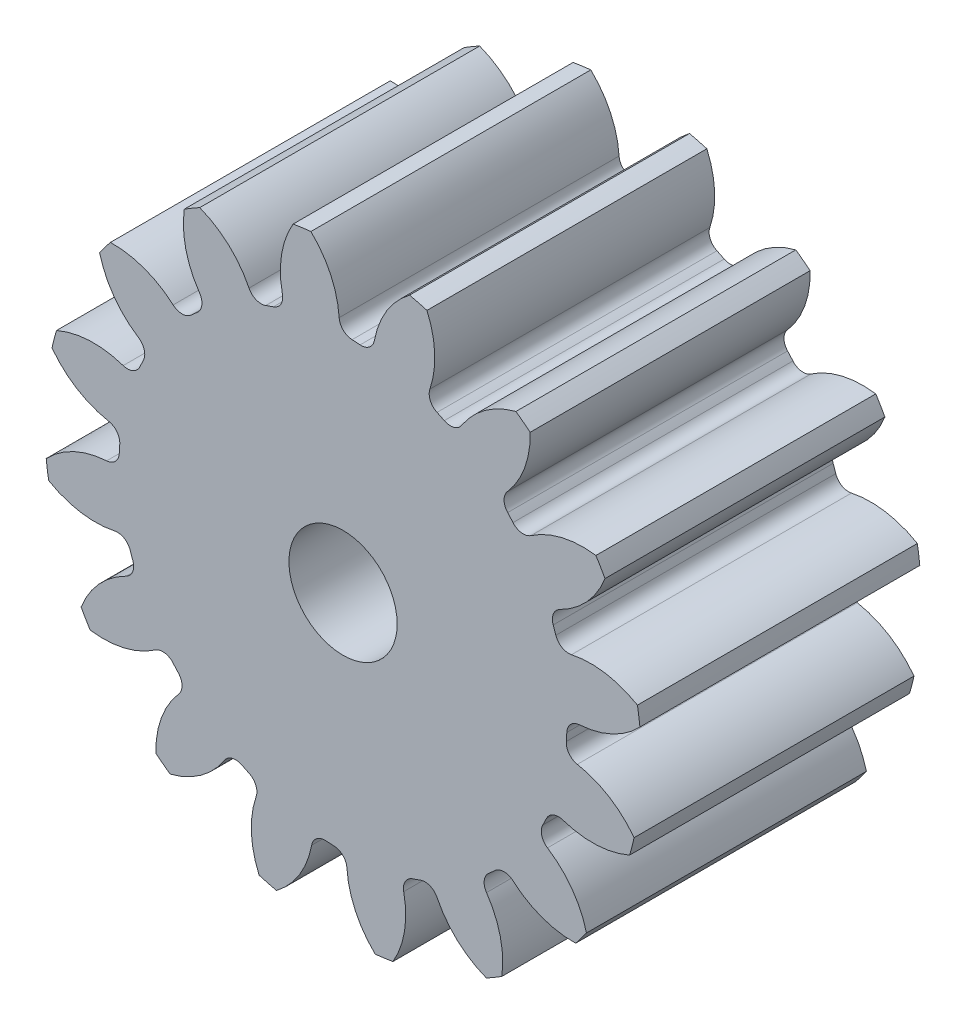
ISO-10303-21;
HEADER;
FILE_DESCRIPTION(('STEP AP214'),'2;1');
FILE_NAME('part.step','',(''),(''),'','','');
FILE_SCHEMA(('AUTOMOTIVE_DESIGN { 1 0 10303 214 1 1 1 1 }'));
ENDSEC;
DATA;
#1=APPLICATION_CONTEXT('core data for automotive mechanical design processes');
#2=APPLICATION_PROTOCOL_DEFINITION('international standard','automotive_design',2000,#1);
#3=PRODUCT_CONTEXT('',#1,'mechanical');
#4=PRODUCT('Part','Part','',(#3));
#5=PRODUCT_RELATED_PRODUCT_CATEGORY('part','',(#4));
#6=PRODUCT_DEFINITION_FORMATION('','',#4);
#7=PRODUCT_DEFINITION_CONTEXT('part definition',#1,'design');
#8=PRODUCT_DEFINITION('design','',#6,#7);
#9=PRODUCT_DEFINITION_SHAPE('','',#8);
#10=(LENGTH_UNIT() NAMED_UNIT(*) SI_UNIT(.MILLI.,.METRE.));
#11=(NAMED_UNIT(*) PLANE_ANGLE_UNIT() SI_UNIT($,.RADIAN.));
#12=(NAMED_UNIT(*) SI_UNIT($,.STERADIAN.) SOLID_ANGLE_UNIT());
#13=UNCERTAINTY_MEASURE_WITH_UNIT(LENGTH_MEASURE(1.E-05),#10,'distance_accuracy_value','');
#14=(GEOMETRIC_REPRESENTATION_CONTEXT(3) GLOBAL_UNCERTAINTY_ASSIGNED_CONTEXT((#13)) GLOBAL_UNIT_ASSIGNED_CONTEXT((#10,
#11,#12)) REPRESENTATION_CONTEXT('',''));
#15=CARTESIAN_POINT('',(0.,0.,0.));
#16=DIRECTION('',(0.,0.,1.));
#17=DIRECTION('',(1.,0.,0.));
#18=AXIS2_PLACEMENT_3D('',#15,#16,#17);
#19=CARTESIAN_POINT('',(0.,0.,95.25));
#20=DIRECTION('',(0.,0.,-1.));
#21=DIRECTION('',(-1.,0.,0.));
#22=AXIS2_PLACEMENT_3D('',#19,#20,#21);
#23=CYLINDRICAL_SURFACE('',#22,101.6);
#24=DIRECTION('',(0.,0.,-1.));
#25=VECTOR('',#24,1.);
#26=CARTESIAN_POINT('',(100.169400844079,16.9897361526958,47.625));
#27=LINE('',#26,#25);
#28=CARTESIAN_POINT('',(100.169400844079,16.9897361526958,95.25));
#29=VERTEX_POINT('',#28);
#30=CARTESIAN_POINT('',(100.169400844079,16.9897361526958,0.));
#31=VERTEX_POINT('',#30);
#32=EDGE_CURVE('E672',#29,#31,#27,.T.);
#33=ORIENTED_EDGE('',*,*,#32,.F.);
#34=CARTESIAN_POINT('',(0.,0.,95.25));
#35=DIRECTION('',(0.,0.,1.));
#36=DIRECTION('',(1.,0.,0.));
#37=AXIS2_PLACEMENT_3D('',#34,#35,#36);
#38=CIRCLE('',#37,101.6);
#39=CARTESIAN_POINT('',(101.009599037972,10.9371340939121,95.25));
#40=VERTEX_POINT('',#39);
#41=EDGE_CURVE('E1241',#40,#29,#38,.T.);
#42=ORIENTED_EDGE('',*,*,#41,.F.);
#43=DIRECTION('',(0.,0.,-1.));
#44=VECTOR('',#43,1.);
#45=CARTESIAN_POINT('',(101.009599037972,10.9371340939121,47.625));
#46=LINE('',#45,#44);
#47=CARTESIAN_POINT('',(101.009599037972,10.9371340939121,0.));
#48=VERTEX_POINT('',#47);
#49=EDGE_CURVE('E1235',#48,#40,#46,.F.);
#50=ORIENTED_EDGE('',*,*,#49,.F.);
#51=CARTESIAN_POINT('',(0.,0.,0.));
#52=DIRECTION('',(0.,0.,1.));
#53=DIRECTION('',(1.,0.,0.));
#54=AXIS2_PLACEMENT_3D('',#51,#52,#53);
#55=CIRCLE('',#54,101.6);
#56=EDGE_CURVE('E1246',#48,#31,#55,.T.);
#57=ORIENTED_EDGE('',*,*,#56,.T.);
#58=EDGE_LOOP('',(#33,#42,#50,#57));
#59=FACE_BOUND('',#58,.T.);
#60=ADVANCED_FACE('F33',(#59),#23,.T.);
#61=DIRECTION('',(0.,0.,-1.));
#62=VECTOR('',#61,1.);
#63=CARTESIAN_POINT('',(89.1352411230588,48.759294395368,47.625));
#64=LINE('',#63,#62);
#65=CARTESIAN_POINT('',(89.1352411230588,48.759294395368,0.));
#66=VERTEX_POINT('',#65);
#67=CARTESIAN_POINT('',(89.1352411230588,48.759294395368,95.25));
#68=VERTEX_POINT('',#67);
#69=EDGE_CURVE('E643',#66,#68,#64,.F.);
#70=ORIENTED_EDGE('',*,*,#69,.F.);
#71=CARTESIAN_POINT('',(86.0427686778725,54.0296396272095,0.));
#72=VERTEX_POINT('',#71);
#73=EDGE_CURVE('E1249',#66,#72,#55,.T.);
#74=ORIENTED_EDGE('',*,*,#73,.T.);
#75=DIRECTION('',(0.,0.,-1.));
#76=VECTOR('',#75,1.);
#77=CARTESIAN_POINT('',(86.0427686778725,54.0296396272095,47.625));
#78=LINE('',#77,#76);
#79=CARTESIAN_POINT('',(86.0427686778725,54.0296396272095,95.25));
#80=VERTEX_POINT('',#79);
#81=EDGE_CURVE('E705',#80,#72,#78,.T.);
#82=ORIENTED_EDGE('',*,*,#81,.F.);
#83=EDGE_CURVE('E1244',#68,#80,#38,.T.);
#84=ORIENTED_EDGE('',*,*,#83,.F.);
#85=EDGE_LOOP('',(#70,#74,#82,#84));
#86=FACE_BOUND('',#85,.T.);
#87=ADVANCED_FACE('F1431',(#86),#23,.T.);
#88=CARTESIAN_POINT('',(0.,0.,95.25));
#89=DIRECTION('',(0.,0.,1.));
#90=DIRECTION('',(1.,0.,0.));
#91=AXIS2_PLACEMENT_3D('',#88,#89,#90);
#92=PLANE('',#91);
#93=CARTESIAN_POINT('',(0.,0.,95.2500000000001));
#94=DIRECTION('',(0.,0.,1.));
#95=DIRECTION('',(1.,0.,0.));
#96=AXIS2_PLACEMENT_3D('',#93,#94,#95);
#97=CIRCLE('',#96,18.415);
#98=CARTESIAN_POINT('',(18.415,0.,95.2499999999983));
#99=VERTEX_POINT('',#98);
#100=EDGE_CURVE('E660',#99,#99,#97,.T.);
#101=ORIENTED_EDGE('',*,*,#100,.F.);
#102=EDGE_LOOP('',(#101));
#103=FACE_BOUND('',#102,.T.);
#104=ORIENTED_EDGE('',*,*,#41,.T.);
#105=CARTESIAN_POINT('',(84.2861736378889,-9.8922009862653,95.25));
#106=DIRECTION('',(0.,0.,-1.));
#107=DIRECTION('',(0.923879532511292,0.382683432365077,0.));
#108=AXIS2_PLACEMENT_3D('',#105,#106,#107);
#109=CIRCLE('',#108,31.2236360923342);
#110=CARTESIAN_POINT('',(77.7483948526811,20.6393056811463,95.25));
#111=VERTEX_POINT('',#110);
#112=EDGE_CURVE('E652',#111,#29,#109,.T.);
#113=ORIENTED_EDGE('',*,*,#112,.F.);
#114=CARTESIAN_POINT('',(76.7863565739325,25.1320361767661,95.25));
#115=DIRECTION('',(0.,0.,1.));
#116=DIRECTION('',(-0.923879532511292,-0.382683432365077,0.));
#117=AXIS2_PLACEMENT_3D('',#114,#115,#116);
#118=CIRCLE('',#117,4.59457777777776);
#119=CARTESIAN_POINT('',(72.419715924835,23.7028425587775,95.25));
#120=VERTEX_POINT('',#119);
#121=EDGE_CURVE('E650',#120,#111,#118,.T.);
#122=ORIENTED_EDGE('',*,*,#121,.F.);
#123=CARTESIAN_POINT('',(0.,0.,95.25));
#124=DIRECTION('',(0.,0.,-1.));
#125=DIRECTION('',(0.923879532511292,0.382683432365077,0.));
#126=AXIS2_PLACEMENT_3D('',#123,#124,#125);
#127=CIRCLE('',#126,76.2);
#128=CARTESIAN_POINT('',(71.5209922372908,26.2904482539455,95.25));
#129=VERTEX_POINT('',#128);
#130=EDGE_CURVE('E635',#129,#120,#127,.T.);
#131=ORIENTED_EDGE('',*,*,#130,.F.);
#132=CARTESIAN_POINT('',(75.8334431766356,27.8756649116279,95.25));
#133=DIRECTION('',(0.,0.,1.));
#134=DIRECTION('',(-0.923879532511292,-0.382683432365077,0.));
#135=AXIS2_PLACEMENT_3D('',#132,#133,#134);
#136=CIRCLE('',#135,4.59457777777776);
#137=CARTESIAN_POINT('',(73.8034866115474,31.9974874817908,95.25));
#138=VERTEX_POINT('',#137);
#139=EDGE_CURVE('E627',#138,#129,#136,.T.);
#140=ORIENTED_EDGE('',*,*,#139,.F.);
#141=CARTESIAN_POINT('',(60.0083941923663,60.0083938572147,95.25));
#142=DIRECTION('',(0.,0.,-1.));
#143=DIRECTION('',(-0.923879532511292,-0.382683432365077,0.));
#144=AXIS2_PLACEMENT_3D('',#141,#142,#143);
#145=CIRCLE('',#144,31.2236360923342);
#146=EDGE_CURVE('E657',#68,#138,#145,.T.);
#147=ORIENTED_EDGE('',*,*,#146,.F.);
#148=ORIENTED_EDGE('',*,*,#83,.T.);
#149=CARTESIAN_POINT('',(81.6558521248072,23.1157202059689,95.25));
#150=DIRECTION('',(0.,0.,-1.));
#151=DIRECTION('',(0.707106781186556,0.707106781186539,0.));
#152=AXIS2_PLACEMENT_3D('',#149,#150,#151);
#153=CIRCLE('',#152,31.2236360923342);
#154=CARTESIAN_POINT('',(63.9318303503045,48.8212546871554,95.25));
#155=VERTEX_POINT('',#154);
#156=EDGE_CURVE('E681',#155,#80,#153,.T.);
#157=ORIENTED_EDGE('',*,*,#156,.F.);
#158=CARTESIAN_POINT('',(61.3237293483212,52.6038403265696,95.25));
#159=DIRECTION('',(0.,0.,1.));
#160=DIRECTION('',(-0.707106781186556,-0.707106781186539,0.));
#161=AXIS2_PLACEMENT_3D('',#158,#159,#160);
#162=CIRCLE('',#161,4.59457777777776);
#163=CARTESIAN_POINT('',(57.8364081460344,49.6123965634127,95.25));
#164=VERTEX_POINT('',#163);
#165=EDGE_CURVE('E679',#164,#155,#162,.T.);
#166=ORIENTED_EDGE('',*,*,#165,.F.);
#167=CARTESIAN_POINT('',(0.,0.,95.25));
#168=DIRECTION('',(0.,0.,-1.));
#169=DIRECTION('',(0.707106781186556,0.707106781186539,0.));
#170=AXIS2_PLACEMENT_3D('',#167,#168,#169);
#171=CIRCLE('',#170,76.2);
#172=CARTESIAN_POINT('',(56.0158618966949,51.6591058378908,95.25));
#173=VERTEX_POINT('',#172);
#174=EDGE_CURVE('E676',#173,#164,#171,.T.);
#175=ORIENTED_EDGE('',*,*,#174,.F.);
#176=CARTESIAN_POINT('',(59.3934109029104,54.773958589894,95.25));
#177=DIRECTION('',(0.,0.,1.));
#178=DIRECTION('',(-0.707106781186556,-0.707106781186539,0.));
#179=AXIS2_PLACEMENT_3D('',#176,#177,#178);
#180=CIRCLE('',#179,4.59457777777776);
#181=CARTESIAN_POINT('',(55.9406223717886,57.8051953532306,95.25));
#182=VERTEX_POINT('',#181);
#183=EDGE_CURVE('E674',#182,#173,#180,.T.);
#184=ORIENTED_EDGE('',*,*,#183,.F.);
#185=CARTESIAN_POINT('',(32.4763090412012,78.4047451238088,95.25));
#186=DIRECTION('',(0.,0.,-1.));
#187=DIRECTION('',(-0.707106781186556,-0.707106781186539,0.));
#188=AXIS2_PLACEMENT_3D('',#185,#186,#187);
#189=CIRCLE('',#188,31.2236360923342);
#190=CARTESIAN_POINT('',(63.690850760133,79.1582941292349,95.25));
#191=VERTEX_POINT('',#190);
#192=EDGE_CURVE('E684',#191,#182,#189,.T.);
#193=ORIENTED_EDGE('',*,*,#192,.F.);
#194=CARTESIAN_POINT('',(58.8169049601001,82.8440202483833,95.25));
#195=VERTEX_POINT('',#194);
#196=EDGE_CURVE('E1289',#191,#195,#38,.T.);
#197=ORIENTED_EDGE('',*,*,#196,.T.);
#198=CARTESIAN_POINT('',(66.5941673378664,52.6044825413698,95.25));
#199=DIRECTION('',(0.,0.,-1.));
#200=DIRECTION('',(0.3826834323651,0.923879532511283,0.));
#201=AXIS2_PLACEMENT_3D('',#198,#199,#200);
#202=CIRCLE('',#201,31.2236360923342);
#203=CARTESIAN_POINT('',(40.3822242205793,69.5706102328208,95.25));
#204=VERTEX_POINT('',#203);
#205=EDGE_CURVE('E716',#204,#195,#202,.T.);
#206=ORIENTED_EDGE('',*,*,#205,.F.);
#207=CARTESIAN_POINT('',(36.5251202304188,72.0671866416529,95.25));
#208=DIRECTION('',(0.,0.,1.));
#209=DIRECTION('',(-0.3826834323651,-0.923879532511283,0.));
#210=AXIS2_PLACEMENT_3D('',#207,#208,#209);
#211=CIRCLE('',#210,4.59457777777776);
#212=CARTESIAN_POINT('',(34.4480315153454,67.968912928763,95.25));
#213=VERTEX_POINT('',#212);
#214=EDGE_CURVE('E714',#213,#204,#211,.T.);
#215=ORIENTED_EDGE('',*,*,#214,.F.);
#216=CARTESIAN_POINT('',(0.,0.,95.25));
#217=DIRECTION('',(0.,0.,-1.));
#218=DIRECTION('',(0.3826834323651,0.923879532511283,0.));
#219=AXIS2_PLACEMENT_3D('',#216,#217,#218);
#220=CIRCLE('',#219,76.2);
#221=CARTESIAN_POINT('',(31.9828243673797,69.1631328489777,95.25));
#222=VERTEX_POINT('',#221);
#223=EDGE_CURVE('E711',#222,#213,#220,.T.);
#224=ORIENTED_EDGE('',*,*,#223,.F.);
#225=CARTESIAN_POINT('',(33.9112702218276,73.3334136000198,95.25));
#226=DIRECTION('',(0.,0.,1.));
#227=DIRECTION('',(-0.3826834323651,-0.923879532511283,0.));
#228=AXIS2_PLACEMENT_3D('',#225,#226,#227);
#229=CIRCLE('',#228,4.59457777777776);
#230=CARTESIAN_POINT('',(29.5613054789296,74.8125862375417,95.25));
#231=VERTEX_POINT('',#230);
#232=EDGE_CURVE('E709',#231,#222,#229,.T.);
#233=ORIENTED_EDGE('',*,*,#232,.F.);
#234=CARTESIAN_POINT('',(2.36987731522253E-07,84.8646846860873,95.25));
#235=DIRECTION('',(0.,0.,-1.));
#236=DIRECTION('',(-0.3826834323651,-0.923879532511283,0.));
#237=AXIS2_PLACEMENT_3D('',#234,#235,#236);
#238=CIRCLE('',#237,31.2236360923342);
#239=CARTESIAN_POINT('',(28.5501057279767,97.5061611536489,95.25));
#240=VERTEX_POINT('',#239);
#241=EDGE_CURVE('E719',#240,#231,#238,.T.);
#242=ORIENTED_EDGE('',*,*,#241,.F.);
#243=CARTESIAN_POINT('',(22.6367006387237,99.0461497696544,95.25));
#244=VERTEX_POINT('',#243);
#245=EDGE_CURVE('E1413',#240,#244,#38,.T.);
#246=ORIENTED_EDGE('',*,*,#245,.T.);
#247=CARTESIAN_POINT('',(41.3941242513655,74.0846892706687,95.25));
#248=DIRECTION('',(0.,0.,-1.));
#249=DIRECTION('',(0.,1.,0.));
#250=AXIS2_PLACEMENT_3D('',#247,#248,#249);
#251=CIRCLE('',#250,31.2236360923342);
#252=CARTESIAN_POINT('',(10.684790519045,79.7284710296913,95.25));
#253=VERTEX_POINT('',#252);
#254=EDGE_CURVE('E754',#253,#244,#251,.T.);
#255=ORIENTED_EDGE('',*,*,#254,.F.);
#256=CARTESIAN_POINT('',(6.16589265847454,80.5589570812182,95.25));
#257=DIRECTION('',(0.,0.,1.));
#258=DIRECTION('',(0.,-1.,0.));
#259=AXIS2_PLACEMENT_3D('',#256,#257,#258);
#260=CIRCLE('',#259,4.59457777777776);
#261=CARTESIAN_POINT('',(5.81525435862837,75.9777784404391,95.25));
#262=VERTEX_POINT('',#261);
#263=EDGE_CURVE('E752',#262,#253,#260,.T.);
#264=ORIENTED_EDGE('',*,*,#263,.F.);
#265=CARTESIAN_POINT('',(0.,0.,95.25));
#266=DIRECTION('',(0.,0.,-1.));
#267=DIRECTION('',(0.,1.,0.));
#268=AXIS2_PLACEMENT_3D('',#265,#266,#267);
#269=CIRCLE('',#268,76.2);
#270=CARTESIAN_POINT('',(3.08069175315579,76.1376998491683,95.25));
#271=VERTEX_POINT('',#270);
#272=EDGE_CURVE('E749',#271,#262,#269,.T.);
#273=ORIENTED_EDGE('',*,*,#272,.F.);
#274=CARTESIAN_POINT('',(3.26644605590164,80.7285211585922,95.25));
#275=DIRECTION('',(0.,0.,1.));
#276=DIRECTION('',(0.,-1.,0.));
#277=AXIS2_PLACEMENT_3D('',#274,#275,#276);
#278=CIRCLE('',#277,4.59457777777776);
#279=CARTESIAN_POINT('',(-1.31845219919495,80.4304390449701,95.25));
#280=VERTEX_POINT('',#279);
#281=EDGE_CURVE('E747',#280,#271,#278,.T.);
#282=ORIENTED_EDGE('',*,*,#281,.F.);
#283=CARTESIAN_POINT('',(-32.4763086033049,78.4047453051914,95.25));
#284=DIRECTION('',(0.,0.,-1.));
#285=DIRECTION('',(0.,-1.,0.));
#286=AXIS2_PLACEMENT_3D('',#283,#284,#285);
#287=CIRCLE('',#286,31.2236360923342);
#288=CARTESIAN_POINT('',(-10.9371340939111,101.009599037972,95.25));
#289=VERTEX_POINT('',#288);
#290=EDGE_CURVE('E757',#289,#280,#287,.T.);
#291=ORIENTED_EDGE('',*,*,#290,.F.);
#292=CARTESIAN_POINT('',(-16.9897361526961,100.169400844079,95.25));
#293=VERTEX_POINT('',#292);
#294=EDGE_CURVE('E1409',#289,#293,#38,.T.);
#295=ORIENTED_EDGE('',*,*,#294,.T.);
#296=CARTESIAN_POINT('',(9.892200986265,84.2861736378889,95.25));
#297=DIRECTION('',(0.,0.,-1.));
#298=DIRECTION('',(-0.382683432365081,0.923879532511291,0.));
#299=AXIS2_PLACEMENT_3D('',#296,#297,#298);
#300=CIRCLE('',#299,31.2236360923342);
#301=CARTESIAN_POINT('',(-20.6393056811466,77.748394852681,95.25));
#302=VERTEX_POINT('',#301);
#303=EDGE_CURVE('E792',#302,#293,#300,.T.);
#304=ORIENTED_EDGE('',*,*,#303,.F.);
#305=CARTESIAN_POINT('',(-25.1320361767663,76.7863565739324,95.25));
#306=DIRECTION('',(0.,0.,1.));
#307=DIRECTION('',(0.382683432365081,-0.923879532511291,0.));
#308=AXIS2_PLACEMENT_3D('',#305,#306,#307);
#309=CIRCLE('',#308,4.59457777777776);
#310=CARTESIAN_POINT('',(-23.7028425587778,72.4197159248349,95.25));
#311=VERTEX_POINT('',#310);
#312=EDGE_CURVE('E790',#311,#302,#309,.T.);
#313=ORIENTED_EDGE('',*,*,#312,.F.);
#314=CARTESIAN_POINT('',(0.,0.,95.25));
#315=DIRECTION('',(0.,0.,-1.));
#316=DIRECTION('',(-0.382683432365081,0.923879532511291,0.));
#317=AXIS2_PLACEMENT_3D('',#314,#315,#316);
#318=CIRCLE('',#317,76.2);
#319=CARTESIAN_POINT('',(-26.2904482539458,71.5209922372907,95.25));
#320=VERTEX_POINT('',#319);
#321=EDGE_CURVE('E787',#320,#311,#318,.T.);
#322=ORIENTED_EDGE('',*,*,#321,.F.);
#323=CARTESIAN_POINT('',(-27.8756649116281,75.8334431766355,95.25));
#324=DIRECTION('',(0.,0.,1.));
#325=DIRECTION('',(0.382683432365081,-0.923879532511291,0.));
#326=AXIS2_PLACEMENT_3D('',#323,#324,#325);
#327=CIRCLE('',#326,4.59457777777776);
#328=CARTESIAN_POINT('',(-31.997487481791,73.8034866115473,95.25));
#329=VERTEX_POINT('',#328);
#330=EDGE_CURVE('E785',#329,#320,#327,.T.);
#331=ORIENTED_EDGE('',*,*,#330,.F.);
#332=CARTESIAN_POINT('',(-60.0083938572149,60.0083941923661,95.25));
#333=DIRECTION('',(0.,0.,-1.));
#334=DIRECTION('',(0.382683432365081,-0.923879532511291,0.));
#335=AXIS2_PLACEMENT_3D('',#332,#333,#334);
#336=CIRCLE('',#335,31.2236360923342);
#337=CARTESIAN_POINT('',(-48.7592943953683,89.1352411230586,95.25));
#338=VERTEX_POINT('',#337);
#339=EDGE_CURVE('E795',#338,#329,#336,.T.);
#340=ORIENTED_EDGE('',*,*,#339,.F.);
#341=CARTESIAN_POINT('',(-54.0296396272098,86.0427686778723,95.25));
#342=VERTEX_POINT('',#341);
#343=EDGE_CURVE('E1405',#338,#342,#38,.T.);
#344=ORIENTED_EDGE('',*,*,#343,.T.);
#345=CARTESIAN_POINT('',(-23.1157202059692,81.6558521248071,95.25));
#346=DIRECTION('',(0.,0.,-1.));
#347=DIRECTION('',(-0.707106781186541,0.707106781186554,0.));
#348=AXIS2_PLACEMENT_3D('',#345,#346,#347);
#349=CIRCLE('',#348,31.2236360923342);
#350=CARTESIAN_POINT('',(-48.8212546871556,63.9318303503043,95.25));
#351=VERTEX_POINT('',#350);
#352=EDGE_CURVE('E830',#351,#342,#349,.T.);
#353=ORIENTED_EDGE('',*,*,#352,.F.);
#354=CARTESIAN_POINT('',(-52.6038403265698,61.323729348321,95.25));
#355=DIRECTION('',(0.,0.,1.));
#356=DIRECTION('',(0.707106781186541,-0.707106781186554,0.));
#357=AXIS2_PLACEMENT_3D('',#354,#355,#356);
#358=CIRCLE('',#357,4.59457777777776);
#359=CARTESIAN_POINT('',(-49.6123965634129,57.8364081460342,95.25));
#360=VERTEX_POINT('',#359);
#361=EDGE_CURVE('E828',#360,#351,#358,.T.);
#362=ORIENTED_EDGE('',*,*,#361,.F.);
#363=CARTESIAN_POINT('',(0.,0.,95.25));
#364=DIRECTION('',(0.,0.,-1.));
#365=DIRECTION('',(-0.707106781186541,0.707106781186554,0.));
#366=AXIS2_PLACEMENT_3D('',#363,#364,#365);
#367=CIRCLE('',#366,76.2);
#368=CARTESIAN_POINT('',(-51.659105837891,56.0158618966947,95.25));
#369=VERTEX_POINT('',#368);
#370=EDGE_CURVE('E825',#369,#360,#367,.T.);
#371=ORIENTED_EDGE('',*,*,#370,.F.);
#372=CARTESIAN_POINT('',(-54.7739585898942,59.3934109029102,95.25));
#373=DIRECTION('',(0.,0.,1.));
#374=DIRECTION('',(0.707106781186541,-0.707106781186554,0.));
#375=AXIS2_PLACEMENT_3D('',#372,#373,#374);
#376=CIRCLE('',#375,4.59457777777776);
#377=CARTESIAN_POINT('',(-57.8051953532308,55.9406223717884,95.25));
#378=VERTEX_POINT('',#377);
#379=EDGE_CURVE('E823',#378,#369,#376,.T.);
#380=ORIENTED_EDGE('',*,*,#379,.F.);
#381=CARTESIAN_POINT('',(-78.4047451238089,32.4763090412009,95.25));
#382=DIRECTION('',(0.,0.,-1.));
#383=DIRECTION('',(0.707106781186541,-0.707106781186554,0.));
#384=AXIS2_PLACEMENT_3D('',#381,#382,#383);
#385=CIRCLE('',#384,31.2236360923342);
#386=CARTESIAN_POINT('',(-79.1582941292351,63.6908507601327,95.25));
#387=VERTEX_POINT('',#386);
#388=EDGE_CURVE('E833',#387,#378,#385,.T.);
#389=ORIENTED_EDGE('',*,*,#388,.F.);
#390=CARTESIAN_POINT('',(-82.8440202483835,58.8169049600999,95.25));
#391=VERTEX_POINT('',#390);
#392=EDGE_CURVE('E1401',#387,#391,#38,.T.);
#393=ORIENTED_EDGE('',*,*,#392,.T.);
#394=CARTESIAN_POINT('',(-52.60448254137,66.5941673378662,95.25));
#395=DIRECTION('',(0.,0.,-1.));
#396=DIRECTION('',(-0.923879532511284,0.382683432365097,0.));
#397=AXIS2_PLACEMENT_3D('',#394,#395,#396);
#398=CIRCLE('',#397,31.2236360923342);
#399=CARTESIAN_POINT('',(-69.5706102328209,40.3822242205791,95.25));
#400=VERTEX_POINT('',#399);
#401=EDGE_CURVE('E868',#400,#391,#398,.T.);
#402=ORIENTED_EDGE('',*,*,#401,.F.);
#403=CARTESIAN_POINT('',(-72.067186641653,36.5251202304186,95.25));
#404=DIRECTION('',(0.,0.,1.));
#405=DIRECTION('',(0.923879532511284,-0.382683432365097,0.));
#406=AXIS2_PLACEMENT_3D('',#403,#404,#405);
#407=CIRCLE('',#406,4.59457777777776);
#408=CARTESIAN_POINT('',(-67.9689129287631,34.4480315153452,95.25));
#409=VERTEX_POINT('',#408);
#410=EDGE_CURVE('E866',#409,#400,#407,.T.);
#411=ORIENTED_EDGE('',*,*,#410,.F.);
#412=CARTESIAN_POINT('',(0.,0.,95.25));
#413=DIRECTION('',(0.,0.,-1.));
#414=DIRECTION('',(-0.923879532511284,0.382683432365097,0.));
#415=AXIS2_PLACEMENT_3D('',#412,#413,#414);
#416=CIRCLE('',#415,76.2);
#417=CARTESIAN_POINT('',(-69.1631328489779,31.9828243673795,95.25));
#418=VERTEX_POINT('',#417);
#419=EDGE_CURVE('E863',#418,#409,#416,.T.);
#420=ORIENTED_EDGE('',*,*,#419,.F.);
#421=CARTESIAN_POINT('',(-73.3334136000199,33.9112702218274,95.25));
#422=DIRECTION('',(0.,0.,1.));
#423=DIRECTION('',(0.923879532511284,-0.382683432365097,0.));
#424=AXIS2_PLACEMENT_3D('',#421,#422,#423);
#425=CIRCLE('',#424,4.59457777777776);
#426=CARTESIAN_POINT('',(-74.8125862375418,29.5613054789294,95.25));
#427=VERTEX_POINT('',#426);
#428=EDGE_CURVE('E861',#427,#418,#425,.T.);
#429=ORIENTED_EDGE('',*,*,#428,.F.);
#430=CARTESIAN_POINT('',(-84.8646846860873,2.36987478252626E-07,95.25));
#431=DIRECTION('',(0.,0.,-1.));
#432=DIRECTION('',(0.923879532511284,-0.382683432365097,0.));
#433=AXIS2_PLACEMENT_3D('',#430,#431,#432);
#434=CIRCLE('',#433,31.2236360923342);
#435=CARTESIAN_POINT('',(-97.506161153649,28.5501057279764,95.25));
#436=VERTEX_POINT('',#435);
#437=EDGE_CURVE('E871',#436,#427,#434,.T.);
#438=ORIENTED_EDGE('',*,*,#437,.F.);
#439=CARTESIAN_POINT('',(-99.0461497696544,22.6367006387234,95.25));
#440=VERTEX_POINT('',#439);
#441=EDGE_CURVE('E1397',#436,#440,#38,.T.);
#442=ORIENTED_EDGE('',*,*,#441,.T.);
#443=CARTESIAN_POINT('',(-74.0846892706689,41.3941242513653,95.25));
#444=DIRECTION('',(0.,0.,-1.));
#445=DIRECTION('',(-1.,0.,0.));
#446=AXIS2_PLACEMENT_3D('',#443,#444,#445);
#447=CIRCLE('',#446,31.2236360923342);
#448=CARTESIAN_POINT('',(-79.7284710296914,10.6847905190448,95.25));
#449=VERTEX_POINT('',#448);
#450=EDGE_CURVE('E906',#449,#440,#447,.T.);
#451=ORIENTED_EDGE('',*,*,#450,.F.);
#452=CARTESIAN_POINT('',(-80.5589570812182,6.16589265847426,95.25));
#453=DIRECTION('',(0.,0.,1.));
#454=DIRECTION('',(1.,0.,0.));
#455=AXIS2_PLACEMENT_3D('',#452,#453,#454);
#456=CIRCLE('',#455,4.59457777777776);
#457=CARTESIAN_POINT('',(-75.9777784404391,5.8152543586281,95.25));
#458=VERTEX_POINT('',#457);
#459=EDGE_CURVE('E904',#458,#449,#456,.T.);
#460=ORIENTED_EDGE('',*,*,#459,.F.);
#461=CARTESIAN_POINT('',(0.,0.,95.25));
#462=DIRECTION('',(0.,0.,-1.));
#463=DIRECTION('',(-1.,0.,0.));
#464=AXIS2_PLACEMENT_3D('',#461,#462,#463);
#465=CIRCLE('',#464,76.2);
#466=CARTESIAN_POINT('',(-76.1376998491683,3.08069175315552,95.25));
#467=VERTEX_POINT('',#466);
#468=EDGE_CURVE('E901',#467,#458,#465,.T.);
#469=ORIENTED_EDGE('',*,*,#468,.F.);
#470=CARTESIAN_POINT('',(-80.7285211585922,3.26644605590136,95.25));
#471=DIRECTION('',(0.,0.,1.));
#472=DIRECTION('',(1.,0.,0.));
#473=AXIS2_PLACEMENT_3D('',#470,#471,#472);
#474=CIRCLE('',#473,4.59457777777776);
#475=CARTESIAN_POINT('',(-80.4304390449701,-1.31845219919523,95.25));
#476=VERTEX_POINT('',#475);
#477=EDGE_CURVE('E899',#476,#467,#474,.T.);
#478=ORIENTED_EDGE('',*,*,#477,.F.);
#479=CARTESIAN_POINT('',(-78.4047453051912,-32.4763086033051,95.25));
#480=DIRECTION('',(0.,0.,-1.));
#481=DIRECTION('',(1.,0.,0.));
#482=AXIS2_PLACEMENT_3D('',#479,#480,#481);
#483=CIRCLE('',#482,31.2236360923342);
#484=CARTESIAN_POINT('',(-101.009599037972,-10.9371340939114,95.25));
#485=VERTEX_POINT('',#484);
#486=EDGE_CURVE('E909',#485,#476,#483,.T.);
#487=ORIENTED_EDGE('',*,*,#486,.F.);
#488=CARTESIAN_POINT('',(-100.169400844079,-16.9897361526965,95.25));
#489=VERTEX_POINT('',#488);
#490=EDGE_CURVE('E1393',#485,#489,#38,.T.);
#491=ORIENTED_EDGE('',*,*,#490,.T.);
#492=CARTESIAN_POINT('',(-84.286173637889,9.89220098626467,95.25));
#493=DIRECTION('',(0.,0.,-1.));
#494=DIRECTION('',(-0.923879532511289,-0.382683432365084,0.));
#495=AXIS2_PLACEMENT_3D('',#492,#493,#494);
#496=CIRCLE('',#495,31.2236360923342);
#497=CARTESIAN_POINT('',(-77.7483948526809,-20.6393056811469,95.25));
#498=VERTEX_POINT('',#497);
#499=EDGE_CURVE('E944',#498,#489,#496,.T.);
#500=ORIENTED_EDGE('',*,*,#499,.F.);
#501=CARTESIAN_POINT('',(-76.7863565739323,-25.1320361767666,95.25));
#502=DIRECTION('',(0.,0.,1.));
#503=DIRECTION('',(0.923879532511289,0.382683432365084,0.));
#504=AXIS2_PLACEMENT_3D('',#501,#502,#503);
#505=CIRCLE('',#504,4.59457777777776);
#506=CARTESIAN_POINT('',(-72.4197159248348,-23.7028425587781,95.25));
#507=VERTEX_POINT('',#506);
#508=EDGE_CURVE('E942',#507,#498,#505,.T.);
#509=ORIENTED_EDGE('',*,*,#508,.F.);
#510=CARTESIAN_POINT('',(0.,0.,95.25));
#511=DIRECTION('',(0.,0.,-1.));
#512=DIRECTION('',(-0.923879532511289,-0.382683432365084,0.));
#513=AXIS2_PLACEMENT_3D('',#510,#511,#512);
#514=CIRCLE('',#513,76.2);
#515=CARTESIAN_POINT('',(-71.5209922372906,-26.2904482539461,95.25));
#516=VERTEX_POINT('',#515);
#517=EDGE_CURVE('E939',#516,#507,#514,.T.);
#518=ORIENTED_EDGE('',*,*,#517,.F.);
#519=CARTESIAN_POINT('',(-75.8334431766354,-27.8756649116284,95.25));
#520=DIRECTION('',(0.,0.,1.));
#521=DIRECTION('',(0.923879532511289,0.382683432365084,0.));
#522=AXIS2_PLACEMENT_3D('',#519,#520,#521);
#523=CIRCLE('',#522,4.59457777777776);
#524=CARTESIAN_POINT('',(-73.8034866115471,-31.9974874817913,95.25));
#525=VERTEX_POINT('',#524);
#526=EDGE_CURVE('E937',#525,#516,#523,.T.);
#527=ORIENTED_EDGE('',*,*,#526,.F.);
#528=CARTESIAN_POINT('',(-60.0083941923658,-60.0083938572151,95.25));
#529=DIRECTION('',(0.,0.,-1.));
#530=DIRECTION('',(0.923879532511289,0.382683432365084,0.));
#531=AXIS2_PLACEMENT_3D('',#528,#529,#530);
#532=CIRCLE('',#531,31.2236360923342);
#533=CARTESIAN_POINT('',(-89.1352411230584,-48.7592943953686,95.25));
#534=VERTEX_POINT('',#533);
#535=EDGE_CURVE('E947',#534,#525,#532,.T.);
#536=ORIENTED_EDGE('',*,*,#535,.F.);
#537=CARTESIAN_POINT('',(-86.0427686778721,-54.0296396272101,95.25));
#538=VERTEX_POINT('',#537);
#539=EDGE_CURVE('E1389',#534,#538,#38,.T.);
#540=ORIENTED_EDGE('',*,*,#539,.T.);
#541=CARTESIAN_POINT('',(-81.6558521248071,-23.1157202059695,95.25));
#542=DIRECTION('',(0.,0.,-1.));
#543=DIRECTION('',(-0.707106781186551,-0.707106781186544,0.));
#544=AXIS2_PLACEMENT_3D('',#541,#542,#543);
#545=CIRCLE('',#544,31.2236360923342);
#546=CARTESIAN_POINT('',(-63.9318303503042,-48.8212546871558,95.25));
#547=VERTEX_POINT('',#546);
#548=EDGE_CURVE('E982',#547,#538,#545,.T.);
#549=ORIENTED_EDGE('',*,*,#548,.F.);
#550=CARTESIAN_POINT('',(-61.3237293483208,-52.60384032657,95.25));
#551=DIRECTION('',(0.,0.,1.));
#552=DIRECTION('',(0.707106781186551,0.707106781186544,0.));
#553=AXIS2_PLACEMENT_3D('',#550,#551,#552);
#554=CIRCLE('',#553,4.59457777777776);
#555=CARTESIAN_POINT('',(-57.836408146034,-49.6123965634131,95.25));
#556=VERTEX_POINT('',#555);
#557=EDGE_CURVE('E980',#556,#547,#554,.T.);
#558=ORIENTED_EDGE('',*,*,#557,.F.);
#559=CARTESIAN_POINT('',(0.,0.,95.25));
#560=DIRECTION('',(0.,0.,-1.));
#561=DIRECTION('',(-0.707106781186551,-0.707106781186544,0.));
#562=AXIS2_PLACEMENT_3D('',#559,#560,#561);
#563=CIRCLE('',#562,76.2);
#564=CARTESIAN_POINT('',(-56.0158618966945,-51.6591058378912,95.25));
#565=VERTEX_POINT('',#564);
#566=EDGE_CURVE('E977',#565,#556,#563,.T.);
#567=ORIENTED_EDGE('',*,*,#566,.F.);
#568=CARTESIAN_POINT('',(-59.39341090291,-54.7739585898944,95.25));
#569=DIRECTION('',(0.,0.,1.));
#570=DIRECTION('',(0.707106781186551,0.707106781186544,0.));
#571=AXIS2_PLACEMENT_3D('',#568,#569,#570);
#572=CIRCLE('',#571,4.59457777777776);
#573=CARTESIAN_POINT('',(-55.9406223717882,-57.805195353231,95.25));
#574=VERTEX_POINT('',#573);
#575=EDGE_CURVE('E975',#574,#565,#572,.T.);
#576=ORIENTED_EDGE('',*,*,#575,.F.);
#577=CARTESIAN_POINT('',(-32.4763090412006,-78.404745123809,95.25));
#578=DIRECTION('',(0.,0.,-1.));
#579=DIRECTION('',(0.707106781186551,0.707106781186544,0.));
#580=AXIS2_PLACEMENT_3D('',#577,#578,#579);
#581=CIRCLE('',#580,31.2236360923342);
#582=CARTESIAN_POINT('',(-63.6908507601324,-79.1582941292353,95.25));
#583=VERTEX_POINT('',#582);
#584=EDGE_CURVE('E985',#583,#574,#581,.T.);
#585=ORIENTED_EDGE('',*,*,#584,.F.);
#586=CARTESIAN_POINT('',(-58.8169049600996,-82.8440202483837,95.25));
#587=VERTEX_POINT('',#586);
#588=EDGE_CURVE('E1385',#583,#587,#38,.T.);
#589=ORIENTED_EDGE('',*,*,#588,.T.);
#590=CARTESIAN_POINT('',(-66.594167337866,-52.6044825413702,95.25));
#591=DIRECTION('',(0.,0.,-1.));
#592=DIRECTION('',(-0.382683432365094,-0.923879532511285,0.));
#593=AXIS2_PLACEMENT_3D('',#590,#591,#592);
#594=CIRCLE('',#593,31.2236360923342);
#595=CARTESIAN_POINT('',(-40.3822242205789,-69.570610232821,95.25));
#596=VERTEX_POINT('',#595);
#597=EDGE_CURVE('E1020',#596,#587,#594,.T.);
#598=ORIENTED_EDGE('',*,*,#597,.F.);
#599=CARTESIAN_POINT('',(-36.5251202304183,-72.0671866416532,95.25));
#600=DIRECTION('',(0.,0.,1.));
#601=DIRECTION('',(0.382683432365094,0.923879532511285,0.));
#602=AXIS2_PLACEMENT_3D('',#599,#600,#601);
#603=CIRCLE('',#602,4.59457777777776);
#604=CARTESIAN_POINT('',(-34.4480315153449,-67.9689129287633,95.25));
#605=VERTEX_POINT('',#604);
#606=EDGE_CURVE('E1018',#605,#596,#603,.T.);
#607=ORIENTED_EDGE('',*,*,#606,.F.);
#608=CARTESIAN_POINT('',(0.,0.,95.25));
#609=DIRECTION('',(0.,0.,-1.));
#610=DIRECTION('',(-0.382683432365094,-0.923879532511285,0.));
#611=AXIS2_PLACEMENT_3D('',#608,#609,#610);
#612=CIRCLE('',#611,76.2);
#613=CARTESIAN_POINT('',(-31.9828243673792,-69.163132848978,95.25));
#614=VERTEX_POINT('',#613);
#615=EDGE_CURVE('E1015',#614,#605,#612,.T.);
#616=ORIENTED_EDGE('',*,*,#615,.F.);
#617=CARTESIAN_POINT('',(-33.9112702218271,-73.33341360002,95.25));
#618=DIRECTION('',(0.,0.,1.));
#619=DIRECTION('',(0.382683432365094,0.923879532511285,0.));
#620=AXIS2_PLACEMENT_3D('',#617,#618,#619);
#621=CIRCLE('',#620,4.59457777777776);
#622=CARTESIAN_POINT('',(-29.5613054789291,-74.8125862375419,95.25));
#623=VERTEX_POINT('',#622);
#624=EDGE_CURVE('E1013',#623,#614,#621,.T.);
#625=ORIENTED_EDGE('',*,*,#624,.F.);
#626=CARTESIAN_POINT('',(-2.36987179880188E-07,-84.8646846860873,95.25));
#627=DIRECTION('',(0.,0.,-1.));
#628=DIRECTION('',(0.382683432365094,0.923879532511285,0.));
#629=AXIS2_PLACEMENT_3D('',#626,#627,#628);
#630=CIRCLE('',#629,31.2236360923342);
#631=CARTESIAN_POINT('',(-28.5501057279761,-97.5061611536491,95.25));
#632=VERTEX_POINT('',#631);
#633=EDGE_CURVE('E1023',#632,#623,#630,.T.);
#634=ORIENTED_EDGE('',*,*,#633,.F.);
#635=CARTESIAN_POINT('',(-22.636700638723,-99.0461497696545,95.25));
#636=VERTEX_POINT('',#635);
#637=EDGE_CURVE('E1381',#632,#636,#38,.T.);
#638=ORIENTED_EDGE('',*,*,#637,.T.);
#639=CARTESIAN_POINT('',(-41.394124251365,-74.084689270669,95.25));
#640=DIRECTION('',(0.,0.,-1.));
#641=DIRECTION('',(0.,-1.,0.));
#642=AXIS2_PLACEMENT_3D('',#639,#640,#641);
#643=CIRCLE('',#642,31.2236360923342);
#644=CARTESIAN_POINT('',(-10.6847905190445,-79.7284710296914,95.25));
#645=VERTEX_POINT('',#644);
#646=EDGE_CURVE('E1058',#645,#636,#643,.T.);
#647=ORIENTED_EDGE('',*,*,#646,.F.);
#648=CARTESIAN_POINT('',(-6.16589265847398,-80.5589570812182,95.25));
#649=DIRECTION('',(0.,0.,1.));
#650=DIRECTION('',(0.,1.,0.));
#651=AXIS2_PLACEMENT_3D('',#648,#649,#650);
#652=CIRCLE('',#651,4.59457777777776);
#653=CARTESIAN_POINT('',(-5.81525435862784,-75.9777784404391,95.25));
#654=VERTEX_POINT('',#653);
#655=EDGE_CURVE('E1056',#654,#645,#652,.T.);
#656=ORIENTED_EDGE('',*,*,#655,.F.);
#657=CARTESIAN_POINT('',(0.,0.,95.25));
#658=DIRECTION('',(0.,0.,-1.));
#659=DIRECTION('',(0.,-1.,0.));
#660=AXIS2_PLACEMENT_3D('',#657,#658,#659);
#661=CIRCLE('',#660,76.2);
#662=CARTESIAN_POINT('',(-3.08069175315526,-76.1376998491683,95.25));
#663=VERTEX_POINT('',#662);
#664=EDGE_CURVE('E1053',#663,#654,#661,.T.);
#665=ORIENTED_EDGE('',*,*,#664,.F.);
#666=CARTESIAN_POINT('',(-3.26644605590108,-80.7285211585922,95.25));
#667=DIRECTION('',(0.,0.,1.));
#668=DIRECTION('',(0.,1.,0.));
#669=AXIS2_PLACEMENT_3D('',#666,#667,#668);
#670=CIRCLE('',#669,4.59457777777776);
#671=CARTESIAN_POINT('',(1.31845219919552,-80.4304390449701,95.25));
#672=VERTEX_POINT('',#671);
#673=EDGE_CURVE('E1051',#672,#663,#670,.T.);
#674=ORIENTED_EDGE('',*,*,#673,.F.);
#675=CARTESIAN_POINT('',(32.4763086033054,-78.4047453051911,95.25));
#676=DIRECTION('',(0.,0.,-1.));
#677=DIRECTION('',(0.,1.,0.));
#678=AXIS2_PLACEMENT_3D('',#675,#676,#677);
#679=CIRCLE('',#678,31.2236360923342);
#680=CARTESIAN_POINT('',(10.9371340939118,-101.009599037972,95.25));
#681=VERTEX_POINT('',#680);
#682=EDGE_CURVE('E1061',#681,#672,#679,.T.);
#683=ORIENTED_EDGE('',*,*,#682,.F.);
#684=CARTESIAN_POINT('',(16.9897361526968,-100.169400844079,95.25));
#685=VERTEX_POINT('',#684);
#686=EDGE_CURVE('E1377',#681,#685,#38,.T.);
#687=ORIENTED_EDGE('',*,*,#686,.T.);
#688=CARTESIAN_POINT('',(-9.89220098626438,-84.286173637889,95.25));
#689=DIRECTION('',(0.,0.,-1.));
#690=DIRECTION('',(0.382683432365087,-0.923879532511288,0.));
#691=AXIS2_PLACEMENT_3D('',#688,#689,#690);
#692=CIRCLE('',#691,31.2236360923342);
#693=CARTESIAN_POINT('',(20.6393056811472,-77.7483948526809,95.25));
#694=VERTEX_POINT('',#693);
#695=EDGE_CURVE('E1096',#694,#685,#692,.T.);
#696=ORIENTED_EDGE('',*,*,#695,.F.);
#697=CARTESIAN_POINT('',(25.1320361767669,-76.7863565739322,95.25));
#698=DIRECTION('',(0.,0.,1.));
#699=DIRECTION('',(-0.382683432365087,0.923879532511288,0.));
#700=AXIS2_PLACEMENT_3D('',#697,#698,#699);
#701=CIRCLE('',#700,4.59457777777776);
#702=CARTESIAN_POINT('',(23.7028425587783,-72.4197159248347,95.25));
#703=VERTEX_POINT('',#702);
#704=EDGE_CURVE('E1094',#703,#694,#701,.T.);
#705=ORIENTED_EDGE('',*,*,#704,.F.);
#706=CARTESIAN_POINT('',(0.,0.,95.25));
#707=DIRECTION('',(0.,0.,-1.));
#708=DIRECTION('',(0.382683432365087,-0.923879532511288,0.));
#709=AXIS2_PLACEMENT_3D('',#706,#707,#708);
#710=CIRCLE('',#709,76.2);
#711=CARTESIAN_POINT('',(26.2904482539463,-71.5209922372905,95.25));
#712=VERTEX_POINT('',#711);
#713=EDGE_CURVE('E1091',#712,#703,#710,.T.);
#714=ORIENTED_EDGE('',*,*,#713,.F.);
#715=CARTESIAN_POINT('',(27.8756649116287,-75.8334431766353,95.25));
#716=DIRECTION('',(0.,0.,1.));
#717=DIRECTION('',(-0.382683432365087,0.923879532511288,0.));
#718=AXIS2_PLACEMENT_3D('',#715,#716,#717);
#719=CIRCLE('',#718,4.59457777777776);
#720=CARTESIAN_POINT('',(31.9974874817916,-73.803486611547,95.25));
#721=VERTEX_POINT('',#720);
#722=EDGE_CURVE('E1089',#721,#712,#719,.T.);
#723=ORIENTED_EDGE('',*,*,#722,.F.);
#724=CARTESIAN_POINT('',(60.0083938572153,-60.0083941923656,95.25));
#725=DIRECTION('',(0.,0.,-1.));
#726=DIRECTION('',(-0.382683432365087,0.923879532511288,0.));
#727=AXIS2_PLACEMENT_3D('',#724,#725,#726);
#728=CIRCLE('',#727,31.2236360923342);
#729=CARTESIAN_POINT('',(48.759294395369,-89.1352411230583,95.25));
#730=VERTEX_POINT('',#729);
#731=EDGE_CURVE('E1099',#730,#721,#728,.T.);
#732=ORIENTED_EDGE('',*,*,#731,.F.);
#733=CARTESIAN_POINT('',(54.0296396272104,-86.0427686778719,95.25));
#734=VERTEX_POINT('',#733);
#735=EDGE_CURVE('E1373',#730,#734,#38,.T.);
#736=ORIENTED_EDGE('',*,*,#735,.T.);
#737=CARTESIAN_POINT('',(23.1157202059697,-81.655852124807,95.25));
#738=DIRECTION('',(0.,0.,-1.));
#739=DIRECTION('',(0.707106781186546,-0.707106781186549,0.));
#740=AXIS2_PLACEMENT_3D('',#737,#738,#739);
#741=CIRCLE('',#740,31.2236360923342);
#742=CARTESIAN_POINT('',(48.821254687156,-63.931830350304,95.25));
#743=VERTEX_POINT('',#742);
#744=EDGE_CURVE('E1134',#743,#734,#741,.T.);
#745=ORIENTED_EDGE('',*,*,#744,.F.);
#746=CARTESIAN_POINT('',(52.6038403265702,-61.3237293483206,95.25));
#747=DIRECTION('',(0.,0.,1.));
#748=DIRECTION('',(-0.707106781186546,0.707106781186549,0.));
#749=AXIS2_PLACEMENT_3D('',#746,#747,#748);
#750=CIRCLE('',#749,4.59457777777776);
#751=CARTESIAN_POINT('',(49.6123965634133,-57.8364081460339,95.25));
#752=VERTEX_POINT('',#751);
#753=EDGE_CURVE('E1132',#752,#743,#750,.T.);
#754=ORIENTED_EDGE('',*,*,#753,.F.);
#755=CARTESIAN_POINT('',(0.,0.,95.25));
#756=DIRECTION('',(0.,0.,-1.));
#757=DIRECTION('',(0.707106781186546,-0.707106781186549,0.));
#758=AXIS2_PLACEMENT_3D('',#755,#756,#757);
#759=CIRCLE('',#758,76.2);
#760=CARTESIAN_POINT('',(51.6591058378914,-56.0158618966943,95.25));
#761=VERTEX_POINT('',#760);
#762=EDGE_CURVE('E1129',#761,#752,#759,.T.);
#763=ORIENTED_EDGE('',*,*,#762,.F.);
#764=CARTESIAN_POINT('',(54.7739585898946,-59.3934109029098,95.25));
#765=DIRECTION('',(0.,0.,1.));
#766=DIRECTION('',(-0.707106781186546,0.707106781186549,0.));
#767=AXIS2_PLACEMENT_3D('',#764,#765,#766);
#768=CIRCLE('',#767,4.59457777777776);
#769=CARTESIAN_POINT('',(57.8051953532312,-55.940622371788,95.25));
#770=VERTEX_POINT('',#769);
#771=EDGE_CURVE('E1127',#770,#761,#768,.T.);
#772=ORIENTED_EDGE('',*,*,#771,.F.);
#773=CARTESIAN_POINT('',(78.4047451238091,-32.4763090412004,95.25));
#774=DIRECTION('',(0.,0.,-1.));
#775=DIRECTION('',(-0.707106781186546,0.707106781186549,0.));
#776=AXIS2_PLACEMENT_3D('',#773,#774,#775);
#777=CIRCLE('',#776,31.2236360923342);
#778=CARTESIAN_POINT('',(79.1582941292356,-63.6908507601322,95.25));
#779=VERTEX_POINT('',#778);
#780=EDGE_CURVE('E1137',#779,#770,#777,.T.);
#781=ORIENTED_EDGE('',*,*,#780,.F.);
#782=CARTESIAN_POINT('',(82.8440202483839,-58.8169049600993,95.25));
#783=VERTEX_POINT('',#782);
#784=EDGE_CURVE('E1372',#779,#783,#38,.T.);
#785=ORIENTED_EDGE('',*,*,#784,.T.);
#786=CARTESIAN_POINT('',(52.6044825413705,-66.5941673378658,95.25));
#787=DIRECTION('',(0.,0.,-1.));
#788=DIRECTION('',(0.923879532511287,-0.382683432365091,0.));
#789=AXIS2_PLACEMENT_3D('',#786,#787,#788);
#790=CIRCLE('',#789,31.2236360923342);
#791=CARTESIAN_POINT('',(69.5706102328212,-40.3822242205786,95.25));
#792=VERTEX_POINT('',#791);
#793=EDGE_CURVE('E1172',#792,#783,#790,.T.);
#794=ORIENTED_EDGE('',*,*,#793,.F.);
#795=CARTESIAN_POINT('',(72.0671866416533,-36.5251202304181,95.25));
#796=DIRECTION('',(0.,0.,1.));
#797=DIRECTION('',(-0.923879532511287,0.382683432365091,0.));
#798=AXIS2_PLACEMENT_3D('',#795,#796,#797);
#799=CIRCLE('',#798,4.59457777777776);
#800=CARTESIAN_POINT('',(67.9689129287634,-34.4480315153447,95.25));
#801=VERTEX_POINT('',#800);
#802=EDGE_CURVE('E1170',#801,#792,#799,.T.);
#803=ORIENTED_EDGE('',*,*,#802,.F.);
#804=CARTESIAN_POINT('',(0.,0.,95.25));
#805=DIRECTION('',(0.,0.,-1.));
#806=DIRECTION('',(0.923879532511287,-0.382683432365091,0.));
#807=AXIS2_PLACEMENT_3D('',#804,#805,#806);
#808=CIRCLE('',#807,76.2);
#809=CARTESIAN_POINT('',(69.1631328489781,-31.982824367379,95.25));
#810=VERTEX_POINT('',#809);
#811=EDGE_CURVE('E1167',#810,#801,#808,.T.);
#812=ORIENTED_EDGE('',*,*,#811,.F.);
#813=CARTESIAN_POINT('',(73.3334136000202,-33.9112702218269,95.25));
#814=DIRECTION('',(0.,0.,1.));
#815=DIRECTION('',(-0.923879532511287,0.382683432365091,0.));
#816=AXIS2_PLACEMENT_3D('',#813,#814,#815);
#817=CIRCLE('',#816,4.59457777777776);
#818=CARTESIAN_POINT('',(74.812586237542,-29.5613054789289,95.25));
#819=VERTEX_POINT('',#818);
#820=EDGE_CURVE('E1165',#819,#810,#817,.T.);
#821=ORIENTED_EDGE('',*,*,#820,.F.);
#822=CARTESIAN_POINT('',(84.8646846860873,-2.36986884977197E-07,95.25));
#823=DIRECTION('',(0.,0.,-1.));
#824=DIRECTION('',(-0.923879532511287,0.382683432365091,0.));
#825=AXIS2_PLACEMENT_3D('',#822,#823,#824);
#826=CIRCLE('',#825,31.2236360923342);
#827=CARTESIAN_POINT('',(97.5061611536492,-28.5501057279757,95.25));
#828=VERTEX_POINT('',#827);
#829=EDGE_CURVE('E1175',#828,#819,#826,.T.);
#830=ORIENTED_EDGE('',*,*,#829,.F.);
#831=CARTESIAN_POINT('',(99.0461497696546,-22.6367006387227,95.25));
#832=VERTEX_POINT('',#831);
#833=EDGE_CURVE('E1245',#828,#832,#38,.T.);
#834=ORIENTED_EDGE('',*,*,#833,.T.);
#835=CARTESIAN_POINT('',(74.0846892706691,-41.3941242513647,95.25));
#836=DIRECTION('',(0.,0.,-1.));
#837=DIRECTION('',(1.,0.,0.));
#838=AXIS2_PLACEMENT_3D('',#835,#836,#837);
#839=CIRCLE('',#838,31.2236360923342);
#840=CARTESIAN_POINT('',(79.7284710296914,-10.6847905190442,95.25));
#841=VERTEX_POINT('',#840);
#842=EDGE_CURVE('E1210',#841,#832,#839,.T.);
#843=ORIENTED_EDGE('',*,*,#842,.F.);
#844=CARTESIAN_POINT('',(80.5589570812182,-6.1658926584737,95.25));
#845=DIRECTION('',(0.,0.,1.));
#846=DIRECTION('',(-1.,0.,0.));
#847=AXIS2_PLACEMENT_3D('',#844,#845,#846);
#848=CIRCLE('',#847,4.59457777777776);
#849=CARTESIAN_POINT('',(75.9777784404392,-5.81525435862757,95.25));
#850=VERTEX_POINT('',#849);
#851=EDGE_CURVE('E1208',#850,#841,#848,.T.);
#852=ORIENTED_EDGE('',*,*,#851,.F.);
#853=CARTESIAN_POINT('',(0.,0.,95.25));
#854=DIRECTION('',(0.,0.,-1.));
#855=DIRECTION('',(1.,0.,0.));
#856=AXIS2_PLACEMENT_3D('',#853,#854,#855);
#857=CIRCLE('',#856,76.2);
#858=CARTESIAN_POINT('',(76.1376998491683,-3.08069175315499,95.25));
#859=VERTEX_POINT('',#858);
#860=EDGE_CURVE('E1205',#859,#850,#857,.T.);
#861=ORIENTED_EDGE('',*,*,#860,.F.);
#862=CARTESIAN_POINT('',(80.7285211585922,-3.26644605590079,95.25));
#863=DIRECTION('',(0.,0.,1.));
#864=DIRECTION('',(-1.,0.,0.));
#865=AXIS2_PLACEMENT_3D('',#862,#863,#864);
#866=CIRCLE('',#865,4.59457777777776);
#867=CARTESIAN_POINT('',(80.4304390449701,1.3184521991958,95.25));
#868=VERTEX_POINT('',#867);
#869=EDGE_CURVE('E1203',#868,#859,#866,.T.);
#870=ORIENTED_EDGE('',*,*,#869,.F.);
#871=CARTESIAN_POINT('',(78.404745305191,32.4763086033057,95.25));
#872=DIRECTION('',(0.,0.,-1.));
#873=DIRECTION('',(-1.,0.,0.));
#874=AXIS2_PLACEMENT_3D('',#871,#872,#873);
#875=CIRCLE('',#874,31.2236360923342);
#876=EDGE_CURVE('E1213',#40,#868,#875,.T.);
#877=ORIENTED_EDGE('',*,*,#876,.F.);
#878=EDGE_LOOP('',(#104,#113,#122,#131,#140,#147,#148,#157,#166,#175,#184,#193,#197,#206,#215,
#224,#233,#242,#246,#255,#264,#273,#282,#291,#295,#304,#313,#322,#331,#340,#344,#353,#362,#371,
#380,#389,#393,#402,#411,#420,#429,#438,#442,#451,#460,#469,#478,#487,#491,#500,#509,#518,#527,
#536,#540,#549,#558,#567,#576,#585,#589,#598,#607,#616,#625,#634,#638,#647,#656,#665,#674,#683,
#687,#696,#705,#714,#723,#732,#736,#745,#754,#763,#772,#781,#785,#794,#803,#812,#821,#830,#834,
#843,#852,#861,#870,#877));
#879=FACE_BOUND('',#878,.T.);
#880=ADVANCED_FACE('F648',(#103,#879),#92,.T.);
#881=CARTESIAN_POINT('',(0.,0.,0.));
#882=DIRECTION('',(0.,0.,1.));
#883=DIRECTION('',(1.,0.,0.));
#884=AXIS2_PLACEMENT_3D('',#881,#882,#883);
#885=PLANE('',#884);
#886=CARTESIAN_POINT('',(0.,0.,0.));
#887=DIRECTION('',(0.,0.,1.));
#888=DIRECTION('',(1.,0.,0.));
#889=AXIS2_PLACEMENT_3D('',#886,#887,#888);
#890=CIRCLE('',#889,18.415);
#891=CARTESIAN_POINT('',(18.415,0.,-1.77635683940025E-12));
#892=VERTEX_POINT('',#891);
#893=EDGE_CURVE('E36',#892,#892,#890,.T.);
#894=ORIENTED_EDGE('',*,*,#893,.T.);
#895=EDGE_LOOP('',(#894));
#896=FACE_BOUND('',#895,.T.);
#897=CARTESIAN_POINT('',(84.2861736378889,-9.8922009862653,0.));
#898=DIRECTION('',(0.,0.,-1.));
#899=DIRECTION('',(0.923879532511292,0.382683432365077,0.));
#900=AXIS2_PLACEMENT_3D('',#897,#898,#899);
#901=CIRCLE('',#900,31.2236360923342);
#902=CARTESIAN_POINT('',(77.7483948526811,20.6393056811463,0.));
#903=VERTEX_POINT('',#902);
#904=EDGE_CURVE('E636',#903,#31,#901,.T.);
#905=ORIENTED_EDGE('',*,*,#904,.T.);
#906=ORIENTED_EDGE('',*,*,#56,.F.);
#907=CARTESIAN_POINT('',(78.404745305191,32.4763086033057,0.));
#908=DIRECTION('',(0.,0.,1.));
#909=DIRECTION('',(1.,0.,0.));
#910=AXIS2_PLACEMENT_3D('',#907,#908,#909);
#911=CIRCLE('',#910,31.2236360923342);
#912=CARTESIAN_POINT('',(80.4304390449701,1.3184521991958,0.));
#913=VERTEX_POINT('',#912);
#914=EDGE_CURVE('E1243',#913,#48,#911,.T.);
#915=ORIENTED_EDGE('',*,*,#914,.F.);
#916=CARTESIAN_POINT('',(80.7285211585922,-3.26644605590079,0.));
#917=DIRECTION('',(0.,0.,1.));
#918=DIRECTION('',(-1.,0.,0.));
#919=AXIS2_PLACEMENT_3D('',#916,#917,#918);
#920=CIRCLE('',#919,4.59457777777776);
#921=CARTESIAN_POINT('',(76.1376998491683,-3.08069175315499,0.));
#922=VERTEX_POINT('',#921);
#923=EDGE_CURVE('E1202',#913,#922,#920,.T.);
#924=ORIENTED_EDGE('',*,*,#923,.T.);
#925=CARTESIAN_POINT('',(0.,0.,0.));
#926=DIRECTION('',(0.,0.,-1.));
#927=DIRECTION('',(1.,0.,0.));
#928=AXIS2_PLACEMENT_3D('',#925,#926,#927);
#929=CIRCLE('',#928,76.2);
#930=CARTESIAN_POINT('',(75.9777784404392,-5.81525435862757,0.));
#931=VERTEX_POINT('',#930);
#932=EDGE_CURVE('E1218',#922,#931,#929,.T.);
#933=ORIENTED_EDGE('',*,*,#932,.T.);
#934=CARTESIAN_POINT('',(80.5589570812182,-6.1658926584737,0.));
#935=DIRECTION('',(0.,0.,1.));
#936=DIRECTION('',(-1.,0.,0.));
#937=AXIS2_PLACEMENT_3D('',#934,#935,#936);
#938=CIRCLE('',#937,4.59457777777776);
#939=CARTESIAN_POINT('',(79.7284710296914,-10.6847905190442,0.));
#940=VERTEX_POINT('',#939);
#941=EDGE_CURVE('E1221',#931,#940,#938,.T.);
#942=ORIENTED_EDGE('',*,*,#941,.T.);
#943=CARTESIAN_POINT('',(74.0846892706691,-41.3941242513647,0.));
#944=DIRECTION('',(0.,0.,-1.));
#945=DIRECTION('',(1.,0.,0.));
#946=AXIS2_PLACEMENT_3D('',#943,#944,#945);
#947=CIRCLE('',#946,31.2236360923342);
#948=CARTESIAN_POINT('',(99.0461497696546,-22.6367006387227,0.));
#949=VERTEX_POINT('',#948);
#950=EDGE_CURVE('E1206',#940,#949,#947,.T.);
#951=ORIENTED_EDGE('',*,*,#950,.T.);
#952=CARTESIAN_POINT('',(97.5061611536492,-28.5501057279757,0.));
#953=VERTEX_POINT('',#952);
#954=EDGE_CURVE('E1240',#953,#949,#55,.T.);
#955=ORIENTED_EDGE('',*,*,#954,.F.);
#956=CARTESIAN_POINT('',(84.8646846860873,-2.36986884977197E-07,0.));
#957=DIRECTION('',(0.,0.,1.));
#958=DIRECTION('',(1.,0.,0.));
#959=AXIS2_PLACEMENT_3D('',#956,#957,#958);
#960=CIRCLE('',#959,31.2236360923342);
#961=CARTESIAN_POINT('',(74.812586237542,-29.5613054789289,0.));
#962=VERTEX_POINT('',#961);
#963=EDGE_CURVE('E1251',#962,#953,#960,.T.);
#964=ORIENTED_EDGE('',*,*,#963,.F.);
#965=CARTESIAN_POINT('',(73.3334136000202,-33.9112702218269,0.));
#966=DIRECTION('',(0.,0.,1.));
#967=DIRECTION('',(-0.923879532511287,0.382683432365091,0.));
#968=AXIS2_PLACEMENT_3D('',#965,#966,#967);
#969=CIRCLE('',#968,4.59457777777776);
#970=CARTESIAN_POINT('',(69.1631328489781,-31.982824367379,0.));
#971=VERTEX_POINT('',#970);
#972=EDGE_CURVE('E1164',#962,#971,#969,.T.);
#973=ORIENTED_EDGE('',*,*,#972,.T.);
#974=CARTESIAN_POINT('',(0.,0.,0.));
#975=DIRECTION('',(0.,0.,-1.));
#976=DIRECTION('',(0.923879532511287,-0.382683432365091,0.));
#977=AXIS2_PLACEMENT_3D('',#974,#975,#976);
#978=CIRCLE('',#977,76.2);
#979=CARTESIAN_POINT('',(67.9689129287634,-34.4480315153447,0.));
#980=VERTEX_POINT('',#979);
#981=EDGE_CURVE('E1180',#971,#980,#978,.T.);
#982=ORIENTED_EDGE('',*,*,#981,.T.);
#983=CARTESIAN_POINT('',(72.0671866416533,-36.5251202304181,0.));
#984=DIRECTION('',(0.,0.,1.));
#985=DIRECTION('',(-0.923879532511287,0.382683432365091,0.));
#986=AXIS2_PLACEMENT_3D('',#983,#984,#985);
#987=CIRCLE('',#986,4.59457777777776);
#988=CARTESIAN_POINT('',(69.5706102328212,-40.3822242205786,0.));
#989=VERTEX_POINT('',#988);
#990=EDGE_CURVE('E1183',#980,#989,#987,.T.);
#991=ORIENTED_EDGE('',*,*,#990,.T.);
#992=CARTESIAN_POINT('',(52.6044825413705,-66.5941673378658,0.));
#993=DIRECTION('',(0.,0.,-1.));
#994=DIRECTION('',(0.923879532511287,-0.382683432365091,0.));
#995=AXIS2_PLACEMENT_3D('',#992,#993,#994);
#996=CIRCLE('',#995,31.2236360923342);
#997=CARTESIAN_POINT('',(82.8440202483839,-58.8169049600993,0.));
#998=VERTEX_POINT('',#997);
#999=EDGE_CURVE('E1168',#989,#998,#996,.T.);
#1000=ORIENTED_EDGE('',*,*,#999,.T.);
#1001=CARTESIAN_POINT('',(79.1582941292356,-63.6908507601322,0.));
#1002=VERTEX_POINT('',#1001);
#1003=EDGE_CURVE('E1343',#1002,#998,#55,.T.);
#1004=ORIENTED_EDGE('',*,*,#1003,.F.);
#1005=CARTESIAN_POINT('',(78.4047451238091,-32.4763090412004,0.));
#1006=DIRECTION('',(0.,0.,1.));
#1007=DIRECTION('',(1.,0.,0.));
#1008=AXIS2_PLACEMENT_3D('',#1005,#1006,#1007);
#1009=CIRCLE('',#1008,31.2236360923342);
#1010=CARTESIAN_POINT('',(57.8051953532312,-55.940622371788,0.));
#1011=VERTEX_POINT('',#1010);
#1012=EDGE_CURVE('E1253',#1011,#1002,#1009,.T.);
#1013=ORIENTED_EDGE('',*,*,#1012,.F.);
#1014=CARTESIAN_POINT('',(54.7739585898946,-59.3934109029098,0.));
#1015=DIRECTION('',(0.,0.,1.));
#1016=DIRECTION('',(-0.707106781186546,0.707106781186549,0.));
#1017=AXIS2_PLACEMENT_3D('',#1014,#1015,#1016);
#1018=CIRCLE('',#1017,4.59457777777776);
#1019=CARTESIAN_POINT('',(51.6591058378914,-56.0158618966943,0.));
#1020=VERTEX_POINT('',#1019);
#1021=EDGE_CURVE('E1126',#1011,#1020,#1018,.T.);
#1022=ORIENTED_EDGE('',*,*,#1021,.T.);
#1023=CARTESIAN_POINT('',(0.,0.,0.));
#1024=DIRECTION('',(0.,0.,-1.));
#1025=DIRECTION('',(0.707106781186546,-0.707106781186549,0.));
#1026=AXIS2_PLACEMENT_3D('',#1023,#1024,#1025);
#1027=CIRCLE('',#1026,76.2);
#1028=CARTESIAN_POINT('',(49.6123965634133,-57.8364081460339,0.));
#1029=VERTEX_POINT('',#1028);
#1030=EDGE_CURVE('E1142',#1020,#1029,#1027,.T.);
#1031=ORIENTED_EDGE('',*,*,#1030,.T.);
#1032=CARTESIAN_POINT('',(52.6038403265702,-61.3237293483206,0.));
#1033=DIRECTION('',(0.,0.,1.));
#1034=DIRECTION('',(-0.707106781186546,0.707106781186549,0.));
#1035=AXIS2_PLACEMENT_3D('',#1032,#1033,#1034);
#1036=CIRCLE('',#1035,4.59457777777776);
#1037=CARTESIAN_POINT('',(48.821254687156,-63.931830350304,0.));
#1038=VERTEX_POINT('',#1037);
#1039=EDGE_CURVE('E1145',#1029,#1038,#1036,.T.);
#1040=ORIENTED_EDGE('',*,*,#1039,.T.);
#1041=CARTESIAN_POINT('',(23.1157202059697,-81.655852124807,0.));
#1042=DIRECTION('',(0.,0.,-1.));
#1043=DIRECTION('',(0.707106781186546,-0.707106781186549,0.));
#1044=AXIS2_PLACEMENT_3D('',#1041,#1042,#1043);
#1045=CIRCLE('',#1044,31.2236360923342);
#1046=CARTESIAN_POINT('',(54.0296396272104,-86.0427686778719,0.));
#1047=VERTEX_POINT('',#1046);
#1048=EDGE_CURVE('E1130',#1038,#1047,#1045,.T.);
#1049=ORIENTED_EDGE('',*,*,#1048,.T.);
#1050=CARTESIAN_POINT('',(48.759294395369,-89.1352411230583,0.));
#1051=VERTEX_POINT('',#1050);
#1052=EDGE_CURVE('E1338',#1051,#1047,#55,.T.);
#1053=ORIENTED_EDGE('',*,*,#1052,.F.);
#1054=CARTESIAN_POINT('',(60.0083938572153,-60.0083941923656,0.));
#1055=DIRECTION('',(0.,0.,1.));
#1056=DIRECTION('',(1.,0.,0.));
#1057=AXIS2_PLACEMENT_3D('',#1054,#1055,#1056);
#1058=CIRCLE('',#1057,31.2236360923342);
#1059=CARTESIAN_POINT('',(31.9974874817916,-73.803486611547,0.));
#1060=VERTEX_POINT('',#1059);
#1061=EDGE_CURVE('E1255',#1060,#1051,#1058,.T.);
#1062=ORIENTED_EDGE('',*,*,#1061,.F.);
#1063=CARTESIAN_POINT('',(27.8756649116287,-75.8334431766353,0.));
#1064=DIRECTION('',(0.,0.,1.));
#1065=DIRECTION('',(-0.382683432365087,0.923879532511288,0.));
#1066=AXIS2_PLACEMENT_3D('',#1063,#1064,#1065);
#1067=CIRCLE('',#1066,4.59457777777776);
#1068=CARTESIAN_POINT('',(26.2904482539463,-71.5209922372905,0.));
#1069=VERTEX_POINT('',#1068);
#1070=EDGE_CURVE('E1088',#1060,#1069,#1067,.T.);
#1071=ORIENTED_EDGE('',*,*,#1070,.T.);
#1072=CARTESIAN_POINT('',(0.,0.,0.));
#1073=DIRECTION('',(0.,0.,-1.));
#1074=DIRECTION('',(0.382683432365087,-0.923879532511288,0.));
#1075=AXIS2_PLACEMENT_3D('',#1072,#1073,#1074);
#1076=CIRCLE('',#1075,76.2);
#1077=CARTESIAN_POINT('',(23.7028425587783,-72.4197159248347,0.));
#1078=VERTEX_POINT('',#1077);
#1079=EDGE_CURVE('E1104',#1069,#1078,#1076,.T.);
#1080=ORIENTED_EDGE('',*,*,#1079,.T.);
#1081=CARTESIAN_POINT('',(25.1320361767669,-76.7863565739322,0.));
#1082=DIRECTION('',(0.,0.,1.));
#1083=DIRECTION('',(-0.382683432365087,0.923879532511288,0.));
#1084=AXIS2_PLACEMENT_3D('',#1081,#1082,#1083);
#1085=CIRCLE('',#1084,4.59457777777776);
#1086=CARTESIAN_POINT('',(20.6393056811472,-77.7483948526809,0.));
#1087=VERTEX_POINT('',#1086);
#1088=EDGE_CURVE('E1107',#1078,#1087,#1085,.T.);
#1089=ORIENTED_EDGE('',*,*,#1088,.T.);
#1090=CARTESIAN_POINT('',(-9.89220098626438,-84.286173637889,0.));
#1091=DIRECTION('',(0.,0.,-1.));
#1092=DIRECTION('',(0.382683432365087,-0.923879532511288,0.));
#1093=AXIS2_PLACEMENT_3D('',#1090,#1091,#1092);
#1094=CIRCLE('',#1093,31.2236360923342);
#1095=CARTESIAN_POINT('',(16.9897361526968,-100.169400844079,0.));
#1096=VERTEX_POINT('',#1095);
#1097=EDGE_CURVE('E1092',#1087,#1096,#1094,.T.);
#1098=ORIENTED_EDGE('',*,*,#1097,.T.);
#1099=CARTESIAN_POINT('',(10.9371340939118,-101.009599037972,0.));
#1100=VERTEX_POINT('',#1099);
#1101=EDGE_CURVE('E1333',#1100,#1096,#55,.T.);
#1102=ORIENTED_EDGE('',*,*,#1101,.F.);
#1103=CARTESIAN_POINT('',(32.4763086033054,-78.4047453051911,0.));
#1104=DIRECTION('',(0.,0.,1.));
#1105=DIRECTION('',(1.,0.,0.));
#1106=AXIS2_PLACEMENT_3D('',#1103,#1104,#1105);
#1107=CIRCLE('',#1106,31.2236360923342);
#1108=CARTESIAN_POINT('',(1.31845219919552,-80.4304390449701,0.));
#1109=VERTEX_POINT('',#1108);
#1110=EDGE_CURVE('E1257',#1109,#1100,#1107,.T.);
#1111=ORIENTED_EDGE('',*,*,#1110,.F.);
#1112=CARTESIAN_POINT('',(-3.26644605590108,-80.7285211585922,0.));
#1113=DIRECTION('',(0.,0.,1.));
#1114=DIRECTION('',(0.,1.,0.));
#1115=AXIS2_PLACEMENT_3D('',#1112,#1113,#1114);
#1116=CIRCLE('',#1115,4.59457777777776);
#1117=CARTESIAN_POINT('',(-3.08069175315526,-76.1376998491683,0.));
#1118=VERTEX_POINT('',#1117);
#1119=EDGE_CURVE('E1050',#1109,#1118,#1116,.T.);
#1120=ORIENTED_EDGE('',*,*,#1119,.T.);
#1121=CARTESIAN_POINT('',(0.,0.,0.));
#1122=DIRECTION('',(0.,0.,-1.));
#1123=DIRECTION('',(0.,-1.,0.));
#1124=AXIS2_PLACEMENT_3D('',#1121,#1122,#1123);
#1125=CIRCLE('',#1124,76.2);
#1126=CARTESIAN_POINT('',(-5.81525435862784,-75.9777784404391,0.));
#1127=VERTEX_POINT('',#1126);
#1128=EDGE_CURVE('E1066',#1118,#1127,#1125,.T.);
#1129=ORIENTED_EDGE('',*,*,#1128,.T.);
#1130=CARTESIAN_POINT('',(-6.16589265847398,-80.5589570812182,0.));
#1131=DIRECTION('',(0.,0.,1.));
#1132=DIRECTION('',(0.,1.,0.));
#1133=AXIS2_PLACEMENT_3D('',#1130,#1131,#1132);
#1134=CIRCLE('',#1133,4.59457777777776);
#1135=CARTESIAN_POINT('',(-10.6847905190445,-79.7284710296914,0.));
#1136=VERTEX_POINT('',#1135);
#1137=EDGE_CURVE('E1069',#1127,#1136,#1134,.T.);
#1138=ORIENTED_EDGE('',*,*,#1137,.T.);
#1139=CARTESIAN_POINT('',(-41.394124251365,-74.084689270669,0.));
#1140=DIRECTION('',(0.,0.,-1.));
#1141=DIRECTION('',(0.,-1.,0.));
#1142=AXIS2_PLACEMENT_3D('',#1139,#1140,#1141);
#1143=CIRCLE('',#1142,31.2236360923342);
#1144=CARTESIAN_POINT('',(-22.636700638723,-99.0461497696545,0.));
#1145=VERTEX_POINT('',#1144);
#1146=EDGE_CURVE('E1054',#1136,#1145,#1143,.T.);
#1147=ORIENTED_EDGE('',*,*,#1146,.T.);
#1148=CARTESIAN_POINT('',(-28.5501057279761,-97.5061611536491,0.));
#1149=VERTEX_POINT('',#1148);
#1150=EDGE_CURVE('E1328',#1149,#1145,#55,.T.);
#1151=ORIENTED_EDGE('',*,*,#1150,.F.);
#1152=CARTESIAN_POINT('',(-2.36987179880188E-07,-84.8646846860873,0.));
#1153=DIRECTION('',(0.,0.,1.));
#1154=DIRECTION('',(1.,0.,0.));
#1155=AXIS2_PLACEMENT_3D('',#1152,#1153,#1154);
#1156=CIRCLE('',#1155,31.2236360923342);
#1157=CARTESIAN_POINT('',(-29.5613054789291,-74.8125862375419,0.));
#1158=VERTEX_POINT('',#1157);
#1159=EDGE_CURVE('E1259',#1158,#1149,#1156,.T.);
#1160=ORIENTED_EDGE('',*,*,#1159,.F.);
#1161=CARTESIAN_POINT('',(-33.9112702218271,-73.33341360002,0.));
#1162=DIRECTION('',(0.,0.,1.));
#1163=DIRECTION('',(0.382683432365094,0.923879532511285,0.));
#1164=AXIS2_PLACEMENT_3D('',#1161,#1162,#1163);
#1165=CIRCLE('',#1164,4.59457777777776);
#1166=CARTESIAN_POINT('',(-31.9828243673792,-69.163132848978,0.));
#1167=VERTEX_POINT('',#1166);
#1168=EDGE_CURVE('E1012',#1158,#1167,#1165,.T.);
#1169=ORIENTED_EDGE('',*,*,#1168,.T.);
#1170=CARTESIAN_POINT('',(0.,0.,0.));
#1171=DIRECTION('',(0.,0.,-1.));
#1172=DIRECTION('',(-0.382683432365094,-0.923879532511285,0.));
#1173=AXIS2_PLACEMENT_3D('',#1170,#1171,#1172);
#1174=CIRCLE('',#1173,76.2);
#1175=CARTESIAN_POINT('',(-34.4480315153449,-67.9689129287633,0.));
#1176=VERTEX_POINT('',#1175);
#1177=EDGE_CURVE('E1028',#1167,#1176,#1174,.T.);
#1178=ORIENTED_EDGE('',*,*,#1177,.T.);
#1179=CARTESIAN_POINT('',(-36.5251202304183,-72.0671866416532,0.));
#1180=DIRECTION('',(0.,0.,1.));
#1181=DIRECTION('',(0.382683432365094,0.923879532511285,0.));
#1182=AXIS2_PLACEMENT_3D('',#1179,#1180,#1181);
#1183=CIRCLE('',#1182,4.59457777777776);
#1184=CARTESIAN_POINT('',(-40.3822242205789,-69.570610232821,0.));
#1185=VERTEX_POINT('',#1184);
#1186=EDGE_CURVE('E1031',#1176,#1185,#1183,.T.);
#1187=ORIENTED_EDGE('',*,*,#1186,.T.);
#1188=CARTESIAN_POINT('',(-66.594167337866,-52.6044825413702,0.));
#1189=DIRECTION('',(0.,0.,-1.));
#1190=DIRECTION('',(-0.382683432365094,-0.923879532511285,0.));
#1191=AXIS2_PLACEMENT_3D('',#1188,#1189,#1190);
#1192=CIRCLE('',#1191,31.2236360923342);
#1193=CARTESIAN_POINT('',(-58.8169049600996,-82.8440202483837,0.));
#1194=VERTEX_POINT('',#1193);
#1195=EDGE_CURVE('E1016',#1185,#1194,#1192,.T.);
#1196=ORIENTED_EDGE('',*,*,#1195,.T.);
#1197=CARTESIAN_POINT('',(-63.6908507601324,-79.1582941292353,0.));
#1198=VERTEX_POINT('',#1197);
#1199=EDGE_CURVE('E1323',#1198,#1194,#55,.T.);
#1200=ORIENTED_EDGE('',*,*,#1199,.F.);
#1201=CARTESIAN_POINT('',(-32.4763090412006,-78.404745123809,0.));
#1202=DIRECTION('',(0.,0.,1.));
#1203=DIRECTION('',(1.,0.,0.));
#1204=AXIS2_PLACEMENT_3D('',#1201,#1202,#1203);
#1205=CIRCLE('',#1204,31.2236360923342);
#1206=CARTESIAN_POINT('',(-55.9406223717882,-57.8051953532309,0.));
#1207=VERTEX_POINT('',#1206);
#1208=EDGE_CURVE('E1261',#1207,#1198,#1205,.T.);
#1209=ORIENTED_EDGE('',*,*,#1208,.F.);
#1210=CARTESIAN_POINT('',(-59.39341090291,-54.7739585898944,0.));
#1211=DIRECTION('',(0.,0.,1.));
#1212=DIRECTION('',(0.707106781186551,0.707106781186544,0.));
#1213=AXIS2_PLACEMENT_3D('',#1210,#1211,#1212);
#1214=CIRCLE('',#1213,4.59457777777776);
#1215=CARTESIAN_POINT('',(-56.0158618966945,-51.6591058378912,0.));
#1216=VERTEX_POINT('',#1215);
#1217=EDGE_CURVE('E974',#1207,#1216,#1214,.T.);
#1218=ORIENTED_EDGE('',*,*,#1217,.T.);
#1219=CARTESIAN_POINT('',(0.,0.,0.));
#1220=DIRECTION('',(0.,0.,-1.));
#1221=DIRECTION('',(-0.707106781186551,-0.707106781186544,0.));
#1222=AXIS2_PLACEMENT_3D('',#1219,#1220,#1221);
#1223=CIRCLE('',#1222,76.2);
#1224=CARTESIAN_POINT('',(-57.836408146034,-49.6123965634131,0.));
#1225=VERTEX_POINT('',#1224);
#1226=EDGE_CURVE('E990',#1216,#1225,#1223,.T.);
#1227=ORIENTED_EDGE('',*,*,#1226,.T.);
#1228=CARTESIAN_POINT('',(-61.3237293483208,-52.60384032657,0.));
#1229=DIRECTION('',(0.,0.,1.));
#1230=DIRECTION('',(0.707106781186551,0.707106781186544,0.));
#1231=AXIS2_PLACEMENT_3D('',#1228,#1229,#1230);
#1232=CIRCLE('',#1231,4.59457777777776);
#1233=CARTESIAN_POINT('',(-63.9318303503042,-48.8212546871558,0.));
#1234=VERTEX_POINT('',#1233);
#1235=EDGE_CURVE('E993',#1225,#1234,#1232,.T.);
#1236=ORIENTED_EDGE('',*,*,#1235,.T.);
#1237=CARTESIAN_POINT('',(-81.6558521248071,-23.1157202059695,0.));
#1238=DIRECTION('',(0.,0.,-1.));
#1239=DIRECTION('',(-0.707106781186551,-0.707106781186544,0.));
#1240=AXIS2_PLACEMENT_3D('',#1237,#1238,#1239);
#1241=CIRCLE('',#1240,31.2236360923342);
#1242=CARTESIAN_POINT('',(-86.0427686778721,-54.0296396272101,0.));
#1243=VERTEX_POINT('',#1242);
#1244=EDGE_CURVE('E978',#1234,#1243,#1241,.T.);
#1245=ORIENTED_EDGE('',*,*,#1244,.T.);
#1246=CARTESIAN_POINT('',(-89.1352411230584,-48.7592943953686,0.));
#1247=VERTEX_POINT('',#1246);
#1248=EDGE_CURVE('E1318',#1247,#1243,#55,.T.);
#1249=ORIENTED_EDGE('',*,*,#1248,.F.);
#1250=CARTESIAN_POINT('',(-60.0083941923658,-60.0083938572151,0.));
#1251=DIRECTION('',(0.,0.,1.));
#1252=DIRECTION('',(1.,0.,0.));
#1253=AXIS2_PLACEMENT_3D('',#1250,#1251,#1252);
#1254=CIRCLE('',#1253,31.2236360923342);
#1255=CARTESIAN_POINT('',(-73.8034866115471,-31.9974874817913,0.));
#1256=VERTEX_POINT('',#1255);
#1257=EDGE_CURVE('E1263',#1256,#1247,#1254,.T.);
#1258=ORIENTED_EDGE('',*,*,#1257,.F.);
#1259=CARTESIAN_POINT('',(-75.8334431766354,-27.8756649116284,0.));
#1260=DIRECTION('',(0.,0.,1.));
#1261=DIRECTION('',(0.923879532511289,0.382683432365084,0.));
#1262=AXIS2_PLACEMENT_3D('',#1259,#1260,#1261);
#1263=CIRCLE('',#1262,4.59457777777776);
#1264=CARTESIAN_POINT('',(-71.5209922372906,-26.2904482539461,0.));
#1265=VERTEX_POINT('',#1264);
#1266=EDGE_CURVE('E936',#1256,#1265,#1263,.T.);
#1267=ORIENTED_EDGE('',*,*,#1266,.T.);
#1268=CARTESIAN_POINT('',(0.,0.,0.));
#1269=DIRECTION('',(0.,0.,-1.));
#1270=DIRECTION('',(-0.923879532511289,-0.382683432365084,0.));
#1271=AXIS2_PLACEMENT_3D('',#1268,#1269,#1270);
#1272=CIRCLE('',#1271,76.2);
#1273=CARTESIAN_POINT('',(-72.4197159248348,-23.7028425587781,0.));
#1274=VERTEX_POINT('',#1273);
#1275=EDGE_CURVE('E952',#1265,#1274,#1272,.T.);
#1276=ORIENTED_EDGE('',*,*,#1275,.T.);
#1277=CARTESIAN_POINT('',(-76.7863565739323,-25.1320361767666,0.));
#1278=DIRECTION('',(0.,0.,1.));
#1279=DIRECTION('',(0.923879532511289,0.382683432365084,0.));
#1280=AXIS2_PLACEMENT_3D('',#1277,#1278,#1279);
#1281=CIRCLE('',#1280,4.59457777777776);
#1282=CARTESIAN_POINT('',(-77.7483948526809,-20.6393056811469,0.));
#1283=VERTEX_POINT('',#1282);
#1284=EDGE_CURVE('E955',#1274,#1283,#1281,.T.);
#1285=ORIENTED_EDGE('',*,*,#1284,.T.);
#1286=CARTESIAN_POINT('',(-84.286173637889,9.89220098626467,0.));
#1287=DIRECTION('',(0.,0.,-1.));
#1288=DIRECTION('',(-0.923879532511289,-0.382683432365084,0.));
#1289=AXIS2_PLACEMENT_3D('',#1286,#1287,#1288);
#1290=CIRCLE('',#1289,31.2236360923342);
#1291=CARTESIAN_POINT('',(-100.169400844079,-16.9897361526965,0.));
#1292=VERTEX_POINT('',#1291);
#1293=EDGE_CURVE('E940',#1283,#1292,#1290,.T.);
#1294=ORIENTED_EDGE('',*,*,#1293,.T.);
#1295=CARTESIAN_POINT('',(-101.009599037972,-10.9371340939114,0.));
#1296=VERTEX_POINT('',#1295);
#1297=EDGE_CURVE('E1313',#1296,#1292,#55,.T.);
#1298=ORIENTED_EDGE('',*,*,#1297,.F.);
#1299=CARTESIAN_POINT('',(-78.4047453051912,-32.4763086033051,0.));
#1300=DIRECTION('',(0.,0.,1.));
#1301=DIRECTION('',(1.,0.,0.));
#1302=AXIS2_PLACEMENT_3D('',#1299,#1300,#1301);
#1303=CIRCLE('',#1302,31.2236360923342);
#1304=CARTESIAN_POINT('',(-80.4304390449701,-1.31845219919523,0.));
#1305=VERTEX_POINT('',#1304);
#1306=EDGE_CURVE('E1265',#1305,#1296,#1303,.T.);
#1307=ORIENTED_EDGE('',*,*,#1306,.F.);
#1308=CARTESIAN_POINT('',(-80.7285211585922,3.26644605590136,0.));
#1309=DIRECTION('',(0.,0.,1.));
#1310=DIRECTION('',(1.,0.,0.));
#1311=AXIS2_PLACEMENT_3D('',#1308,#1309,#1310);
#1312=CIRCLE('',#1311,4.59457777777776);
#1313=CARTESIAN_POINT('',(-76.1376998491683,3.08069175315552,0.));
#1314=VERTEX_POINT('',#1313);
#1315=EDGE_CURVE('E898',#1305,#1314,#1312,.T.);
#1316=ORIENTED_EDGE('',*,*,#1315,.T.);
#1317=CARTESIAN_POINT('',(0.,0.,0.));
#1318=DIRECTION('',(0.,0.,-1.));
#1319=DIRECTION('',(-1.,0.,0.));
#1320=AXIS2_PLACEMENT_3D('',#1317,#1318,#1319);
#1321=CIRCLE('',#1320,76.2);
#1322=CARTESIAN_POINT('',(-75.9777784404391,5.8152543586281,0.));
#1323=VERTEX_POINT('',#1322);
#1324=EDGE_CURVE('E914',#1314,#1323,#1321,.T.);
#1325=ORIENTED_EDGE('',*,*,#1324,.T.);
#1326=CARTESIAN_POINT('',(-80.5589570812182,6.16589265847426,0.));
#1327=DIRECTION('',(0.,0.,1.));
#1328=DIRECTION('',(1.,0.,0.));
#1329=AXIS2_PLACEMENT_3D('',#1326,#1327,#1328);
#1330=CIRCLE('',#1329,4.59457777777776);
#1331=CARTESIAN_POINT('',(-79.7284710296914,10.6847905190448,0.));
#1332=VERTEX_POINT('',#1331);
#1333=EDGE_CURVE('E917',#1323,#1332,#1330,.T.);
#1334=ORIENTED_EDGE('',*,*,#1333,.T.);
#1335=CARTESIAN_POINT('',(-74.0846892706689,41.3941242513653,0.));
#1336=DIRECTION('',(0.,0.,-1.));
#1337=DIRECTION('',(-1.,0.,0.));
#1338=AXIS2_PLACEMENT_3D('',#1335,#1336,#1337);
#1339=CIRCLE('',#1338,31.2236360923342);
#1340=CARTESIAN_POINT('',(-99.0461497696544,22.6367006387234,0.));
#1341=VERTEX_POINT('',#1340);
#1342=EDGE_CURVE('E902',#1332,#1341,#1339,.T.);
#1343=ORIENTED_EDGE('',*,*,#1342,.T.);
#1344=CARTESIAN_POINT('',(-97.506161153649,28.5501057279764,0.));
#1345=VERTEX_POINT('',#1344);
#1346=EDGE_CURVE('E1308',#1345,#1341,#55,.T.);
#1347=ORIENTED_EDGE('',*,*,#1346,.F.);
#1348=CARTESIAN_POINT('',(-84.8646846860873,2.36987478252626E-07,0.));
#1349=DIRECTION('',(0.,0.,1.));
#1350=DIRECTION('',(1.,0.,0.));
#1351=AXIS2_PLACEMENT_3D('',#1348,#1349,#1350);
#1352=CIRCLE('',#1351,31.2236360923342);
#1353=CARTESIAN_POINT('',(-74.8125862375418,29.5613054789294,0.));
#1354=VERTEX_POINT('',#1353);
#1355=EDGE_CURVE('E1267',#1354,#1345,#1352,.T.);
#1356=ORIENTED_EDGE('',*,*,#1355,.F.);
#1357=CARTESIAN_POINT('',(-73.3334136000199,33.9112702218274,0.));
#1358=DIRECTION('',(0.,0.,1.));
#1359=DIRECTION('',(0.923879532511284,-0.382683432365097,0.));
#1360=AXIS2_PLACEMENT_3D('',#1357,#1358,#1359);
#1361=CIRCLE('',#1360,4.59457777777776);
#1362=CARTESIAN_POINT('',(-69.1631328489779,31.9828243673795,0.));
#1363=VERTEX_POINT('',#1362);
#1364=EDGE_CURVE('E860',#1354,#1363,#1361,.T.);
#1365=ORIENTED_EDGE('',*,*,#1364,.T.);
#1366=CARTESIAN_POINT('',(0.,0.,0.));
#1367=DIRECTION('',(0.,0.,-1.));
#1368=DIRECTION('',(-0.923879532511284,0.382683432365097,0.));
#1369=AXIS2_PLACEMENT_3D('',#1366,#1367,#1368);
#1370=CIRCLE('',#1369,76.2);
#1371=CARTESIAN_POINT('',(-67.9689129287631,34.4480315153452,0.));
#1372=VERTEX_POINT('',#1371);
#1373=EDGE_CURVE('E876',#1363,#1372,#1370,.T.);
#1374=ORIENTED_EDGE('',*,*,#1373,.T.);
#1375=CARTESIAN_POINT('',(-72.067186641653,36.5251202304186,0.));
#1376=DIRECTION('',(0.,0.,1.));
#1377=DIRECTION('',(0.923879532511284,-0.382683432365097,0.));
#1378=AXIS2_PLACEMENT_3D('',#1375,#1376,#1377);
#1379=CIRCLE('',#1378,4.59457777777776);
#1380=CARTESIAN_POINT('',(-69.5706102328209,40.3822242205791,0.));
#1381=VERTEX_POINT('',#1380);
#1382=EDGE_CURVE('E879',#1372,#1381,#1379,.T.);
#1383=ORIENTED_EDGE('',*,*,#1382,.T.);
#1384=CARTESIAN_POINT('',(-52.60448254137,66.5941673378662,0.));
#1385=DIRECTION('',(0.,0.,-1.));
#1386=DIRECTION('',(-0.923879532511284,0.382683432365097,0.));
#1387=AXIS2_PLACEMENT_3D('',#1384,#1385,#1386);
#1388=CIRCLE('',#1387,31.2236360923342);
#1389=CARTESIAN_POINT('',(-82.8440202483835,58.8169049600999,0.));
#1390=VERTEX_POINT('',#1389);
#1391=EDGE_CURVE('E864',#1381,#1390,#1388,.T.);
#1392=ORIENTED_EDGE('',*,*,#1391,.T.);
#1393=CARTESIAN_POINT('',(-79.1582941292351,63.6908507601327,0.));
#1394=VERTEX_POINT('',#1393);
#1395=EDGE_CURVE('E1303',#1394,#1390,#55,.T.);
#1396=ORIENTED_EDGE('',*,*,#1395,.F.);
#1397=CARTESIAN_POINT('',(-78.4047451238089,32.4763090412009,0.));
#1398=DIRECTION('',(0.,0.,1.));
#1399=DIRECTION('',(1.,0.,0.));
#1400=AXIS2_PLACEMENT_3D('',#1397,#1398,#1399);
#1401=CIRCLE('',#1400,31.2236360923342);
#1402=CARTESIAN_POINT('',(-57.8051953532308,55.9406223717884,0.));
#1403=VERTEX_POINT('',#1402);
#1404=EDGE_CURVE('E1269',#1403,#1394,#1401,.T.);
#1405=ORIENTED_EDGE('',*,*,#1404,.F.);
#1406=CARTESIAN_POINT('',(-54.7739585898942,59.3934109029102,0.));
#1407=DIRECTION('',(0.,0.,1.));
#1408=DIRECTION('',(0.707106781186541,-0.707106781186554,0.));
#1409=AXIS2_PLACEMENT_3D('',#1406,#1407,#1408);
#1410=CIRCLE('',#1409,4.59457777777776);
#1411=CARTESIAN_POINT('',(-51.659105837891,56.0158618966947,0.));
#1412=VERTEX_POINT('',#1411);
#1413=EDGE_CURVE('E822',#1403,#1412,#1410,.T.);
#1414=ORIENTED_EDGE('',*,*,#1413,.T.);
#1415=CARTESIAN_POINT('',(0.,0.,0.));
#1416=DIRECTION('',(0.,0.,-1.));
#1417=DIRECTION('',(-0.707106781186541,0.707106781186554,0.));
#1418=AXIS2_PLACEMENT_3D('',#1415,#1416,#1417);
#1419=CIRCLE('',#1418,76.2);
#1420=CARTESIAN_POINT('',(-49.6123965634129,57.8364081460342,0.));
#1421=VERTEX_POINT('',#1420);
#1422=EDGE_CURVE('E838',#1412,#1421,#1419,.T.);
#1423=ORIENTED_EDGE('',*,*,#1422,.T.);
#1424=CARTESIAN_POINT('',(-52.6038403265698,61.323729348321,0.));
#1425=DIRECTION('',(0.,0.,1.));
#1426=DIRECTION('',(0.707106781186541,-0.707106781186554,0.));
#1427=AXIS2_PLACEMENT_3D('',#1424,#1425,#1426);
#1428=CIRCLE('',#1427,4.59457777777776);
#1429=CARTESIAN_POINT('',(-48.8212546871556,63.9318303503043,0.));
#1430=VERTEX_POINT('',#1429);
#1431=EDGE_CURVE('E841',#1421,#1430,#1428,.T.);
#1432=ORIENTED_EDGE('',*,*,#1431,.T.);
#1433=CARTESIAN_POINT('',(-23.1157202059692,81.6558521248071,0.));
#1434=DIRECTION('',(0.,0.,-1.));
#1435=DIRECTION('',(-0.707106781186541,0.707106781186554,0.));
#1436=AXIS2_PLACEMENT_3D('',#1433,#1434,#1435);
#1437=CIRCLE('',#1436,31.2236360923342);
#1438=CARTESIAN_POINT('',(-54.0296396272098,86.0427686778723,0.));
#1439=VERTEX_POINT('',#1438);
#1440=EDGE_CURVE('E826',#1430,#1439,#1437,.T.);
#1441=ORIENTED_EDGE('',*,*,#1440,.T.);
#1442=CARTESIAN_POINT('',(-48.7592943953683,89.1352411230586,0.));
#1443=VERTEX_POINT('',#1442);
#1444=EDGE_CURVE('E1298',#1443,#1439,#55,.T.);
#1445=ORIENTED_EDGE('',*,*,#1444,.F.);
#1446=CARTESIAN_POINT('',(-60.0083938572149,60.0083941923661,0.));
#1447=DIRECTION('',(0.,0.,1.));
#1448=DIRECTION('',(1.,0.,0.));
#1449=AXIS2_PLACEMENT_3D('',#1446,#1447,#1448);
#1450=CIRCLE('',#1449,31.2236360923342);
#1451=CARTESIAN_POINT('',(-31.997487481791,73.8034866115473,0.));
#1452=VERTEX_POINT('',#1451);
#1453=EDGE_CURVE('E1271',#1452,#1443,#1450,.T.);
#1454=ORIENTED_EDGE('',*,*,#1453,.F.);
#1455=CARTESIAN_POINT('',(-27.8756649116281,75.8334431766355,0.));
#1456=DIRECTION('',(0.,0.,1.));
#1457=DIRECTION('',(0.382683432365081,-0.923879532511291,0.));
#1458=AXIS2_PLACEMENT_3D('',#1455,#1456,#1457);
#1459=CIRCLE('',#1458,4.59457777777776);
#1460=CARTESIAN_POINT('',(-26.2904482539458,71.5209922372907,0.));
#1461=VERTEX_POINT('',#1460);
#1462=EDGE_CURVE('E784',#1452,#1461,#1459,.T.);
#1463=ORIENTED_EDGE('',*,*,#1462,.T.);
#1464=CARTESIAN_POINT('',(0.,0.,0.));
#1465=DIRECTION('',(0.,0.,-1.));
#1466=DIRECTION('',(-0.382683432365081,0.923879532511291,0.));
#1467=AXIS2_PLACEMENT_3D('',#1464,#1465,#1466);
#1468=CIRCLE('',#1467,76.2);
#1469=CARTESIAN_POINT('',(-23.7028425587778,72.4197159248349,0.));
#1470=VERTEX_POINT('',#1469);
#1471=EDGE_CURVE('E800',#1461,#1470,#1468,.T.);
#1472=ORIENTED_EDGE('',*,*,#1471,.T.);
#1473=CARTESIAN_POINT('',(-25.1320361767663,76.7863565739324,0.));
#1474=DIRECTION('',(0.,0.,1.));
#1475=DIRECTION('',(0.382683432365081,-0.923879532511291,0.));
#1476=AXIS2_PLACEMENT_3D('',#1473,#1474,#1475);
#1477=CIRCLE('',#1476,4.59457777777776);
#1478=CARTESIAN_POINT('',(-20.6393056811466,77.748394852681,0.));
#1479=VERTEX_POINT('',#1478);
#1480=EDGE_CURVE('E803',#1470,#1479,#1477,.T.);
#1481=ORIENTED_EDGE('',*,*,#1480,.T.);
#1482=CARTESIAN_POINT('',(9.892200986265,84.2861736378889,0.));
#1483=DIRECTION('',(0.,0.,-1.));
#1484=DIRECTION('',(-0.382683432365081,0.923879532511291,0.));
#1485=AXIS2_PLACEMENT_3D('',#1482,#1483,#1484);
#1486=CIRCLE('',#1485,31.2236360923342);
#1487=CARTESIAN_POINT('',(-16.9897361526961,100.169400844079,0.));
#1488=VERTEX_POINT('',#1487);
#1489=EDGE_CURVE('E788',#1479,#1488,#1486,.T.);
#1490=ORIENTED_EDGE('',*,*,#1489,.T.);
#1491=CARTESIAN_POINT('',(-10.9371340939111,101.009599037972,0.));
#1492=VERTEX_POINT('',#1491);
#1493=EDGE_CURVE('E1293',#1492,#1488,#55,.T.);
#1494=ORIENTED_EDGE('',*,*,#1493,.F.);
#1495=CARTESIAN_POINT('',(-32.4763086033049,78.4047453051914,0.));
#1496=DIRECTION('',(0.,0.,1.));
#1497=DIRECTION('',(1.,0.,0.));
#1498=AXIS2_PLACEMENT_3D('',#1495,#1496,#1497);
#1499=CIRCLE('',#1498,31.2236360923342);
#1500=CARTESIAN_POINT('',(-1.31845219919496,80.4304390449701,0.));
#1501=VERTEX_POINT('',#1500);
#1502=EDGE_CURVE('E1273',#1501,#1492,#1499,.T.);
#1503=ORIENTED_EDGE('',*,*,#1502,.F.);
#1504=CARTESIAN_POINT('',(3.26644605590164,80.7285211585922,0.));
#1505=DIRECTION('',(0.,0.,1.));
#1506=DIRECTION('',(0.,-1.,0.));
#1507=AXIS2_PLACEMENT_3D('',#1504,#1505,#1506);
#1508=CIRCLE('',#1507,4.59457777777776);
#1509=CARTESIAN_POINT('',(3.08069175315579,76.1376998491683,0.));
#1510=VERTEX_POINT('',#1509);
#1511=EDGE_CURVE('E746',#1501,#1510,#1508,.T.);
#1512=ORIENTED_EDGE('',*,*,#1511,.T.);
#1513=CARTESIAN_POINT('',(0.,0.,0.));
#1514=DIRECTION('',(0.,0.,-1.));
#1515=DIRECTION('',(0.,1.,0.));
#1516=AXIS2_PLACEMENT_3D('',#1513,#1514,#1515);
#1517=CIRCLE('',#1516,76.2);
#1518=CARTESIAN_POINT('',(5.81525435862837,75.9777784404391,0.));
#1519=VERTEX_POINT('',#1518);
#1520=EDGE_CURVE('E762',#1510,#1519,#1517,.T.);
#1521=ORIENTED_EDGE('',*,*,#1520,.T.);
#1522=CARTESIAN_POINT('',(6.16589265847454,80.5589570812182,0.));
#1523=DIRECTION('',(0.,0.,1.));
#1524=DIRECTION('',(0.,-1.,0.));
#1525=AXIS2_PLACEMENT_3D('',#1522,#1523,#1524);
#1526=CIRCLE('',#1525,4.59457777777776);
#1527=CARTESIAN_POINT('',(10.684790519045,79.7284710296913,0.));
#1528=VERTEX_POINT('',#1527);
#1529=EDGE_CURVE('E765',#1519,#1528,#1526,.T.);
#1530=ORIENTED_EDGE('',*,*,#1529,.T.);
#1531=CARTESIAN_POINT('',(41.3941242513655,74.0846892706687,0.));
#1532=DIRECTION('',(0.,0.,-1.));
#1533=DIRECTION('',(0.,1.,0.));
#1534=AXIS2_PLACEMENT_3D('',#1531,#1532,#1533);
#1535=CIRCLE('',#1534,31.2236360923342);
#1536=CARTESIAN_POINT('',(22.6367006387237,99.0461497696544,0.));
#1537=VERTEX_POINT('',#1536);
#1538=EDGE_CURVE('E750',#1528,#1537,#1535,.T.);
#1539=ORIENTED_EDGE('',*,*,#1538,.T.);
#1540=CARTESIAN_POINT('',(28.5501057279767,97.5061611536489,0.));
#1541=VERTEX_POINT('',#1540);
#1542=EDGE_CURVE('E1292',#1541,#1537,#55,.T.);
#1543=ORIENTED_EDGE('',*,*,#1542,.F.);
#1544=CARTESIAN_POINT('',(2.36987731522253E-07,84.8646846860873,0.));
#1545=DIRECTION('',(0.,0.,1.));
#1546=DIRECTION('',(1.,0.,0.));
#1547=AXIS2_PLACEMENT_3D('',#1544,#1545,#1546);
#1548=CIRCLE('',#1547,31.2236360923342);
#1549=CARTESIAN_POINT('',(29.5613054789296,74.8125862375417,0.));
#1550=VERTEX_POINT('',#1549);
#1551=EDGE_CURVE('E1275',#1550,#1541,#1548,.T.);
#1552=ORIENTED_EDGE('',*,*,#1551,.F.);
#1553=CARTESIAN_POINT('',(33.9112702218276,73.3334136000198,0.));
#1554=DIRECTION('',(0.,0.,1.));
#1555=DIRECTION('',(-0.3826834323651,-0.923879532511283,0.));
#1556=AXIS2_PLACEMENT_3D('',#1553,#1554,#1555);
#1557=CIRCLE('',#1556,4.59457777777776);
#1558=CARTESIAN_POINT('',(31.9828243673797,69.1631328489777,0.));
#1559=VERTEX_POINT('',#1558);
#1560=EDGE_CURVE('E708',#1550,#1559,#1557,.T.);
#1561=ORIENTED_EDGE('',*,*,#1560,.T.);
#1562=CARTESIAN_POINT('',(0.,0.,0.));
#1563=DIRECTION('',(0.,0.,-1.));
#1564=DIRECTION('',(0.3826834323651,0.923879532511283,0.));
#1565=AXIS2_PLACEMENT_3D('',#1562,#1563,#1564);
#1566=CIRCLE('',#1565,76.2);
#1567=CARTESIAN_POINT('',(34.4480315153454,67.968912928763,0.));
#1568=VERTEX_POINT('',#1567);
#1569=EDGE_CURVE('E724',#1559,#1568,#1566,.T.);
#1570=ORIENTED_EDGE('',*,*,#1569,.T.);
#1571=CARTESIAN_POINT('',(36.5251202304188,72.0671866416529,0.));
#1572=DIRECTION('',(0.,0.,1.));
#1573=DIRECTION('',(-0.3826834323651,-0.923879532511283,0.));
#1574=AXIS2_PLACEMENT_3D('',#1571,#1572,#1573);
#1575=CIRCLE('',#1574,4.59457777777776);
#1576=CARTESIAN_POINT('',(40.3822242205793,69.5706102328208,0.));
#1577=VERTEX_POINT('',#1576);
#1578=EDGE_CURVE('E727',#1568,#1577,#1575,.T.);
#1579=ORIENTED_EDGE('',*,*,#1578,.T.);
#1580=CARTESIAN_POINT('',(66.5941673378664,52.6044825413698,0.));
#1581=DIRECTION('',(0.,0.,-1.));
#1582=DIRECTION('',(0.3826834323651,0.923879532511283,0.));
#1583=AXIS2_PLACEMENT_3D('',#1580,#1581,#1582);
#1584=CIRCLE('',#1583,31.2236360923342);
#1585=CARTESIAN_POINT('',(58.8169049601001,82.8440202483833,0.));
#1586=VERTEX_POINT('',#1585);
#1587=EDGE_CURVE('E712',#1577,#1586,#1584,.T.);
#1588=ORIENTED_EDGE('',*,*,#1587,.T.);
#1589=CARTESIAN_POINT('',(63.690850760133,79.1582941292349,0.));
#1590=VERTEX_POINT('',#1589);
#1591=EDGE_CURVE('E1288',#1590,#1586,#55,.T.);
#1592=ORIENTED_EDGE('',*,*,#1591,.F.);
#1593=CARTESIAN_POINT('',(32.4763090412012,78.4047451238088,0.));
#1594=DIRECTION('',(0.,0.,1.));
#1595=DIRECTION('',(1.,0.,0.));
#1596=AXIS2_PLACEMENT_3D('',#1593,#1594,#1595);
#1597=CIRCLE('',#1596,31.2236360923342);
#1598=CARTESIAN_POINT('',(55.9406223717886,57.8051953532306,0.));
#1599=VERTEX_POINT('',#1598);
#1600=EDGE_CURVE('E41',#1599,#1590,#1597,.T.);
#1601=ORIENTED_EDGE('',*,*,#1600,.F.);
#1602=CARTESIAN_POINT('',(59.3934109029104,54.773958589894,0.));
#1603=DIRECTION('',(0.,0.,1.));
#1604=DIRECTION('',(-0.707106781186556,-0.707106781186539,0.));
#1605=AXIS2_PLACEMENT_3D('',#1602,#1603,#1604);
#1606=CIRCLE('',#1605,4.59457777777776);
#1607=CARTESIAN_POINT('',(56.0158618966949,51.6591058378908,0.));
#1608=VERTEX_POINT('',#1607);
#1609=EDGE_CURVE('E56',#1599,#1608,#1606,.T.);
#1610=ORIENTED_EDGE('',*,*,#1609,.T.);
#1611=CARTESIAN_POINT('',(0.,0.,0.));
#1612=DIRECTION('',(0.,0.,-1.));
#1613=DIRECTION('',(0.707106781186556,0.707106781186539,0.));
#1614=AXIS2_PLACEMENT_3D('',#1611,#1612,#1613);
#1615=CIRCLE('',#1614,76.2);
#1616=CARTESIAN_POINT('',(57.8364081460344,49.6123965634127,0.));
#1617=VERTEX_POINT('',#1616);
#1618=EDGE_CURVE('E688',#1608,#1617,#1615,.T.);
#1619=ORIENTED_EDGE('',*,*,#1618,.T.);
#1620=CARTESIAN_POINT('',(61.3237293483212,52.6038403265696,0.));
#1621=DIRECTION('',(0.,0.,1.));
#1622=DIRECTION('',(-0.707106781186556,-0.707106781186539,0.));
#1623=AXIS2_PLACEMENT_3D('',#1620,#1621,#1622);
#1624=CIRCLE('',#1623,4.59457777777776);
#1625=CARTESIAN_POINT('',(63.9318303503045,48.8212546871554,0.));
#1626=VERTEX_POINT('',#1625);
#1627=EDGE_CURVE('E691',#1617,#1626,#1624,.T.);
#1628=ORIENTED_EDGE('',*,*,#1627,.T.);
#1629=CARTESIAN_POINT('',(81.6558521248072,23.1157202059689,0.));
#1630=DIRECTION('',(0.,0.,-1.));
#1631=DIRECTION('',(0.707106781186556,0.707106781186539,0.));
#1632=AXIS2_PLACEMENT_3D('',#1629,#1630,#1631);
#1633=CIRCLE('',#1632,31.2236360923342);
#1634=EDGE_CURVE('E677',#1626,#72,#1633,.T.);
#1635=ORIENTED_EDGE('',*,*,#1634,.T.);
#1636=ORIENTED_EDGE('',*,*,#73,.F.);
#1637=CARTESIAN_POINT('',(60.0083941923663,60.0083938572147,0.));
#1638=DIRECTION('',(0.,0.,1.));
#1639=DIRECTION('',(1.,0.,0.));
#1640=AXIS2_PLACEMENT_3D('',#1637,#1638,#1639);
#1641=CIRCLE('',#1640,31.2236360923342);
#1642=CARTESIAN_POINT('',(73.8034866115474,31.9974874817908,0.));
#1643=VERTEX_POINT('',#1642);
#1644=EDGE_CURVE('E11',#1643,#66,#1641,.T.);
#1645=ORIENTED_EDGE('',*,*,#1644,.F.);
#1646=CARTESIAN_POINT('',(75.8334431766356,27.8756649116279,0.));
#1647=DIRECTION('',(0.,0.,1.));
#1648=DIRECTION('',(-0.923879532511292,-0.382683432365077,0.));
#1649=AXIS2_PLACEMENT_3D('',#1646,#1647,#1648);
#1650=CIRCLE('',#1649,4.59457777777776);
#1651=CARTESIAN_POINT('',(71.5209922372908,26.2904482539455,0.));
#1652=VERTEX_POINT('',#1651);
#1653=EDGE_CURVE('E48',#1643,#1652,#1650,.T.);
#1654=ORIENTED_EDGE('',*,*,#1653,.T.);
#1655=CARTESIAN_POINT('',(0.,0.,0.));
#1656=DIRECTION('',(0.,0.,-1.));
#1657=DIRECTION('',(0.923879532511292,0.382683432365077,0.));
#1658=AXIS2_PLACEMENT_3D('',#1655,#1656,#1657);
#1659=CIRCLE('',#1658,76.2);
#1660=CARTESIAN_POINT('',(72.419715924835,23.7028425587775,0.));
#1661=VERTEX_POINT('',#1660);
#1662=EDGE_CURVE('E642',#1652,#1661,#1659,.T.);
#1663=ORIENTED_EDGE('',*,*,#1662,.T.);
#1664=CARTESIAN_POINT('',(76.7863565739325,25.1320361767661,0.));
#1665=DIRECTION('',(0.,0.,1.));
#1666=DIRECTION('',(-0.923879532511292,-0.382683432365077,0.));
#1667=AXIS2_PLACEMENT_3D('',#1664,#1665,#1666);
#1668=CIRCLE('',#1667,4.59457777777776);
#1669=EDGE_CURVE('E662',#1661,#903,#1668,.T.);
#1670=ORIENTED_EDGE('',*,*,#1669,.T.);
#1671=EDGE_LOOP('',(#905,#906,#915,#924,#933,#942,#951,#955,#964,#973,#982,#991,#1000,#1004,
#1013,#1022,#1031,#1040,#1049,#1053,#1062,#1071,#1080,#1089,#1098,#1102,#1111,#1120,#1129,#1138,
#1147,#1151,#1160,#1169,#1178,#1187,#1196,#1200,#1209,#1218,#1227,#1236,#1245,#1249,#1258,#1267,
#1276,#1285,#1294,#1298,#1307,#1316,#1325,#1334,#1343,#1347,#1356,#1365,#1374,#1383,#1392,#1396,
#1405,#1414,#1423,#1432,#1441,#1445,#1454,#1463,#1472,#1481,#1490,#1494,#1503,#1512,#1521,#1530,
#1539,#1543,#1552,#1561,#1570,#1579,#1588,#1592,#1601,#1610,#1619,#1628,#1635,#1636,#1645,#1654,
#1663,#1670));
#1672=FACE_BOUND('',#1671,.T.);
#1673=ADVANCED_FACE('F1290',(#896,#1672),#885,.F.);
#1674=DIRECTION('',(0.,0.,-1.));
#1675=VECTOR('',#1674,1.);
#1676=CARTESIAN_POINT('',(63.690850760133,79.1582941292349,47.625));
#1677=LINE('',#1676,#1675);
#1678=EDGE_CURVE('E703',#1590,#191,#1677,.F.);
#1679=ORIENTED_EDGE('',*,*,#1678,.F.);
#1680=ORIENTED_EDGE('',*,*,#1591,.T.);
#1681=DIRECTION('',(0.,0.,-1.));
#1682=VECTOR('',#1681,1.);
#1683=CARTESIAN_POINT('',(58.8169049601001,82.8440202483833,47.625));
#1684=LINE('',#1683,#1682);
#1685=EDGE_CURVE('E743',#195,#1586,#1684,.T.);
#1686=ORIENTED_EDGE('',*,*,#1685,.F.);
#1687=ORIENTED_EDGE('',*,*,#196,.F.);
#1688=EDGE_LOOP('',(#1679,#1680,#1686,#1687));
#1689=FACE_BOUND('',#1688,.T.);
#1690=ADVANCED_FACE('F1286',(#1689),#23,.T.);
#1691=DIRECTION('',(0.,0.,-1.));
#1692=VECTOR('',#1691,1.);
#1693=CARTESIAN_POINT('',(28.5501057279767,97.5061611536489,47.625));
#1694=LINE('',#1693,#1692);
#1695=EDGE_CURVE('E741',#1541,#240,#1694,.F.);
#1696=ORIENTED_EDGE('',*,*,#1695,.F.);
#1697=ORIENTED_EDGE('',*,*,#1542,.T.);
#1698=DIRECTION('',(0.,0.,-1.));
#1699=VECTOR('',#1698,1.);
#1700=CARTESIAN_POINT('',(22.6367006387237,99.0461497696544,47.625));
#1701=LINE('',#1700,#1699);
#1702=EDGE_CURVE('E781',#244,#1537,#1701,.T.);
#1703=ORIENTED_EDGE('',*,*,#1702,.F.);
#1704=ORIENTED_EDGE('',*,*,#245,.F.);
#1705=EDGE_LOOP('',(#1696,#1697,#1703,#1704));
#1706=FACE_BOUND('',#1705,.T.);
#1707=ADVANCED_FACE('F1529',(#1706),#23,.T.);
#1708=DIRECTION('',(0.,0.,-1.));
#1709=VECTOR('',#1708,1.);
#1710=CARTESIAN_POINT('',(-10.937134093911,101.009599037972,47.625));
#1711=LINE('',#1710,#1709);
#1712=EDGE_CURVE('E779',#1492,#289,#1711,.F.);
#1713=ORIENTED_EDGE('',*,*,#1712,.F.);
#1714=ORIENTED_EDGE('',*,*,#1493,.T.);
#1715=DIRECTION('',(0.,0.,-1.));
#1716=VECTOR('',#1715,1.);
#1717=CARTESIAN_POINT('',(-16.9897361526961,100.169400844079,47.625));
#1718=LINE('',#1717,#1716);
#1719=EDGE_CURVE('E819',#293,#1488,#1718,.T.);
#1720=ORIENTED_EDGE('',*,*,#1719,.F.);
#1721=ORIENTED_EDGE('',*,*,#294,.F.);
#1722=EDGE_LOOP('',(#1713,#1714,#1720,#1721));
#1723=FACE_BOUND('',#1722,.T.);
#1724=ADVANCED_FACE('F1617',(#1723),#23,.T.);
#1725=DIRECTION('',(0.,0.,-1.));
#1726=VECTOR('',#1725,1.);
#1727=CARTESIAN_POINT('',(-48.7592943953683,89.1352411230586,47.625));
#1728=LINE('',#1727,#1726);
#1729=EDGE_CURVE('E817',#1443,#338,#1728,.F.);
#1730=ORIENTED_EDGE('',*,*,#1729,.F.);
#1731=ORIENTED_EDGE('',*,*,#1444,.T.);
#1732=DIRECTION('',(0.,0.,-1.));
#1733=VECTOR('',#1732,1.);
#1734=CARTESIAN_POINT('',(-54.0296396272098,86.0427686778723,47.625));
#1735=LINE('',#1734,#1733);
#1736=EDGE_CURVE('E857',#342,#1439,#1735,.T.);
#1737=ORIENTED_EDGE('',*,*,#1736,.F.);
#1738=ORIENTED_EDGE('',*,*,#343,.F.);
#1739=EDGE_LOOP('',(#1730,#1731,#1737,#1738));
#1740=FACE_BOUND('',#1739,.T.);
#1741=ADVANCED_FACE('F1624',(#1740),#23,.T.);
#1742=DIRECTION('',(0.,0.,-1.));
#1743=VECTOR('',#1742,1.);
#1744=CARTESIAN_POINT('',(-79.1582941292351,63.6908507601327,47.625));
#1745=LINE('',#1744,#1743);
#1746=EDGE_CURVE('E855',#1394,#387,#1745,.F.);
#1747=ORIENTED_EDGE('',*,*,#1746,.F.);
#1748=ORIENTED_EDGE('',*,*,#1395,.T.);
#1749=DIRECTION('',(0.,0.,-1.));
#1750=VECTOR('',#1749,1.);
#1751=CARTESIAN_POINT('',(-82.8440202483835,58.8169049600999,47.625));
#1752=LINE('',#1751,#1750);
#1753=EDGE_CURVE('E895',#391,#1390,#1752,.T.);
#1754=ORIENTED_EDGE('',*,*,#1753,.F.);
#1755=ORIENTED_EDGE('',*,*,#392,.F.);
#1756=EDGE_LOOP('',(#1747,#1748,#1754,#1755));
#1757=FACE_BOUND('',#1756,.T.);
#1758=ADVANCED_FACE('F1631',(#1757),#23,.T.);
#1759=DIRECTION('',(0.,0.,-1.));
#1760=VECTOR('',#1759,1.);
#1761=CARTESIAN_POINT('',(-97.506161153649,28.5501057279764,47.625));
#1762=LINE('',#1761,#1760);
#1763=EDGE_CURVE('E893',#1345,#436,#1762,.F.);
#1764=ORIENTED_EDGE('',*,*,#1763,.F.);
#1765=ORIENTED_EDGE('',*,*,#1346,.T.);
#1766=DIRECTION('',(0.,0.,-1.));
#1767=VECTOR('',#1766,1.);
#1768=CARTESIAN_POINT('',(-99.0461497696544,22.6367006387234,47.625));
#1769=LINE('',#1768,#1767);
#1770=EDGE_CURVE('E933',#440,#1341,#1769,.T.);
#1771=ORIENTED_EDGE('',*,*,#1770,.F.);
#1772=ORIENTED_EDGE('',*,*,#441,.F.);
#1773=EDGE_LOOP('',(#1764,#1765,#1771,#1772));
#1774=FACE_BOUND('',#1773,.T.);
#1775=ADVANCED_FACE('F1638',(#1774),#23,.T.);
#1776=DIRECTION('',(0.,0.,-1.));
#1777=VECTOR('',#1776,1.);
#1778=CARTESIAN_POINT('',(-101.009599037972,-10.9371340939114,47.625));
#1779=LINE('',#1778,#1777);
#1780=EDGE_CURVE('E931',#1296,#485,#1779,.F.);
#1781=ORIENTED_EDGE('',*,*,#1780,.F.);
#1782=ORIENTED_EDGE('',*,*,#1297,.T.);
#1783=DIRECTION('',(0.,0.,-1.));
#1784=VECTOR('',#1783,1.);
#1785=CARTESIAN_POINT('',(-100.169400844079,-16.9897361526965,47.625));
#1786=LINE('',#1785,#1784);
#1787=EDGE_CURVE('E971',#489,#1292,#1786,.T.);
#1788=ORIENTED_EDGE('',*,*,#1787,.F.);
#1789=ORIENTED_EDGE('',*,*,#490,.F.);
#1790=EDGE_LOOP('',(#1781,#1782,#1788,#1789));
#1791=FACE_BOUND('',#1790,.T.);
#1792=ADVANCED_FACE('F1645',(#1791),#23,.T.);
#1793=DIRECTION('',(0.,0.,-1.));
#1794=VECTOR('',#1793,1.);
#1795=CARTESIAN_POINT('',(-89.1352411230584,-48.7592943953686,47.625));
#1796=LINE('',#1795,#1794);
#1797=EDGE_CURVE('E969',#1247,#534,#1796,.F.);
#1798=ORIENTED_EDGE('',*,*,#1797,.F.);
#1799=ORIENTED_EDGE('',*,*,#1248,.T.);
#1800=DIRECTION('',(0.,0.,-1.));
#1801=VECTOR('',#1800,1.);
#1802=CARTESIAN_POINT('',(-86.0427686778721,-54.0296396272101,47.625));
#1803=LINE('',#1802,#1801);
#1804=EDGE_CURVE('E1009',#538,#1243,#1803,.T.);
#1805=ORIENTED_EDGE('',*,*,#1804,.F.);
#1806=ORIENTED_EDGE('',*,*,#539,.F.);
#1807=EDGE_LOOP('',(#1798,#1799,#1805,#1806));
#1808=FACE_BOUND('',#1807,.T.);
#1809=ADVANCED_FACE('F1652',(#1808),#23,.T.);
#1810=DIRECTION('',(0.,0.,-1.));
#1811=VECTOR('',#1810,1.);
#1812=CARTESIAN_POINT('',(-63.6908507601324,-79.1582941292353,47.625));
#1813=LINE('',#1812,#1811);
#1814=EDGE_CURVE('E1007',#1198,#583,#1813,.F.);
#1815=ORIENTED_EDGE('',*,*,#1814,.F.);
#1816=ORIENTED_EDGE('',*,*,#1199,.T.);
#1817=DIRECTION('',(0.,0.,-1.));
#1818=VECTOR('',#1817,1.);
#1819=CARTESIAN_POINT('',(-58.8169049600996,-82.8440202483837,47.625));
#1820=LINE('',#1819,#1818);
#1821=EDGE_CURVE('E1047',#587,#1194,#1820,.T.);
#1822=ORIENTED_EDGE('',*,*,#1821,.F.);
#1823=ORIENTED_EDGE('',*,*,#588,.F.);
#1824=EDGE_LOOP('',(#1815,#1816,#1822,#1823));
#1825=FACE_BOUND('',#1824,.T.);
#1826=ADVANCED_FACE('F1659',(#1825),#23,.T.);
#1827=DIRECTION('',(0.,0.,-1.));
#1828=VECTOR('',#1827,1.);
#1829=CARTESIAN_POINT('',(-28.5501057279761,-97.5061611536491,47.625));
#1830=LINE('',#1829,#1828);
#1831=EDGE_CURVE('E1045',#1149,#632,#1830,.F.);
#1832=ORIENTED_EDGE('',*,*,#1831,.F.);
#1833=ORIENTED_EDGE('',*,*,#1150,.T.);
#1834=DIRECTION('',(0.,0.,-1.));
#1835=VECTOR('',#1834,1.);
#1836=CARTESIAN_POINT('',(-22.636700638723,-99.0461497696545,47.625));
#1837=LINE('',#1836,#1835);
#1838=EDGE_CURVE('E1085',#636,#1145,#1837,.T.);
#1839=ORIENTED_EDGE('',*,*,#1838,.F.);
#1840=ORIENTED_EDGE('',*,*,#637,.F.);
#1841=EDGE_LOOP('',(#1832,#1833,#1839,#1840));
#1842=FACE_BOUND('',#1841,.T.);
#1843=ADVANCED_FACE('F1666',(#1842),#23,.T.);
#1844=DIRECTION('',(0.,0.,-1.));
#1845=VECTOR('',#1844,1.);
#1846=CARTESIAN_POINT('',(10.9371340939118,-101.009599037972,47.625));
#1847=LINE('',#1846,#1845);
#1848=EDGE_CURVE('E1083',#1100,#681,#1847,.F.);
#1849=ORIENTED_EDGE('',*,*,#1848,.F.);
#1850=ORIENTED_EDGE('',*,*,#1101,.T.);
#1851=DIRECTION('',(0.,0.,-1.));
#1852=VECTOR('',#1851,1.);
#1853=CARTESIAN_POINT('',(16.9897361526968,-100.169400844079,47.625));
#1854=LINE('',#1853,#1852);
#1855=EDGE_CURVE('E1123',#685,#1096,#1854,.T.);
#1856=ORIENTED_EDGE('',*,*,#1855,.F.);
#1857=ORIENTED_EDGE('',*,*,#686,.F.);
#1858=EDGE_LOOP('',(#1849,#1850,#1856,#1857));
#1859=FACE_BOUND('',#1858,.T.);
#1860=ADVANCED_FACE('F1471',(#1859),#23,.T.);
#1861=DIRECTION('',(0.,0.,-1.));
#1862=VECTOR('',#1861,1.);
#1863=CARTESIAN_POINT('',(48.759294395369,-89.1352411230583,47.625));
#1864=LINE('',#1863,#1862);
#1865=EDGE_CURVE('E1121',#1051,#730,#1864,.F.);
#1866=ORIENTED_EDGE('',*,*,#1865,.F.);
#1867=ORIENTED_EDGE('',*,*,#1052,.T.);
#1868=DIRECTION('',(0.,0.,-1.));
#1869=VECTOR('',#1868,1.);
#1870=CARTESIAN_POINT('',(54.0296396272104,-86.0427686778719,47.625));
#1871=LINE('',#1870,#1869);
#1872=EDGE_CURVE('E1161',#734,#1047,#1871,.T.);
#1873=ORIENTED_EDGE('',*,*,#1872,.F.);
#1874=ORIENTED_EDGE('',*,*,#735,.F.);
#1875=EDGE_LOOP('',(#1866,#1867,#1873,#1874));
#1876=FACE_BOUND('',#1875,.T.);
#1877=ADVANCED_FACE('F1467',(#1876),#23,.T.);
#1878=DIRECTION('',(0.,0.,-1.));
#1879=VECTOR('',#1878,1.);
#1880=CARTESIAN_POINT('',(79.1582941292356,-63.6908507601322,47.625));
#1881=LINE('',#1880,#1879);
#1882=EDGE_CURVE('E1159',#1002,#779,#1881,.F.);
#1883=ORIENTED_EDGE('',*,*,#1882,.F.);
#1884=ORIENTED_EDGE('',*,*,#1003,.T.);
#1885=DIRECTION('',(0.,0.,-1.));
#1886=VECTOR('',#1885,1.);
#1887=CARTESIAN_POINT('',(82.8440202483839,-58.8169049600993,47.625));
#1888=LINE('',#1887,#1886);
#1889=EDGE_CURVE('E1199',#783,#998,#1888,.T.);
#1890=ORIENTED_EDGE('',*,*,#1889,.F.);
#1891=ORIENTED_EDGE('',*,*,#784,.F.);
#1892=EDGE_LOOP('',(#1883,#1884,#1890,#1891));
#1893=FACE_BOUND('',#1892,.T.);
#1894=ADVANCED_FACE('F1460',(#1893),#23,.T.);
#1895=DIRECTION('',(0.,0.,-1.));
#1896=VECTOR('',#1895,1.);
#1897=CARTESIAN_POINT('',(97.5061611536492,-28.5501057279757,47.625));
#1898=LINE('',#1897,#1896);
#1899=EDGE_CURVE('E1197',#953,#828,#1898,.F.);
#1900=ORIENTED_EDGE('',*,*,#1899,.F.);
#1901=ORIENTED_EDGE('',*,*,#954,.T.);
#1902=DIRECTION('',(0.,0.,-1.));
#1903=VECTOR('',#1902,1.);
#1904=CARTESIAN_POINT('',(99.0461497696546,-22.6367006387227,47.625));
#1905=LINE('',#1904,#1903);
#1906=EDGE_CURVE('E1237',#832,#949,#1905,.T.);
#1907=ORIENTED_EDGE('',*,*,#1906,.F.);
#1908=ORIENTED_EDGE('',*,*,#833,.F.);
#1909=EDGE_LOOP('',(#1900,#1901,#1907,#1908));
#1910=FACE_BOUND('',#1909,.T.);
#1911=ADVANCED_FACE('F1356',(#1910),#23,.T.);
#1912=CARTESIAN_POINT('',(74.0846892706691,-41.3941242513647,95.25));
#1913=DIRECTION('',(0.,0.,-1.));
#1914=DIRECTION('',(-1.,0.,0.));
#1915=AXIS2_PLACEMENT_3D('',#1912,#1913,#1914);
#1916=CYLINDRICAL_SURFACE('',#1915,31.2236360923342);
#1917=ORIENTED_EDGE('',*,*,#1906,.T.);
#1918=ORIENTED_EDGE('',*,*,#950,.F.);
#1919=DIRECTION('',(0.,0.,-1.));
#1920=VECTOR('',#1919,1.);
#1921=CARTESIAN_POINT('',(79.7284710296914,-10.6847905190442,95.25));
#1922=LINE('',#1921,#1920);
#1923=EDGE_CURVE('E1228',#841,#940,#1922,.T.);
#1924=ORIENTED_EDGE('',*,*,#1923,.F.);
#1925=ORIENTED_EDGE('',*,*,#842,.T.);
#1926=EDGE_LOOP('',(#1917,#1918,#1924,#1925));
#1927=FACE_BOUND('',#1926,.T.);
#1928=ADVANCED_FACE('F1361',(#1927),#1916,.T.);
#1929=CARTESIAN_POINT('',(78.404745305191,32.4763086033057,95.25));
#1930=DIRECTION('',(0.,0.,-1.));
#1931=DIRECTION('',(-1.,0.,0.));
#1932=AXIS2_PLACEMENT_3D('',#1929,#1930,#1931);
#1933=CYLINDRICAL_SURFACE('',#1932,31.2236360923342);
#1934=ORIENTED_EDGE('',*,*,#49,.T.);
#1935=ORIENTED_EDGE('',*,*,#876,.T.);
#1936=DIRECTION('',(0.,0.,-1.));
#1937=VECTOR('',#1936,1.);
#1938=CARTESIAN_POINT('',(80.4304390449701,1.3184521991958,95.25));
#1939=LINE('',#1938,#1937);
#1940=EDGE_CURVE('E1215',#868,#913,#1939,.T.);
#1941=ORIENTED_EDGE('',*,*,#1940,.T.);
#1942=ORIENTED_EDGE('',*,*,#914,.T.);
#1943=EDGE_LOOP('',(#1934,#1935,#1941,#1942));
#1944=FACE_BOUND('',#1943,.T.);
#1945=ADVANCED_FACE('F1465',(#1944),#1933,.T.);
#1946=CARTESIAN_POINT('',(80.7285211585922,-3.26644605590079,95.25));
#1947=DIRECTION('',(0.,0.,-1.));
#1948=DIRECTION('',(-1.,0.,0.));
#1949=AXIS2_PLACEMENT_3D('',#1946,#1947,#1948);
#1950=CYLINDRICAL_SURFACE('',#1949,4.59457777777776);
#1951=ORIENTED_EDGE('',*,*,#923,.F.);
#1952=ORIENTED_EDGE('',*,*,#1940,.F.);
#1953=ORIENTED_EDGE('',*,*,#869,.T.);
#1954=DIRECTION('',(0.,0.,-1.));
#1955=VECTOR('',#1954,1.);
#1956=CARTESIAN_POINT('',(76.1376998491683,-3.08069175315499,95.25));
#1957=LINE('',#1956,#1955);
#1958=EDGE_CURVE('E1232',#859,#922,#1957,.T.);
#1959=ORIENTED_EDGE('',*,*,#1958,.T.);
#1960=EDGE_LOOP('',(#1951,#1952,#1953,#1959));
#1961=FACE_BOUND('',#1960,.T.);
#1962=ADVANCED_FACE('F1510',(#1961),#1950,.F.);
#1963=CARTESIAN_POINT('',(0.,0.,95.25));
#1964=DIRECTION('',(0.,0.,-1.));
#1965=DIRECTION('',(-1.,0.,0.));
#1966=AXIS2_PLACEMENT_3D('',#1963,#1964,#1965);
#1967=CYLINDRICAL_SURFACE('',#1966,76.2);
#1968=ORIENTED_EDGE('',*,*,#932,.F.);
#1969=ORIENTED_EDGE('',*,*,#1958,.F.);
#1970=ORIENTED_EDGE('',*,*,#860,.T.);
#1971=DIRECTION('',(0.,0.,-1.));
#1972=VECTOR('',#1971,1.);
#1973=CARTESIAN_POINT('',(75.9777784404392,-5.81525435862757,95.25));
#1974=LINE('',#1973,#1972);
#1975=EDGE_CURVE('E1230',#850,#931,#1974,.T.);
#1976=ORIENTED_EDGE('',*,*,#1975,.T.);
#1977=EDGE_LOOP('',(#1968,#1969,#1970,#1976));
#1978=FACE_BOUND('',#1977,.T.);
#1979=ADVANCED_FACE('F1515',(#1978),#1967,.T.);
#1980=CARTESIAN_POINT('',(80.5589570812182,-6.1658926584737,95.25));
#1981=DIRECTION('',(0.,0.,-1.));
#1982=DIRECTION('',(-1.,0.,0.));
#1983=AXIS2_PLACEMENT_3D('',#1980,#1981,#1982);
#1984=CYLINDRICAL_SURFACE('',#1983,4.59457777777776);
#1985=ORIENTED_EDGE('',*,*,#941,.F.);
#1986=ORIENTED_EDGE('',*,*,#1975,.F.);
#1987=ORIENTED_EDGE('',*,*,#851,.T.);
#1988=ORIENTED_EDGE('',*,*,#1923,.T.);
#1989=EDGE_LOOP('',(#1985,#1986,#1987,#1988));
#1990=FACE_BOUND('',#1989,.T.);
#1991=ADVANCED_FACE('F1367',(#1990),#1984,.F.);
#1992=CARTESIAN_POINT('',(52.6044825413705,-66.5941673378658,95.25));
#1993=DIRECTION('',(0.,0.,-1.));
#1994=DIRECTION('',(-1.,0.,0.));
#1995=AXIS2_PLACEMENT_3D('',#1992,#1993,#1994);
#1996=CYLINDRICAL_SURFACE('',#1995,31.2236360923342);
#1997=ORIENTED_EDGE('',*,*,#1889,.T.);
#1998=ORIENTED_EDGE('',*,*,#999,.F.);
#1999=DIRECTION('',(0.,0.,-1.));
#2000=VECTOR('',#1999,1.);
#2001=CARTESIAN_POINT('',(69.5706102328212,-40.3822242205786,95.25));
#2002=LINE('',#2001,#2000);
#2003=EDGE_CURVE('E1190',#792,#989,#2002,.T.);
#2004=ORIENTED_EDGE('',*,*,#2003,.F.);
#2005=ORIENTED_EDGE('',*,*,#793,.T.);
#2006=EDGE_LOOP('',(#1997,#1998,#2004,#2005));
#2007=FACE_BOUND('',#2006,.T.);
#2008=ADVANCED_FACE('F1478',(#2007),#1996,.T.);
#2009=CARTESIAN_POINT('',(84.8646846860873,-2.36986884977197E-07,95.25));
#2010=DIRECTION('',(0.,0.,-1.));
#2011=DIRECTION('',(-1.,0.,0.));
#2012=AXIS2_PLACEMENT_3D('',#2009,#2010,#2011);
#2013=CYLINDRICAL_SURFACE('',#2012,31.2236360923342);
#2014=ORIENTED_EDGE('',*,*,#1899,.T.);
#2015=ORIENTED_EDGE('',*,*,#829,.T.);
#2016=DIRECTION('',(0.,0.,-1.));
#2017=VECTOR('',#2016,1.);
#2018=CARTESIAN_POINT('',(74.812586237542,-29.5613054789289,95.25));
#2019=LINE('',#2018,#2017);
#2020=EDGE_CURVE('E1177',#819,#962,#2019,.T.);
#2021=ORIENTED_EDGE('',*,*,#2020,.T.);
#2022=ORIENTED_EDGE('',*,*,#963,.T.);
#2023=EDGE_LOOP('',(#2014,#2015,#2021,#2022));
#2024=FACE_BOUND('',#2023,.T.);
#2025=ADVANCED_FACE('F1491',(#2024),#2013,.T.);
#2026=CARTESIAN_POINT('',(73.3334136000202,-33.9112702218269,95.25));
#2027=DIRECTION('',(0.,0.,-1.));
#2028=DIRECTION('',(-1.,0.,0.));
#2029=AXIS2_PLACEMENT_3D('',#2026,#2027,#2028);
#2030=CYLINDRICAL_SURFACE('',#2029,4.59457777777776);
#2031=ORIENTED_EDGE('',*,*,#972,.F.);
#2032=ORIENTED_EDGE('',*,*,#2020,.F.);
#2033=ORIENTED_EDGE('',*,*,#820,.T.);
#2034=DIRECTION('',(0.,0.,-1.));
#2035=VECTOR('',#2034,1.);
#2036=CARTESIAN_POINT('',(69.1631328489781,-31.982824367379,95.25));
#2037=LINE('',#2036,#2035);
#2038=EDGE_CURVE('E1194',#810,#971,#2037,.T.);
#2039=ORIENTED_EDGE('',*,*,#2038,.T.);
#2040=EDGE_LOOP('',(#2031,#2032,#2033,#2039));
#2041=FACE_BOUND('',#2040,.T.);
#2042=ADVANCED_FACE('F1488',(#2041),#2030,.F.);
#2043=CARTESIAN_POINT('',(0.,0.,95.25));
#2044=DIRECTION('',(0.,0.,-1.));
#2045=DIRECTION('',(-1.,0.,0.));
#2046=AXIS2_PLACEMENT_3D('',#2043,#2044,#2045);
#2047=CYLINDRICAL_SURFACE('',#2046,76.2);
#2048=ORIENTED_EDGE('',*,*,#981,.F.);
#2049=ORIENTED_EDGE('',*,*,#2038,.F.);
#2050=ORIENTED_EDGE('',*,*,#811,.T.);
#2051=DIRECTION('',(0.,0.,-1.));
#2052=VECTOR('',#2051,1.);
#2053=CARTESIAN_POINT('',(67.9689129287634,-34.4480315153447,95.25));
#2054=LINE('',#2053,#2052);
#2055=EDGE_CURVE('E1192',#801,#980,#2054,.T.);
#2056=ORIENTED_EDGE('',*,*,#2055,.T.);
#2057=EDGE_LOOP('',(#2048,#2049,#2050,#2056));
#2058=FACE_BOUND('',#2057,.T.);
#2059=ADVANCED_FACE('F1485',(#2058),#2047,.T.);
#2060=CARTESIAN_POINT('',(72.0671866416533,-36.5251202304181,95.25));
#2061=DIRECTION('',(0.,0.,-1.));
#2062=DIRECTION('',(-1.,0.,0.));
#2063=AXIS2_PLACEMENT_3D('',#2060,#2061,#2062);
#2064=CYLINDRICAL_SURFACE('',#2063,4.59457777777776);
#2065=ORIENTED_EDGE('',*,*,#990,.F.);
#2066=ORIENTED_EDGE('',*,*,#2055,.F.);
#2067=ORIENTED_EDGE('',*,*,#802,.T.);
#2068=ORIENTED_EDGE('',*,*,#2003,.T.);
#2069=EDGE_LOOP('',(#2065,#2066,#2067,#2068));
#2070=FACE_BOUND('',#2069,.T.);
#2071=ADVANCED_FACE('F1483',(#2070),#2064,.F.);
#2072=CARTESIAN_POINT('',(23.1157202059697,-81.655852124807,95.25));
#2073=DIRECTION('',(0.,0.,-1.));
#2074=DIRECTION('',(-1.,0.,0.));
#2075=AXIS2_PLACEMENT_3D('',#2072,#2073,#2074);
#2076=CYLINDRICAL_SURFACE('',#2075,31.2236360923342);
#2077=ORIENTED_EDGE('',*,*,#1872,.T.);
#2078=ORIENTED_EDGE('',*,*,#1048,.F.);
#2079=DIRECTION('',(0.,0.,-1.));
#2080=VECTOR('',#2079,1.);
#2081=CARTESIAN_POINT('',(48.821254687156,-63.931830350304,95.25));
#2082=LINE('',#2081,#2080);
#2083=EDGE_CURVE('E1152',#743,#1038,#2082,.T.);
#2084=ORIENTED_EDGE('',*,*,#2083,.F.);
#2085=ORIENTED_EDGE('',*,*,#744,.T.);
#2086=EDGE_LOOP('',(#2077,#2078,#2084,#2085));
#2087=FACE_BOUND('',#2086,.T.);
#2088=ADVANCED_FACE('F1506',(#2087),#2076,.T.);
#2089=CARTESIAN_POINT('',(78.4047451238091,-32.4763090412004,95.25));
#2090=DIRECTION('',(0.,0.,-1.));
#2091=DIRECTION('',(-1.,0.,0.));
#2092=AXIS2_PLACEMENT_3D('',#2089,#2090,#2091);
#2093=CYLINDRICAL_SURFACE('',#2092,31.2236360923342);
#2094=ORIENTED_EDGE('',*,*,#1882,.T.);
#2095=ORIENTED_EDGE('',*,*,#780,.T.);
#2096=DIRECTION('',(0.,0.,-1.));
#2097=VECTOR('',#2096,1.);
#2098=CARTESIAN_POINT('',(57.8051953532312,-55.940622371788,95.25));
#2099=LINE('',#2098,#2097);
#2100=EDGE_CURVE('E1139',#770,#1011,#2099,.T.);
#2101=ORIENTED_EDGE('',*,*,#2100,.T.);
#2102=ORIENTED_EDGE('',*,*,#1012,.T.);
#2103=EDGE_LOOP('',(#2094,#2095,#2101,#2102));
#2104=FACE_BOUND('',#2103,.T.);
#2105=ADVANCED_FACE('F1756',(#2104),#2093,.T.);
#2106=CARTESIAN_POINT('',(54.7739585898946,-59.3934109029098,95.25));
#2107=DIRECTION('',(0.,0.,-1.));
#2108=DIRECTION('',(-1.,0.,0.));
#2109=AXIS2_PLACEMENT_3D('',#2106,#2107,#2108);
#2110=CYLINDRICAL_SURFACE('',#2109,4.59457777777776);
#2111=ORIENTED_EDGE('',*,*,#1021,.F.);
#2112=ORIENTED_EDGE('',*,*,#2100,.F.);
#2113=ORIENTED_EDGE('',*,*,#771,.T.);
#2114=DIRECTION('',(0.,0.,-1.));
#2115=VECTOR('',#2114,1.);
#2116=CARTESIAN_POINT('',(51.6591058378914,-56.0158618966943,95.25));
#2117=LINE('',#2116,#2115);
#2118=EDGE_CURVE('E1156',#761,#1020,#2117,.T.);
#2119=ORIENTED_EDGE('',*,*,#2118,.T.);
#2120=EDGE_LOOP('',(#2111,#2112,#2113,#2119));
#2121=FACE_BOUND('',#2120,.T.);
#2122=ADVANCED_FACE('F1501',(#2121),#2110,.F.);
#2123=CARTESIAN_POINT('',(0.,0.,95.25));
#2124=DIRECTION('',(0.,0.,-1.));
#2125=DIRECTION('',(-1.,0.,0.));
#2126=AXIS2_PLACEMENT_3D('',#2123,#2124,#2125);
#2127=CYLINDRICAL_SURFACE('',#2126,76.2);
#2128=ORIENTED_EDGE('',*,*,#1030,.F.);
#2129=ORIENTED_EDGE('',*,*,#2118,.F.);
#2130=ORIENTED_EDGE('',*,*,#762,.T.);
#2131=DIRECTION('',(0.,0.,-1.));
#2132=VECTOR('',#2131,1.);
#2133=CARTESIAN_POINT('',(49.6123965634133,-57.8364081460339,95.25));
#2134=LINE('',#2133,#2132);
#2135=EDGE_CURVE('E1154',#752,#1029,#2134,.T.);
#2136=ORIENTED_EDGE('',*,*,#2135,.T.);
#2137=EDGE_LOOP('',(#2128,#2129,#2130,#2136));
#2138=FACE_BOUND('',#2137,.T.);
#2139=ADVANCED_FACE('F1774',(#2138),#2127,.T.);
#2140=CARTESIAN_POINT('',(52.6038403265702,-61.3237293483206,95.25));
#2141=DIRECTION('',(0.,0.,-1.));
#2142=DIRECTION('',(-1.,0.,0.));
#2143=AXIS2_PLACEMENT_3D('',#2140,#2141,#2142);
#2144=CYLINDRICAL_SURFACE('',#2143,4.59457777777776);
#2145=ORIENTED_EDGE('',*,*,#1039,.F.);
#2146=ORIENTED_EDGE('',*,*,#2135,.F.);
#2147=ORIENTED_EDGE('',*,*,#753,.T.);
#2148=ORIENTED_EDGE('',*,*,#2083,.T.);
#2149=EDGE_LOOP('',(#2145,#2146,#2147,#2148));
#2150=FACE_BOUND('',#2149,.T.);
#2151=ADVANCED_FACE('F1783',(#2150),#2144,.F.);
#2152=CARTESIAN_POINT('',(-9.89220098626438,-84.286173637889,95.25));
#2153=DIRECTION('',(0.,0.,-1.));
#2154=DIRECTION('',(-1.,0.,0.));
#2155=AXIS2_PLACEMENT_3D('',#2152,#2153,#2154);
#2156=CYLINDRICAL_SURFACE('',#2155,31.2236360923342);
#2157=ORIENTED_EDGE('',*,*,#1855,.T.);
#2158=ORIENTED_EDGE('',*,*,#1097,.F.);
#2159=DIRECTION('',(0.,0.,-1.));
#2160=VECTOR('',#2159,1.);
#2161=CARTESIAN_POINT('',(20.6393056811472,-77.7483948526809,95.25));
#2162=LINE('',#2161,#2160);
#2163=EDGE_CURVE('E1114',#694,#1087,#2162,.T.);
#2164=ORIENTED_EDGE('',*,*,#2163,.F.);
#2165=ORIENTED_EDGE('',*,*,#695,.T.);
#2166=EDGE_LOOP('',(#2157,#2158,#2164,#2165));
#2167=FACE_BOUND('',#2166,.T.);
#2168=ADVANCED_FACE('F1792',(#2167),#2156,.T.);
#2169=CARTESIAN_POINT('',(60.0083938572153,-60.0083941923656,95.25));
#2170=DIRECTION('',(0.,0.,-1.));
#2171=DIRECTION('',(-1.,0.,0.));
#2172=AXIS2_PLACEMENT_3D('',#2169,#2170,#2171);
#2173=CYLINDRICAL_SURFACE('',#2172,31.2236360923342);
#2174=ORIENTED_EDGE('',*,*,#1865,.T.);
#2175=ORIENTED_EDGE('',*,*,#731,.T.);
#2176=DIRECTION('',(0.,0.,-1.));
#2177=VECTOR('',#2176,1.);
#2178=CARTESIAN_POINT('',(31.9974874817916,-73.803486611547,95.25));
#2179=LINE('',#2178,#2177);
#2180=EDGE_CURVE('E1101',#721,#1060,#2179,.T.);
#2181=ORIENTED_EDGE('',*,*,#2180,.T.);
#2182=ORIENTED_EDGE('',*,*,#1061,.T.);
#2183=EDGE_LOOP('',(#2174,#2175,#2181,#2182));
#2184=FACE_BOUND('',#2183,.T.);
#2185=ADVANCED_FACE('F1802',(#2184),#2173,.T.);
#2186=CARTESIAN_POINT('',(27.8756649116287,-75.8334431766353,95.25));
#2187=DIRECTION('',(0.,0.,-1.));
#2188=DIRECTION('',(-1.,0.,0.));
#2189=AXIS2_PLACEMENT_3D('',#2186,#2187,#2188);
#2190=CYLINDRICAL_SURFACE('',#2189,4.59457777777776);
#2191=ORIENTED_EDGE('',*,*,#1070,.F.);
#2192=ORIENTED_EDGE('',*,*,#2180,.F.);
#2193=ORIENTED_EDGE('',*,*,#722,.T.);
#2194=DIRECTION('',(0.,0.,-1.));
#2195=VECTOR('',#2194,1.);
#2196=CARTESIAN_POINT('',(26.2904482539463,-71.5209922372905,95.25));
#2197=LINE('',#2196,#2195);
#2198=EDGE_CURVE('E1118',#712,#1069,#2197,.T.);
#2199=ORIENTED_EDGE('',*,*,#2198,.T.);
#2200=EDGE_LOOP('',(#2191,#2192,#2193,#2199));
#2201=FACE_BOUND('',#2200,.T.);
#2202=ADVANCED_FACE('F1812',(#2201),#2190,.F.);
#2203=CARTESIAN_POINT('',(0.,0.,95.25));
#2204=DIRECTION('',(0.,0.,-1.));
#2205=DIRECTION('',(-1.,0.,0.));
#2206=AXIS2_PLACEMENT_3D('',#2203,#2204,#2205);
#2207=CYLINDRICAL_SURFACE('',#2206,76.2);
#2208=ORIENTED_EDGE('',*,*,#1079,.F.);
#2209=ORIENTED_EDGE('',*,*,#2198,.F.);
#2210=ORIENTED_EDGE('',*,*,#713,.T.);
#2211=DIRECTION('',(0.,0.,-1.));
#2212=VECTOR('',#2211,1.);
#2213=CARTESIAN_POINT('',(23.7028425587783,-72.4197159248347,95.25));
#2214=LINE('',#2213,#2212);
#2215=EDGE_CURVE('E1116',#703,#1078,#2214,.T.);
#2216=ORIENTED_EDGE('',*,*,#2215,.T.);
#2217=EDGE_LOOP('',(#2208,#2209,#2210,#2216));
#2218=FACE_BOUND('',#2217,.T.);
#2219=ADVANCED_FACE('F1822',(#2218),#2207,.T.);
#2220=CARTESIAN_POINT('',(25.1320361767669,-76.7863565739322,95.25));
#2221=DIRECTION('',(0.,0.,-1.));
#2222=DIRECTION('',(-1.,0.,0.));
#2223=AXIS2_PLACEMENT_3D('',#2220,#2221,#2222);
#2224=CYLINDRICAL_SURFACE('',#2223,4.59457777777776);
#2225=ORIENTED_EDGE('',*,*,#1088,.F.);
#2226=ORIENTED_EDGE('',*,*,#2215,.F.);
#2227=ORIENTED_EDGE('',*,*,#704,.T.);
#2228=ORIENTED_EDGE('',*,*,#2163,.T.);
#2229=EDGE_LOOP('',(#2225,#2226,#2227,#2228));
#2230=FACE_BOUND('',#2229,.T.);
#2231=ADVANCED_FACE('F1832',(#2230),#2224,.F.);
#2232=CARTESIAN_POINT('',(-41.394124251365,-74.084689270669,95.25));
#2233=DIRECTION('',(0.,0.,-1.));
#2234=DIRECTION('',(-1.,0.,0.));
#2235=AXIS2_PLACEMENT_3D('',#2232,#2233,#2234);
#2236=CYLINDRICAL_SURFACE('',#2235,31.2236360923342);
#2237=ORIENTED_EDGE('',*,*,#1838,.T.);
#2238=ORIENTED_EDGE('',*,*,#1146,.F.);
#2239=DIRECTION('',(0.,0.,-1.));
#2240=VECTOR('',#2239,1.);
#2241=CARTESIAN_POINT('',(-10.6847905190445,-79.7284710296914,95.25));
#2242=LINE('',#2241,#2240);
#2243=EDGE_CURVE('E1076',#645,#1136,#2242,.T.);
#2244=ORIENTED_EDGE('',*,*,#2243,.F.);
#2245=ORIENTED_EDGE('',*,*,#646,.T.);
#2246=EDGE_LOOP('',(#2237,#2238,#2244,#2245));
#2247=FACE_BOUND('',#2246,.T.);
#2248=ADVANCED_FACE('F1842',(#2247),#2236,.T.);
#2249=CARTESIAN_POINT('',(32.4763086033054,-78.4047453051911,95.25));
#2250=DIRECTION('',(0.,0.,-1.));
#2251=DIRECTION('',(-1.,0.,0.));
#2252=AXIS2_PLACEMENT_3D('',#2249,#2250,#2251);
#2253=CYLINDRICAL_SURFACE('',#2252,31.2236360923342);
#2254=ORIENTED_EDGE('',*,*,#1848,.T.);
#2255=ORIENTED_EDGE('',*,*,#682,.T.);
#2256=DIRECTION('',(0.,0.,-1.));
#2257=VECTOR('',#2256,1.);
#2258=CARTESIAN_POINT('',(1.31845219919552,-80.4304390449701,95.25));
#2259=LINE('',#2258,#2257);
#2260=EDGE_CURVE('E1063',#672,#1109,#2259,.T.);
#2261=ORIENTED_EDGE('',*,*,#2260,.T.);
#2262=ORIENTED_EDGE('',*,*,#1110,.T.);
#2263=EDGE_LOOP('',(#2254,#2255,#2261,#2262));
#2264=FACE_BOUND('',#2263,.T.);
#2265=ADVANCED_FACE('F1852',(#2264),#2253,.T.);
#2266=CARTESIAN_POINT('',(-3.26644605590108,-80.7285211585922,95.25));
#2267=DIRECTION('',(0.,0.,-1.));
#2268=DIRECTION('',(-1.,0.,0.));
#2269=AXIS2_PLACEMENT_3D('',#2266,#2267,#2268);
#2270=CYLINDRICAL_SURFACE('',#2269,4.59457777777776);
#2271=ORIENTED_EDGE('',*,*,#1119,.F.);
#2272=ORIENTED_EDGE('',*,*,#2260,.F.);
#2273=ORIENTED_EDGE('',*,*,#673,.T.);
#2274=DIRECTION('',(0.,0.,-1.));
#2275=VECTOR('',#2274,1.);
#2276=CARTESIAN_POINT('',(-3.08069175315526,-76.1376998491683,95.25));
#2277=LINE('',#2276,#2275);
#2278=EDGE_CURVE('E1080',#663,#1118,#2277,.T.);
#2279=ORIENTED_EDGE('',*,*,#2278,.T.);
#2280=EDGE_LOOP('',(#2271,#2272,#2273,#2279));
#2281=FACE_BOUND('',#2280,.T.);
#2282=ADVANCED_FACE('F1862',(#2281),#2270,.F.);
#2283=CARTESIAN_POINT('',(0.,0.,95.25));
#2284=DIRECTION('',(0.,0.,-1.));
#2285=DIRECTION('',(-1.,0.,0.));
#2286=AXIS2_PLACEMENT_3D('',#2283,#2284,#2285);
#2287=CYLINDRICAL_SURFACE('',#2286,76.2);
#2288=ORIENTED_EDGE('',*,*,#1128,.F.);
#2289=ORIENTED_EDGE('',*,*,#2278,.F.);
#2290=ORIENTED_EDGE('',*,*,#664,.T.);
#2291=DIRECTION('',(0.,0.,-1.));
#2292=VECTOR('',#2291,1.);
#2293=CARTESIAN_POINT('',(-5.81525435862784,-75.9777784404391,95.25));
#2294=LINE('',#2293,#2292);
#2295=EDGE_CURVE('E1078',#654,#1127,#2294,.T.);
#2296=ORIENTED_EDGE('',*,*,#2295,.T.);
#2297=EDGE_LOOP('',(#2288,#2289,#2290,#2296));
#2298=FACE_BOUND('',#2297,.T.);
#2299=ADVANCED_FACE('F1872',(#2298),#2287,.T.);
#2300=CARTESIAN_POINT('',(-6.16589265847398,-80.5589570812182,95.25));
#2301=DIRECTION('',(0.,0.,-1.));
#2302=DIRECTION('',(-1.,0.,0.));
#2303=AXIS2_PLACEMENT_3D('',#2300,#2301,#2302);
#2304=CYLINDRICAL_SURFACE('',#2303,4.59457777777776);
#2305=ORIENTED_EDGE('',*,*,#1137,.F.);
#2306=ORIENTED_EDGE('',*,*,#2295,.F.);
#2307=ORIENTED_EDGE('',*,*,#655,.T.);
#2308=ORIENTED_EDGE('',*,*,#2243,.T.);
#2309=EDGE_LOOP('',(#2305,#2306,#2307,#2308));
#2310=FACE_BOUND('',#2309,.T.);
#2311=ADVANCED_FACE('F1882',(#2310),#2304,.F.);
#2312=CARTESIAN_POINT('',(-66.594167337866,-52.6044825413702,95.25));
#2313=DIRECTION('',(0.,0.,-1.));
#2314=DIRECTION('',(-1.,0.,0.));
#2315=AXIS2_PLACEMENT_3D('',#2312,#2313,#2314);
#2316=CYLINDRICAL_SURFACE('',#2315,31.2236360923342);
#2317=ORIENTED_EDGE('',*,*,#1821,.T.);
#2318=ORIENTED_EDGE('',*,*,#1195,.F.);
#2319=DIRECTION('',(0.,0.,-1.));
#2320=VECTOR('',#2319,1.);
#2321=CARTESIAN_POINT('',(-40.3822242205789,-69.570610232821,95.25));
#2322=LINE('',#2321,#2320);
#2323=EDGE_CURVE('E1038',#596,#1185,#2322,.T.);
#2324=ORIENTED_EDGE('',*,*,#2323,.F.);
#2325=ORIENTED_EDGE('',*,*,#597,.T.);
#2326=EDGE_LOOP('',(#2317,#2318,#2324,#2325));
#2327=FACE_BOUND('',#2326,.T.);
#2328=ADVANCED_FACE('F1892',(#2327),#2316,.T.);
#2329=CARTESIAN_POINT('',(-2.36987179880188E-07,-84.8646846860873,95.25));
#2330=DIRECTION('',(0.,0.,-1.));
#2331=DIRECTION('',(-1.,0.,0.));
#2332=AXIS2_PLACEMENT_3D('',#2329,#2330,#2331);
#2333=CYLINDRICAL_SURFACE('',#2332,31.2236360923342);
#2334=ORIENTED_EDGE('',*,*,#1831,.T.);
#2335=ORIENTED_EDGE('',*,*,#633,.T.);
#2336=DIRECTION('',(0.,0.,-1.));
#2337=VECTOR('',#2336,1.);
#2338=CARTESIAN_POINT('',(-29.5613054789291,-74.8125862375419,95.25));
#2339=LINE('',#2338,#2337);
#2340=EDGE_CURVE('E1025',#623,#1158,#2339,.T.);
#2341=ORIENTED_EDGE('',*,*,#2340,.T.);
#2342=ORIENTED_EDGE('',*,*,#1159,.T.);
#2343=EDGE_LOOP('',(#2334,#2335,#2341,#2342));
#2344=FACE_BOUND('',#2343,.T.);
#2345=ADVANCED_FACE('F1902',(#2344),#2333,.T.);
#2346=CARTESIAN_POINT('',(-33.9112702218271,-73.33341360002,95.25));
#2347=DIRECTION('',(0.,0.,-1.));
#2348=DIRECTION('',(-1.,0.,0.));
#2349=AXIS2_PLACEMENT_3D('',#2346,#2347,#2348);
#2350=CYLINDRICAL_SURFACE('',#2349,4.59457777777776);
#2351=ORIENTED_EDGE('',*,*,#1168,.F.);
#2352=ORIENTED_EDGE('',*,*,#2340,.F.);
#2353=ORIENTED_EDGE('',*,*,#624,.T.);
#2354=DIRECTION('',(0.,0.,-1.));
#2355=VECTOR('',#2354,1.);
#2356=CARTESIAN_POINT('',(-31.9828243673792,-69.163132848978,95.25));
#2357=LINE('',#2356,#2355);
#2358=EDGE_CURVE('E1042',#614,#1167,#2357,.T.);
#2359=ORIENTED_EDGE('',*,*,#2358,.T.);
#2360=EDGE_LOOP('',(#2351,#2352,#2353,#2359));
#2361=FACE_BOUND('',#2360,.T.);
#2362=ADVANCED_FACE('F1912',(#2361),#2350,.F.);
#2363=CARTESIAN_POINT('',(0.,0.,95.25));
#2364=DIRECTION('',(0.,0.,-1.));
#2365=DIRECTION('',(-1.,0.,0.));
#2366=AXIS2_PLACEMENT_3D('',#2363,#2364,#2365);
#2367=CYLINDRICAL_SURFACE('',#2366,76.2);
#2368=ORIENTED_EDGE('',*,*,#1177,.F.);
#2369=ORIENTED_EDGE('',*,*,#2358,.F.);
#2370=ORIENTED_EDGE('',*,*,#615,.T.);
#2371=DIRECTION('',(0.,0.,-1.));
#2372=VECTOR('',#2371,1.);
#2373=CARTESIAN_POINT('',(-34.4480315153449,-67.9689129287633,95.25));
#2374=LINE('',#2373,#2372);
#2375=EDGE_CURVE('E1040',#605,#1176,#2374,.T.);
#2376=ORIENTED_EDGE('',*,*,#2375,.T.);
#2377=EDGE_LOOP('',(#2368,#2369,#2370,#2376));
#2378=FACE_BOUND('',#2377,.T.);
#2379=ADVANCED_FACE('F1922',(#2378),#2367,.T.);
#2380=CARTESIAN_POINT('',(-36.5251202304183,-72.0671866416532,95.25));
#2381=DIRECTION('',(0.,0.,-1.));
#2382=DIRECTION('',(-1.,0.,0.));
#2383=AXIS2_PLACEMENT_3D('',#2380,#2381,#2382);
#2384=CYLINDRICAL_SURFACE('',#2383,4.59457777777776);
#2385=ORIENTED_EDGE('',*,*,#1186,.F.);
#2386=ORIENTED_EDGE('',*,*,#2375,.F.);
#2387=ORIENTED_EDGE('',*,*,#606,.T.);
#2388=ORIENTED_EDGE('',*,*,#2323,.T.);
#2389=EDGE_LOOP('',(#2385,#2386,#2387,#2388));
#2390=FACE_BOUND('',#2389,.T.);
#2391=ADVANCED_FACE('F1932',(#2390),#2384,.F.);
#2392=CARTESIAN_POINT('',(-81.6558521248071,-23.1157202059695,95.25));
#2393=DIRECTION('',(0.,0.,-1.));
#2394=DIRECTION('',(-1.,0.,0.));
#2395=AXIS2_PLACEMENT_3D('',#2392,#2393,#2394);
#2396=CYLINDRICAL_SURFACE('',#2395,31.2236360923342);
#2397=ORIENTED_EDGE('',*,*,#1804,.T.);
#2398=ORIENTED_EDGE('',*,*,#1244,.F.);
#2399=DIRECTION('',(0.,0.,-1.));
#2400=VECTOR('',#2399,1.);
#2401=CARTESIAN_POINT('',(-63.9318303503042,-48.8212546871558,95.25));
#2402=LINE('',#2401,#2400);
#2403=EDGE_CURVE('E1000',#547,#1234,#2402,.T.);
#2404=ORIENTED_EDGE('',*,*,#2403,.F.);
#2405=ORIENTED_EDGE('',*,*,#548,.T.);
#2406=EDGE_LOOP('',(#2397,#2398,#2404,#2405));
#2407=FACE_BOUND('',#2406,.T.);
#2408=ADVANCED_FACE('F1942',(#2407),#2396,.T.);
#2409=CARTESIAN_POINT('',(-32.4763090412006,-78.404745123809,95.25));
#2410=DIRECTION('',(0.,0.,-1.));
#2411=DIRECTION('',(-1.,0.,0.));
#2412=AXIS2_PLACEMENT_3D('',#2409,#2410,#2411);
#2413=CYLINDRICAL_SURFACE('',#2412,31.2236360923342);
#2414=ORIENTED_EDGE('',*,*,#1814,.T.);
#2415=ORIENTED_EDGE('',*,*,#584,.T.);
#2416=DIRECTION('',(0.,0.,-1.));
#2417=VECTOR('',#2416,1.);
#2418=CARTESIAN_POINT('',(-55.9406223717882,-57.805195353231,95.25));
#2419=LINE('',#2418,#2417);
#2420=EDGE_CURVE('E987',#574,#1207,#2419,.T.);
#2421=ORIENTED_EDGE('',*,*,#2420,.T.);
#2422=ORIENTED_EDGE('',*,*,#1208,.T.);
#2423=EDGE_LOOP('',(#2414,#2415,#2421,#2422));
#2424=FACE_BOUND('',#2423,.T.);
#2425=ADVANCED_FACE('F1952',(#2424),#2413,.T.);
#2426=CARTESIAN_POINT('',(-59.39341090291,-54.7739585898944,95.25));
#2427=DIRECTION('',(0.,0.,-1.));
#2428=DIRECTION('',(-1.,0.,0.));
#2429=AXIS2_PLACEMENT_3D('',#2426,#2427,#2428);
#2430=CYLINDRICAL_SURFACE('',#2429,4.59457777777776);
#2431=ORIENTED_EDGE('',*,*,#1217,.F.);
#2432=ORIENTED_EDGE('',*,*,#2420,.F.);
#2433=ORIENTED_EDGE('',*,*,#575,.T.);
#2434=DIRECTION('',(0.,0.,-1.));
#2435=VECTOR('',#2434,1.);
#2436=CARTESIAN_POINT('',(-56.0158618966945,-51.6591058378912,95.25));
#2437=LINE('',#2436,#2435);
#2438=EDGE_CURVE('E1004',#565,#1216,#2437,.T.);
#2439=ORIENTED_EDGE('',*,*,#2438,.T.);
#2440=EDGE_LOOP('',(#2431,#2432,#2433,#2439));
#2441=FACE_BOUND('',#2440,.T.);
#2442=ADVANCED_FACE('F1962',(#2441),#2430,.F.);
#2443=CARTESIAN_POINT('',(0.,0.,95.25));
#2444=DIRECTION('',(0.,0.,-1.));
#2445=DIRECTION('',(-1.,0.,0.));
#2446=AXIS2_PLACEMENT_3D('',#2443,#2444,#2445);
#2447=CYLINDRICAL_SURFACE('',#2446,76.2);
#2448=ORIENTED_EDGE('',*,*,#1226,.F.);
#2449=ORIENTED_EDGE('',*,*,#2438,.F.);
#2450=ORIENTED_EDGE('',*,*,#566,.T.);
#2451=DIRECTION('',(0.,0.,-1.));
#2452=VECTOR('',#2451,1.);
#2453=CARTESIAN_POINT('',(-57.836408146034,-49.6123965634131,95.25));
#2454=LINE('',#2453,#2452);
#2455=EDGE_CURVE('E1002',#556,#1225,#2454,.T.);
#2456=ORIENTED_EDGE('',*,*,#2455,.T.);
#2457=EDGE_LOOP('',(#2448,#2449,#2450,#2456));
#2458=FACE_BOUND('',#2457,.T.);
#2459=ADVANCED_FACE('F1972',(#2458),#2447,.T.);
#2460=CARTESIAN_POINT('',(-61.3237293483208,-52.60384032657,95.25));
#2461=DIRECTION('',(0.,0.,-1.));
#2462=DIRECTION('',(-1.,0.,0.));
#2463=AXIS2_PLACEMENT_3D('',#2460,#2461,#2462);
#2464=CYLINDRICAL_SURFACE('',#2463,4.59457777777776);
#2465=ORIENTED_EDGE('',*,*,#1235,.F.);
#2466=ORIENTED_EDGE('',*,*,#2455,.F.);
#2467=ORIENTED_EDGE('',*,*,#557,.T.);
#2468=ORIENTED_EDGE('',*,*,#2403,.T.);
#2469=EDGE_LOOP('',(#2465,#2466,#2467,#2468));
#2470=FACE_BOUND('',#2469,.T.);
#2471=ADVANCED_FACE('F1982',(#2470),#2464,.F.);
#2472=CARTESIAN_POINT('',(-84.286173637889,9.89220098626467,95.25));
#2473=DIRECTION('',(0.,0.,-1.));
#2474=DIRECTION('',(-1.,0.,0.));
#2475=AXIS2_PLACEMENT_3D('',#2472,#2473,#2474);
#2476=CYLINDRICAL_SURFACE('',#2475,31.2236360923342);
#2477=ORIENTED_EDGE('',*,*,#1787,.T.);
#2478=ORIENTED_EDGE('',*,*,#1293,.F.);
#2479=DIRECTION('',(0.,0.,-1.));
#2480=VECTOR('',#2479,1.);
#2481=CARTESIAN_POINT('',(-77.7483948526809,-20.6393056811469,95.25));
#2482=LINE('',#2481,#2480);
#2483=EDGE_CURVE('E962',#498,#1283,#2482,.T.);
#2484=ORIENTED_EDGE('',*,*,#2483,.F.);
#2485=ORIENTED_EDGE('',*,*,#499,.T.);
#2486=EDGE_LOOP('',(#2477,#2478,#2484,#2485));
#2487=FACE_BOUND('',#2486,.T.);
#2488=ADVANCED_FACE('F1992',(#2487),#2476,.T.);
#2489=CARTESIAN_POINT('',(-60.0083941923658,-60.0083938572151,95.25));
#2490=DIRECTION('',(0.,0.,-1.));
#2491=DIRECTION('',(-1.,0.,0.));
#2492=AXIS2_PLACEMENT_3D('',#2489,#2490,#2491);
#2493=CYLINDRICAL_SURFACE('',#2492,31.2236360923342);
#2494=ORIENTED_EDGE('',*,*,#1797,.T.);
#2495=ORIENTED_EDGE('',*,*,#535,.T.);
#2496=DIRECTION('',(0.,0.,-1.));
#2497=VECTOR('',#2496,1.);
#2498=CARTESIAN_POINT('',(-73.8034866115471,-31.9974874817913,95.25));
#2499=LINE('',#2498,#2497);
#2500=EDGE_CURVE('E949',#525,#1256,#2499,.T.);
#2501=ORIENTED_EDGE('',*,*,#2500,.T.);
#2502=ORIENTED_EDGE('',*,*,#1257,.T.);
#2503=EDGE_LOOP('',(#2494,#2495,#2501,#2502));
#2504=FACE_BOUND('',#2503,.T.);
#2505=ADVANCED_FACE('F2002',(#2504),#2493,.T.);
#2506=CARTESIAN_POINT('',(-75.8334431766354,-27.8756649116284,95.25));
#2507=DIRECTION('',(0.,0.,-1.));
#2508=DIRECTION('',(-1.,0.,0.));
#2509=AXIS2_PLACEMENT_3D('',#2506,#2507,#2508);
#2510=CYLINDRICAL_SURFACE('',#2509,4.59457777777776);
#2511=ORIENTED_EDGE('',*,*,#1266,.F.);
#2512=ORIENTED_EDGE('',*,*,#2500,.F.);
#2513=ORIENTED_EDGE('',*,*,#526,.T.);
#2514=DIRECTION('',(0.,0.,-1.));
#2515=VECTOR('',#2514,1.);
#2516=CARTESIAN_POINT('',(-71.5209922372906,-26.2904482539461,95.25));
#2517=LINE('',#2516,#2515);
#2518=EDGE_CURVE('E966',#516,#1265,#2517,.T.);
#2519=ORIENTED_EDGE('',*,*,#2518,.T.);
#2520=EDGE_LOOP('',(#2511,#2512,#2513,#2519));
#2521=FACE_BOUND('',#2520,.T.);
#2522=ADVANCED_FACE('F2012',(#2521),#2510,.F.);
#2523=CARTESIAN_POINT('',(0.,0.,95.25));
#2524=DIRECTION('',(0.,0.,-1.));
#2525=DIRECTION('',(-1.,0.,0.));
#2526=AXIS2_PLACEMENT_3D('',#2523,#2524,#2525);
#2527=CYLINDRICAL_SURFACE('',#2526,76.2);
#2528=ORIENTED_EDGE('',*,*,#1275,.F.);
#2529=ORIENTED_EDGE('',*,*,#2518,.F.);
#2530=ORIENTED_EDGE('',*,*,#517,.T.);
#2531=DIRECTION('',(0.,0.,-1.));
#2532=VECTOR('',#2531,1.);
#2533=CARTESIAN_POINT('',(-72.4197159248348,-23.7028425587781,95.25));
#2534=LINE('',#2533,#2532);
#2535=EDGE_CURVE('E964',#507,#1274,#2534,.T.);
#2536=ORIENTED_EDGE('',*,*,#2535,.T.);
#2537=EDGE_LOOP('',(#2528,#2529,#2530,#2536));
#2538=FACE_BOUND('',#2537,.T.);
#2539=ADVANCED_FACE('F2022',(#2538),#2527,.T.);
#2540=CARTESIAN_POINT('',(-76.7863565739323,-25.1320361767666,95.25));
#2541=DIRECTION('',(0.,0.,-1.));
#2542=DIRECTION('',(-1.,0.,0.));
#2543=AXIS2_PLACEMENT_3D('',#2540,#2541,#2542);
#2544=CYLINDRICAL_SURFACE('',#2543,4.59457777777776);
#2545=ORIENTED_EDGE('',*,*,#1284,.F.);
#2546=ORIENTED_EDGE('',*,*,#2535,.F.);
#2547=ORIENTED_EDGE('',*,*,#508,.T.);
#2548=ORIENTED_EDGE('',*,*,#2483,.T.);
#2549=EDGE_LOOP('',(#2545,#2546,#2547,#2548));
#2550=FACE_BOUND('',#2549,.T.);
#2551=ADVANCED_FACE('F2032',(#2550),#2544,.F.);
#2552=CARTESIAN_POINT('',(-74.0846892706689,41.3941242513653,95.25));
#2553=DIRECTION('',(0.,0.,-1.));
#2554=DIRECTION('',(-1.,0.,0.));
#2555=AXIS2_PLACEMENT_3D('',#2552,#2553,#2554);
#2556=CYLINDRICAL_SURFACE('',#2555,31.2236360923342);
#2557=ORIENTED_EDGE('',*,*,#1770,.T.);
#2558=ORIENTED_EDGE('',*,*,#1342,.F.);
#2559=DIRECTION('',(0.,0.,-1.));
#2560=VECTOR('',#2559,1.);
#2561=CARTESIAN_POINT('',(-79.7284710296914,10.6847905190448,95.25));
#2562=LINE('',#2561,#2560);
#2563=EDGE_CURVE('E924',#449,#1332,#2562,.T.);
#2564=ORIENTED_EDGE('',*,*,#2563,.F.);
#2565=ORIENTED_EDGE('',*,*,#450,.T.);
#2566=EDGE_LOOP('',(#2557,#2558,#2564,#2565));
#2567=FACE_BOUND('',#2566,.T.);
#2568=ADVANCED_FACE('F2042',(#2567),#2556,.T.);
#2569=CARTESIAN_POINT('',(-78.4047453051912,-32.4763086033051,95.25));
#2570=DIRECTION('',(0.,0.,-1.));
#2571=DIRECTION('',(-1.,0.,0.));
#2572=AXIS2_PLACEMENT_3D('',#2569,#2570,#2571);
#2573=CYLINDRICAL_SURFACE('',#2572,31.2236360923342);
#2574=ORIENTED_EDGE('',*,*,#1780,.T.);
#2575=ORIENTED_EDGE('',*,*,#486,.T.);
#2576=DIRECTION('',(0.,0.,-1.));
#2577=VECTOR('',#2576,1.);
#2578=CARTESIAN_POINT('',(-80.4304390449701,-1.31845219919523,95.25));
#2579=LINE('',#2578,#2577);
#2580=EDGE_CURVE('E911',#476,#1305,#2579,.T.);
#2581=ORIENTED_EDGE('',*,*,#2580,.T.);
#2582=ORIENTED_EDGE('',*,*,#1306,.T.);
#2583=EDGE_LOOP('',(#2574,#2575,#2581,#2582));
#2584=FACE_BOUND('',#2583,.T.);
#2585=ADVANCED_FACE('F2052',(#2584),#2573,.T.);
#2586=CARTESIAN_POINT('',(-80.7285211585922,3.26644605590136,95.25));
#2587=DIRECTION('',(0.,0.,-1.));
#2588=DIRECTION('',(-1.,0.,0.));
#2589=AXIS2_PLACEMENT_3D('',#2586,#2587,#2588);
#2590=CYLINDRICAL_SURFACE('',#2589,4.59457777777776);
#2591=ORIENTED_EDGE('',*,*,#1315,.F.);
#2592=ORIENTED_EDGE('',*,*,#2580,.F.);
#2593=ORIENTED_EDGE('',*,*,#477,.T.);
#2594=DIRECTION('',(0.,0.,-1.));
#2595=VECTOR('',#2594,1.);
#2596=CARTESIAN_POINT('',(-76.1376998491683,3.08069175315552,95.25));
#2597=LINE('',#2596,#2595);
#2598=EDGE_CURVE('E928',#467,#1314,#2597,.T.);
#2599=ORIENTED_EDGE('',*,*,#2598,.T.);
#2600=EDGE_LOOP('',(#2591,#2592,#2593,#2599));
#2601=FACE_BOUND('',#2600,.T.);
#2602=ADVANCED_FACE('F2062',(#2601),#2590,.F.);
#2603=CARTESIAN_POINT('',(0.,0.,95.25));
#2604=DIRECTION('',(0.,0.,-1.));
#2605=DIRECTION('',(-1.,0.,0.));
#2606=AXIS2_PLACEMENT_3D('',#2603,#2604,#2605);
#2607=CYLINDRICAL_SURFACE('',#2606,76.2);
#2608=ORIENTED_EDGE('',*,*,#1324,.F.);
#2609=ORIENTED_EDGE('',*,*,#2598,.F.);
#2610=ORIENTED_EDGE('',*,*,#468,.T.);
#2611=DIRECTION('',(0.,0.,-1.));
#2612=VECTOR('',#2611,1.);
#2613=CARTESIAN_POINT('',(-75.9777784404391,5.8152543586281,95.25));
#2614=LINE('',#2613,#2612);
#2615=EDGE_CURVE('E926',#458,#1323,#2614,.T.);
#2616=ORIENTED_EDGE('',*,*,#2615,.T.);
#2617=EDGE_LOOP('',(#2608,#2609,#2610,#2616));
#2618=FACE_BOUND('',#2617,.T.);
#2619=ADVANCED_FACE('F2072',(#2618),#2607,.T.);
#2620=CARTESIAN_POINT('',(-80.5589570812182,6.16589265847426,95.25));
#2621=DIRECTION('',(0.,0.,-1.));
#2622=DIRECTION('',(-1.,0.,0.));
#2623=AXIS2_PLACEMENT_3D('',#2620,#2621,#2622);
#2624=CYLINDRICAL_SURFACE('',#2623,4.59457777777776);
#2625=ORIENTED_EDGE('',*,*,#1333,.F.);
#2626=ORIENTED_EDGE('',*,*,#2615,.F.);
#2627=ORIENTED_EDGE('',*,*,#459,.T.);
#2628=ORIENTED_EDGE('',*,*,#2563,.T.);
#2629=EDGE_LOOP('',(#2625,#2626,#2627,#2628));
#2630=FACE_BOUND('',#2629,.T.);
#2631=ADVANCED_FACE('F2082',(#2630),#2624,.F.);
#2632=CARTESIAN_POINT('',(-52.60448254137,66.5941673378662,95.25));
#2633=DIRECTION('',(0.,0.,-1.));
#2634=DIRECTION('',(-1.,0.,0.));
#2635=AXIS2_PLACEMENT_3D('',#2632,#2633,#2634);
#2636=CYLINDRICAL_SURFACE('',#2635,31.2236360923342);
#2637=ORIENTED_EDGE('',*,*,#1753,.T.);
#2638=ORIENTED_EDGE('',*,*,#1391,.F.);
#2639=DIRECTION('',(0.,0.,-1.));
#2640=VECTOR('',#2639,1.);
#2641=CARTESIAN_POINT('',(-69.5706102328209,40.3822242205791,95.25));
#2642=LINE('',#2641,#2640);
#2643=EDGE_CURVE('E886',#400,#1381,#2642,.T.);
#2644=ORIENTED_EDGE('',*,*,#2643,.F.);
#2645=ORIENTED_EDGE('',*,*,#401,.T.);
#2646=EDGE_LOOP('',(#2637,#2638,#2644,#2645));
#2647=FACE_BOUND('',#2646,.T.);
#2648=ADVANCED_FACE('F2092',(#2647),#2636,.T.);
#2649=CARTESIAN_POINT('',(-84.8646846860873,2.36987478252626E-07,95.25));
#2650=DIRECTION('',(0.,0.,-1.));
#2651=DIRECTION('',(-1.,0.,0.));
#2652=AXIS2_PLACEMENT_3D('',#2649,#2650,#2651);
#2653=CYLINDRICAL_SURFACE('',#2652,31.2236360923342);
#2654=ORIENTED_EDGE('',*,*,#1763,.T.);
#2655=ORIENTED_EDGE('',*,*,#437,.T.);
#2656=DIRECTION('',(0.,0.,-1.));
#2657=VECTOR('',#2656,1.);
#2658=CARTESIAN_POINT('',(-74.8125862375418,29.5613054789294,95.25));
#2659=LINE('',#2658,#2657);
#2660=EDGE_CURVE('E873',#427,#1354,#2659,.T.);
#2661=ORIENTED_EDGE('',*,*,#2660,.T.);
#2662=ORIENTED_EDGE('',*,*,#1355,.T.);
#2663=EDGE_LOOP('',(#2654,#2655,#2661,#2662));
#2664=FACE_BOUND('',#2663,.T.);
#2665=ADVANCED_FACE('F2102',(#2664),#2653,.T.);
#2666=CARTESIAN_POINT('',(-73.3334136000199,33.9112702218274,95.25));
#2667=DIRECTION('',(0.,0.,-1.));
#2668=DIRECTION('',(-1.,0.,0.));
#2669=AXIS2_PLACEMENT_3D('',#2666,#2667,#2668);
#2670=CYLINDRICAL_SURFACE('',#2669,4.59457777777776);
#2671=ORIENTED_EDGE('',*,*,#1364,.F.);
#2672=ORIENTED_EDGE('',*,*,#2660,.F.);
#2673=ORIENTED_EDGE('',*,*,#428,.T.);
#2674=DIRECTION('',(0.,0.,-1.));
#2675=VECTOR('',#2674,1.);
#2676=CARTESIAN_POINT('',(-69.1631328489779,31.9828243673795,95.25));
#2677=LINE('',#2676,#2675);
#2678=EDGE_CURVE('E890',#418,#1363,#2677,.T.);
#2679=ORIENTED_EDGE('',*,*,#2678,.T.);
#2680=EDGE_LOOP('',(#2671,#2672,#2673,#2679));
#2681=FACE_BOUND('',#2680,.T.);
#2682=ADVANCED_FACE('F2112',(#2681),#2670,.F.);
#2683=CARTESIAN_POINT('',(0.,0.,95.25));
#2684=DIRECTION('',(0.,0.,-1.));
#2685=DIRECTION('',(-1.,0.,0.));
#2686=AXIS2_PLACEMENT_3D('',#2683,#2684,#2685);
#2687=CYLINDRICAL_SURFACE('',#2686,76.2);
#2688=ORIENTED_EDGE('',*,*,#1373,.F.);
#2689=ORIENTED_EDGE('',*,*,#2678,.F.);
#2690=ORIENTED_EDGE('',*,*,#419,.T.);
#2691=DIRECTION('',(0.,0.,-1.));
#2692=VECTOR('',#2691,1.);
#2693=CARTESIAN_POINT('',(-67.9689129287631,34.4480315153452,95.25));
#2694=LINE('',#2693,#2692);
#2695=EDGE_CURVE('E888',#409,#1372,#2694,.T.);
#2696=ORIENTED_EDGE('',*,*,#2695,.T.);
#2697=EDGE_LOOP('',(#2688,#2689,#2690,#2696));
#2698=FACE_BOUND('',#2697,.T.);
#2699=ADVANCED_FACE('F2122',(#2698),#2687,.T.);
#2700=CARTESIAN_POINT('',(-72.067186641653,36.5251202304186,95.25));
#2701=DIRECTION('',(0.,0.,-1.));
#2702=DIRECTION('',(-1.,0.,0.));
#2703=AXIS2_PLACEMENT_3D('',#2700,#2701,#2702);
#2704=CYLINDRICAL_SURFACE('',#2703,4.59457777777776);
#2705=ORIENTED_EDGE('',*,*,#1382,.F.);
#2706=ORIENTED_EDGE('',*,*,#2695,.F.);
#2707=ORIENTED_EDGE('',*,*,#410,.T.);
#2708=ORIENTED_EDGE('',*,*,#2643,.T.);
#2709=EDGE_LOOP('',(#2705,#2706,#2707,#2708));
#2710=FACE_BOUND('',#2709,.T.);
#2711=ADVANCED_FACE('F2132',(#2710),#2704,.F.);
#2712=CARTESIAN_POINT('',(-23.1157202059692,81.6558521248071,95.25));
#2713=DIRECTION('',(0.,0.,-1.));
#2714=DIRECTION('',(-1.,0.,0.));
#2715=AXIS2_PLACEMENT_3D('',#2712,#2713,#2714);
#2716=CYLINDRICAL_SURFACE('',#2715,31.2236360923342);
#2717=ORIENTED_EDGE('',*,*,#1736,.T.);
#2718=ORIENTED_EDGE('',*,*,#1440,.F.);
#2719=DIRECTION('',(0.,0.,-1.));
#2720=VECTOR('',#2719,1.);
#2721=CARTESIAN_POINT('',(-48.8212546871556,63.9318303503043,95.25));
#2722=LINE('',#2721,#2720);
#2723=EDGE_CURVE('E848',#351,#1430,#2722,.T.);
#2724=ORIENTED_EDGE('',*,*,#2723,.F.);
#2725=ORIENTED_EDGE('',*,*,#352,.T.);
#2726=EDGE_LOOP('',(#2717,#2718,#2724,#2725));
#2727=FACE_BOUND('',#2726,.T.);
#2728=ADVANCED_FACE('F2142',(#2727),#2716,.T.);
#2729=CARTESIAN_POINT('',(-78.4047451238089,32.4763090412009,95.25));
#2730=DIRECTION('',(0.,0.,-1.));
#2731=DIRECTION('',(-1.,0.,0.));
#2732=AXIS2_PLACEMENT_3D('',#2729,#2730,#2731);
#2733=CYLINDRICAL_SURFACE('',#2732,31.2236360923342);
#2734=ORIENTED_EDGE('',*,*,#1746,.T.);
#2735=ORIENTED_EDGE('',*,*,#388,.T.);
#2736=DIRECTION('',(0.,0.,-1.));
#2737=VECTOR('',#2736,1.);
#2738=CARTESIAN_POINT('',(-57.8051953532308,55.9406223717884,95.25));
#2739=LINE('',#2738,#2737);
#2740=EDGE_CURVE('E835',#378,#1403,#2739,.T.);
#2741=ORIENTED_EDGE('',*,*,#2740,.T.);
#2742=ORIENTED_EDGE('',*,*,#1404,.T.);
#2743=EDGE_LOOP('',(#2734,#2735,#2741,#2742));
#2744=FACE_BOUND('',#2743,.T.);
#2745=ADVANCED_FACE('F2152',(#2744),#2733,.T.);
#2746=CARTESIAN_POINT('',(-54.7739585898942,59.3934109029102,95.25));
#2747=DIRECTION('',(0.,0.,-1.));
#2748=DIRECTION('',(-1.,0.,0.));
#2749=AXIS2_PLACEMENT_3D('',#2746,#2747,#2748);
#2750=CYLINDRICAL_SURFACE('',#2749,4.59457777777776);
#2751=ORIENTED_EDGE('',*,*,#1413,.F.);
#2752=ORIENTED_EDGE('',*,*,#2740,.F.);
#2753=ORIENTED_EDGE('',*,*,#379,.T.);
#2754=DIRECTION('',(0.,0.,-1.));
#2755=VECTOR('',#2754,1.);
#2756=CARTESIAN_POINT('',(-51.659105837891,56.0158618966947,95.25));
#2757=LINE('',#2756,#2755);
#2758=EDGE_CURVE('E852',#369,#1412,#2757,.T.);
#2759=ORIENTED_EDGE('',*,*,#2758,.T.);
#2760=EDGE_LOOP('',(#2751,#2752,#2753,#2759));
#2761=FACE_BOUND('',#2760,.T.);
#2762=ADVANCED_FACE('F2162',(#2761),#2750,.F.);
#2763=CARTESIAN_POINT('',(0.,0.,95.25));
#2764=DIRECTION('',(0.,0.,-1.));
#2765=DIRECTION('',(-1.,0.,0.));
#2766=AXIS2_PLACEMENT_3D('',#2763,#2764,#2765);
#2767=CYLINDRICAL_SURFACE('',#2766,76.2);
#2768=ORIENTED_EDGE('',*,*,#1422,.F.);
#2769=ORIENTED_EDGE('',*,*,#2758,.F.);
#2770=ORIENTED_EDGE('',*,*,#370,.T.);
#2771=DIRECTION('',(0.,0.,-1.));
#2772=VECTOR('',#2771,1.);
#2773=CARTESIAN_POINT('',(-49.6123965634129,57.8364081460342,95.25));
#2774=LINE('',#2773,#2772);
#2775=EDGE_CURVE('E850',#360,#1421,#2774,.T.);
#2776=ORIENTED_EDGE('',*,*,#2775,.T.);
#2777=EDGE_LOOP('',(#2768,#2769,#2770,#2776));
#2778=FACE_BOUND('',#2777,.T.);
#2779=ADVANCED_FACE('F2172',(#2778),#2767,.T.);
#2780=CARTESIAN_POINT('',(-52.6038403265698,61.323729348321,95.25));
#2781=DIRECTION('',(0.,0.,-1.));
#2782=DIRECTION('',(-1.,0.,0.));
#2783=AXIS2_PLACEMENT_3D('',#2780,#2781,#2782);
#2784=CYLINDRICAL_SURFACE('',#2783,4.59457777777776);
#2785=ORIENTED_EDGE('',*,*,#1431,.F.);
#2786=ORIENTED_EDGE('',*,*,#2775,.F.);
#2787=ORIENTED_EDGE('',*,*,#361,.T.);
#2788=ORIENTED_EDGE('',*,*,#2723,.T.);
#2789=EDGE_LOOP('',(#2785,#2786,#2787,#2788));
#2790=FACE_BOUND('',#2789,.T.);
#2791=ADVANCED_FACE('F2182',(#2790),#2784,.F.);
#2792=CARTESIAN_POINT('',(9.892200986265,84.2861736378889,95.25));
#2793=DIRECTION('',(0.,0.,-1.));
#2794=DIRECTION('',(-1.,0.,0.));
#2795=AXIS2_PLACEMENT_3D('',#2792,#2793,#2794);
#2796=CYLINDRICAL_SURFACE('',#2795,31.2236360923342);
#2797=ORIENTED_EDGE('',*,*,#1719,.T.);
#2798=ORIENTED_EDGE('',*,*,#1489,.F.);
#2799=DIRECTION('',(0.,0.,-1.));
#2800=VECTOR('',#2799,1.);
#2801=CARTESIAN_POINT('',(-20.6393056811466,77.748394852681,95.25));
#2802=LINE('',#2801,#2800);
#2803=EDGE_CURVE('E810',#302,#1479,#2802,.T.);
#2804=ORIENTED_EDGE('',*,*,#2803,.F.);
#2805=ORIENTED_EDGE('',*,*,#303,.T.);
#2806=EDGE_LOOP('',(#2797,#2798,#2804,#2805));
#2807=FACE_BOUND('',#2806,.T.);
#2808=ADVANCED_FACE('F2192',(#2807),#2796,.T.);
#2809=CARTESIAN_POINT('',(-60.0083938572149,60.0083941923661,95.25));
#2810=DIRECTION('',(0.,0.,-1.));
#2811=DIRECTION('',(-1.,0.,0.));
#2812=AXIS2_PLACEMENT_3D('',#2809,#2810,#2811);
#2813=CYLINDRICAL_SURFACE('',#2812,31.2236360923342);
#2814=ORIENTED_EDGE('',*,*,#1729,.T.);
#2815=ORIENTED_EDGE('',*,*,#339,.T.);
#2816=DIRECTION('',(0.,0.,-1.));
#2817=VECTOR('',#2816,1.);
#2818=CARTESIAN_POINT('',(-31.997487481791,73.8034866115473,95.25));
#2819=LINE('',#2818,#2817);
#2820=EDGE_CURVE('E797',#329,#1452,#2819,.T.);
#2821=ORIENTED_EDGE('',*,*,#2820,.T.);
#2822=ORIENTED_EDGE('',*,*,#1453,.T.);
#2823=EDGE_LOOP('',(#2814,#2815,#2821,#2822));
#2824=FACE_BOUND('',#2823,.T.);
#2825=ADVANCED_FACE('F2202',(#2824),#2813,.T.);
#2826=CARTESIAN_POINT('',(-27.8756649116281,75.8334431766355,95.25));
#2827=DIRECTION('',(0.,0.,-1.));
#2828=DIRECTION('',(-1.,0.,0.));
#2829=AXIS2_PLACEMENT_3D('',#2826,#2827,#2828);
#2830=CYLINDRICAL_SURFACE('',#2829,4.59457777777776);
#2831=ORIENTED_EDGE('',*,*,#1462,.F.);
#2832=ORIENTED_EDGE('',*,*,#2820,.F.);
#2833=ORIENTED_EDGE('',*,*,#330,.T.);
#2834=DIRECTION('',(0.,0.,-1.));
#2835=VECTOR('',#2834,1.);
#2836=CARTESIAN_POINT('',(-26.2904482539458,71.5209922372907,95.25));
#2837=LINE('',#2836,#2835);
#2838=EDGE_CURVE('E814',#320,#1461,#2837,.T.);
#2839=ORIENTED_EDGE('',*,*,#2838,.T.);
#2840=EDGE_LOOP('',(#2831,#2832,#2833,#2839));
#2841=FACE_BOUND('',#2840,.T.);
#2842=ADVANCED_FACE('F2212',(#2841),#2830,.F.);
#2843=CARTESIAN_POINT('',(0.,0.,95.25));
#2844=DIRECTION('',(0.,0.,-1.));
#2845=DIRECTION('',(-1.,0.,0.));
#2846=AXIS2_PLACEMENT_3D('',#2843,#2844,#2845);
#2847=CYLINDRICAL_SURFACE('',#2846,76.2);
#2848=ORIENTED_EDGE('',*,*,#1471,.F.);
#2849=ORIENTED_EDGE('',*,*,#2838,.F.);
#2850=ORIENTED_EDGE('',*,*,#321,.T.);
#2851=DIRECTION('',(0.,0.,-1.));
#2852=VECTOR('',#2851,1.);
#2853=CARTESIAN_POINT('',(-23.7028425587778,72.4197159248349,95.25));
#2854=LINE('',#2853,#2852);
#2855=EDGE_CURVE('E812',#311,#1470,#2854,.T.);
#2856=ORIENTED_EDGE('',*,*,#2855,.T.);
#2857=EDGE_LOOP('',(#2848,#2849,#2850,#2856));
#2858=FACE_BOUND('',#2857,.T.);
#2859=ADVANCED_FACE('F2222',(#2858),#2847,.T.);
#2860=CARTESIAN_POINT('',(-25.1320361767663,76.7863565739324,95.25));
#2861=DIRECTION('',(0.,0.,-1.));
#2862=DIRECTION('',(-1.,0.,0.));
#2863=AXIS2_PLACEMENT_3D('',#2860,#2861,#2862);
#2864=CYLINDRICAL_SURFACE('',#2863,4.59457777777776);
#2865=ORIENTED_EDGE('',*,*,#1480,.F.);
#2866=ORIENTED_EDGE('',*,*,#2855,.F.);
#2867=ORIENTED_EDGE('',*,*,#312,.T.);
#2868=ORIENTED_EDGE('',*,*,#2803,.T.);
#2869=EDGE_LOOP('',(#2865,#2866,#2867,#2868));
#2870=FACE_BOUND('',#2869,.T.);
#2871=ADVANCED_FACE('F2232',(#2870),#2864,.F.);
#2872=CARTESIAN_POINT('',(41.3941242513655,74.0846892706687,95.25));
#2873=DIRECTION('',(0.,0.,-1.));
#2874=DIRECTION('',(-1.,0.,0.));
#2875=AXIS2_PLACEMENT_3D('',#2872,#2873,#2874);
#2876=CYLINDRICAL_SURFACE('',#2875,31.2236360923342);
#2877=ORIENTED_EDGE('',*,*,#1702,.T.);
#2878=ORIENTED_EDGE('',*,*,#1538,.F.);
#2879=DIRECTION('',(0.,0.,-1.));
#2880=VECTOR('',#2879,1.);
#2881=CARTESIAN_POINT('',(10.684790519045,79.7284710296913,95.25));
#2882=LINE('',#2881,#2880);
#2883=EDGE_CURVE('E772',#253,#1528,#2882,.T.);
#2884=ORIENTED_EDGE('',*,*,#2883,.F.);
#2885=ORIENTED_EDGE('',*,*,#254,.T.);
#2886=EDGE_LOOP('',(#2877,#2878,#2884,#2885));
#2887=FACE_BOUND('',#2886,.T.);
#2888=ADVANCED_FACE('F2242',(#2887),#2876,.T.);
#2889=CARTESIAN_POINT('',(-32.4763086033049,78.4047453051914,95.25));
#2890=DIRECTION('',(0.,0.,-1.));
#2891=DIRECTION('',(-1.,0.,0.));
#2892=AXIS2_PLACEMENT_3D('',#2889,#2890,#2891);
#2893=CYLINDRICAL_SURFACE('',#2892,31.2236360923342);
#2894=ORIENTED_EDGE('',*,*,#1712,.T.);
#2895=ORIENTED_EDGE('',*,*,#290,.T.);
#2896=DIRECTION('',(0.,0.,-1.));
#2897=VECTOR('',#2896,1.);
#2898=CARTESIAN_POINT('',(-1.31845219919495,80.4304390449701,95.25));
#2899=LINE('',#2898,#2897);
#2900=EDGE_CURVE('E759',#280,#1501,#2899,.T.);
#2901=ORIENTED_EDGE('',*,*,#2900,.T.);
#2902=ORIENTED_EDGE('',*,*,#1502,.T.);
#2903=EDGE_LOOP('',(#2894,#2895,#2901,#2902));
#2904=FACE_BOUND('',#2903,.T.);
#2905=ADVANCED_FACE('F2252',(#2904),#2893,.T.);
#2906=CARTESIAN_POINT('',(3.26644605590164,80.7285211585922,95.25));
#2907=DIRECTION('',(0.,0.,-1.));
#2908=DIRECTION('',(-1.,0.,0.));
#2909=AXIS2_PLACEMENT_3D('',#2906,#2907,#2908);
#2910=CYLINDRICAL_SURFACE('',#2909,4.59457777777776);
#2911=ORIENTED_EDGE('',*,*,#1511,.F.);
#2912=ORIENTED_EDGE('',*,*,#2900,.F.);
#2913=ORIENTED_EDGE('',*,*,#281,.T.);
#2914=DIRECTION('',(0.,0.,-1.));
#2915=VECTOR('',#2914,1.);
#2916=CARTESIAN_POINT('',(3.08069175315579,76.1376998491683,95.25));
#2917=LINE('',#2916,#2915);
#2918=EDGE_CURVE('E776',#271,#1510,#2917,.T.);
#2919=ORIENTED_EDGE('',*,*,#2918,.T.);
#2920=EDGE_LOOP('',(#2911,#2912,#2913,#2919));
#2921=FACE_BOUND('',#2920,.T.);
#2922=ADVANCED_FACE('F2262',(#2921),#2910,.F.);
#2923=CARTESIAN_POINT('',(0.,0.,95.25));
#2924=DIRECTION('',(0.,0.,-1.));
#2925=DIRECTION('',(-1.,0.,0.));
#2926=AXIS2_PLACEMENT_3D('',#2923,#2924,#2925);
#2927=CYLINDRICAL_SURFACE('',#2926,76.2);
#2928=ORIENTED_EDGE('',*,*,#1520,.F.);
#2929=ORIENTED_EDGE('',*,*,#2918,.F.);
#2930=ORIENTED_EDGE('',*,*,#272,.T.);
#2931=DIRECTION('',(0.,0.,-1.));
#2932=VECTOR('',#2931,1.);
#2933=CARTESIAN_POINT('',(5.81525435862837,75.9777784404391,95.25));
#2934=LINE('',#2933,#2932);
#2935=EDGE_CURVE('E774',#262,#1519,#2934,.T.);
#2936=ORIENTED_EDGE('',*,*,#2935,.T.);
#2937=EDGE_LOOP('',(#2928,#2929,#2930,#2936));
#2938=FACE_BOUND('',#2937,.T.);
#2939=ADVANCED_FACE('F2272',(#2938),#2927,.T.);
#2940=CARTESIAN_POINT('',(6.16589265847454,80.5589570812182,95.25));
#2941=DIRECTION('',(0.,0.,-1.));
#2942=DIRECTION('',(-1.,0.,0.));
#2943=AXIS2_PLACEMENT_3D('',#2940,#2941,#2942);
#2944=CYLINDRICAL_SURFACE('',#2943,4.59457777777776);
#2945=ORIENTED_EDGE('',*,*,#1529,.F.);
#2946=ORIENTED_EDGE('',*,*,#2935,.F.);
#2947=ORIENTED_EDGE('',*,*,#263,.T.);
#2948=ORIENTED_EDGE('',*,*,#2883,.T.);
#2949=EDGE_LOOP('',(#2945,#2946,#2947,#2948));
#2950=FACE_BOUND('',#2949,.T.);
#2951=ADVANCED_FACE('F2282',(#2950),#2944,.F.);
#2952=CARTESIAN_POINT('',(66.5941673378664,52.6044825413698,95.25));
#2953=DIRECTION('',(0.,0.,-1.));
#2954=DIRECTION('',(-1.,0.,0.));
#2955=AXIS2_PLACEMENT_3D('',#2952,#2953,#2954);
#2956=CYLINDRICAL_SURFACE('',#2955,31.2236360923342);
#2957=ORIENTED_EDGE('',*,*,#1685,.T.);
#2958=ORIENTED_EDGE('',*,*,#1587,.F.);
#2959=DIRECTION('',(0.,0.,-1.));
#2960=VECTOR('',#2959,1.);
#2961=CARTESIAN_POINT('',(40.3822242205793,69.5706102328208,95.25));
#2962=LINE('',#2961,#2960);
#2963=EDGE_CURVE('E734',#204,#1577,#2962,.T.);
#2964=ORIENTED_EDGE('',*,*,#2963,.F.);
#2965=ORIENTED_EDGE('',*,*,#205,.T.);
#2966=EDGE_LOOP('',(#2957,#2958,#2964,#2965));
#2967=FACE_BOUND('',#2966,.T.);
#2968=ADVANCED_FACE('F2292',(#2967),#2956,.T.);
#2969=CARTESIAN_POINT('',(2.36987731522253E-07,84.8646846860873,95.25));
#2970=DIRECTION('',(0.,0.,-1.));
#2971=DIRECTION('',(-1.,0.,0.));
#2972=AXIS2_PLACEMENT_3D('',#2969,#2970,#2971);
#2973=CYLINDRICAL_SURFACE('',#2972,31.2236360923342);
#2974=ORIENTED_EDGE('',*,*,#1695,.T.);
#2975=ORIENTED_EDGE('',*,*,#241,.T.);
#2976=DIRECTION('',(0.,0.,-1.));
#2977=VECTOR('',#2976,1.);
#2978=CARTESIAN_POINT('',(29.5613054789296,74.8125862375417,95.25));
#2979=LINE('',#2978,#2977);
#2980=EDGE_CURVE('E721',#231,#1550,#2979,.T.);
#2981=ORIENTED_EDGE('',*,*,#2980,.T.);
#2982=ORIENTED_EDGE('',*,*,#1551,.T.);
#2983=EDGE_LOOP('',(#2974,#2975,#2981,#2982));
#2984=FACE_BOUND('',#2983,.T.);
#2985=ADVANCED_FACE('F2302',(#2984),#2973,.T.);
#2986=CARTESIAN_POINT('',(33.9112702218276,73.3334136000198,95.25));
#2987=DIRECTION('',(0.,0.,-1.));
#2988=DIRECTION('',(-1.,0.,0.));
#2989=AXIS2_PLACEMENT_3D('',#2986,#2987,#2988);
#2990=CYLINDRICAL_SURFACE('',#2989,4.59457777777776);
#2991=ORIENTED_EDGE('',*,*,#1560,.F.);
#2992=ORIENTED_EDGE('',*,*,#2980,.F.);
#2993=ORIENTED_EDGE('',*,*,#232,.T.);
#2994=DIRECTION('',(0.,0.,-1.));
#2995=VECTOR('',#2994,1.);
#2996=CARTESIAN_POINT('',(31.9828243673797,69.1631328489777,95.25));
#2997=LINE('',#2996,#2995);
#2998=EDGE_CURVE('E738',#222,#1559,#2997,.T.);
#2999=ORIENTED_EDGE('',*,*,#2998,.T.);
#3000=EDGE_LOOP('',(#2991,#2992,#2993,#2999));
#3001=FACE_BOUND('',#3000,.T.);
#3002=ADVANCED_FACE('F2312',(#3001),#2990,.F.);
#3003=CARTESIAN_POINT('',(0.,0.,95.25));
#3004=DIRECTION('',(0.,0.,-1.));
#3005=DIRECTION('',(-1.,0.,0.));
#3006=AXIS2_PLACEMENT_3D('',#3003,#3004,#3005);
#3007=CYLINDRICAL_SURFACE('',#3006,76.2);
#3008=ORIENTED_EDGE('',*,*,#1569,.F.);
#3009=ORIENTED_EDGE('',*,*,#2998,.F.);
#3010=ORIENTED_EDGE('',*,*,#223,.T.);
#3011=DIRECTION('',(0.,0.,-1.));
#3012=VECTOR('',#3011,1.);
#3013=CARTESIAN_POINT('',(34.4480315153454,67.968912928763,95.25));
#3014=LINE('',#3013,#3012);
#3015=EDGE_CURVE('E736',#213,#1568,#3014,.T.);
#3016=ORIENTED_EDGE('',*,*,#3015,.T.);
#3017=EDGE_LOOP('',(#3008,#3009,#3010,#3016));
#3018=FACE_BOUND('',#3017,.T.);
#3019=ADVANCED_FACE('F2321',(#3018),#3007,.T.);
#3020=CARTESIAN_POINT('',(36.5251202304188,72.0671866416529,95.25));
#3021=DIRECTION('',(0.,0.,-1.));
#3022=DIRECTION('',(-1.,0.,0.));
#3023=AXIS2_PLACEMENT_3D('',#3020,#3021,#3022);
#3024=CYLINDRICAL_SURFACE('',#3023,4.59457777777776);
#3025=ORIENTED_EDGE('',*,*,#1578,.F.);
#3026=ORIENTED_EDGE('',*,*,#3015,.F.);
#3027=ORIENTED_EDGE('',*,*,#214,.T.);
#3028=ORIENTED_EDGE('',*,*,#2963,.T.);
#3029=EDGE_LOOP('',(#3025,#3026,#3027,#3028));
#3030=FACE_BOUND('',#3029,.T.);
#3031=ADVANCED_FACE('F1560',(#3030),#3024,.F.);
#3032=CARTESIAN_POINT('',(81.6558521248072,23.1157202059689,95.25));
#3033=DIRECTION('',(0.,0.,-1.));
#3034=DIRECTION('',(-1.,0.,0.));
#3035=AXIS2_PLACEMENT_3D('',#3032,#3033,#3034);
#3036=CYLINDRICAL_SURFACE('',#3035,31.2236360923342);
#3037=ORIENTED_EDGE('',*,*,#81,.T.);
#3038=ORIENTED_EDGE('',*,*,#1634,.F.);
#3039=DIRECTION('',(0.,0.,-1.));
#3040=VECTOR('',#3039,1.);
#3041=CARTESIAN_POINT('',(63.9318303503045,48.8212546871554,95.25));
#3042=LINE('',#3041,#3040);
#3043=EDGE_CURVE('E697',#155,#1626,#3042,.T.);
#3044=ORIENTED_EDGE('',*,*,#3043,.F.);
#3045=ORIENTED_EDGE('',*,*,#156,.T.);
#3046=EDGE_LOOP('',(#3037,#3038,#3044,#3045));
#3047=FACE_BOUND('',#3046,.T.);
#3048=ADVANCED_FACE('F1429',(#3047),#3036,.T.);
#3049=CARTESIAN_POINT('',(32.4763090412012,78.4047451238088,95.25));
#3050=DIRECTION('',(0.,0.,-1.));
#3051=DIRECTION('',(-1.,0.,0.));
#3052=AXIS2_PLACEMENT_3D('',#3049,#3050,#3051);
#3053=CYLINDRICAL_SURFACE('',#3052,31.2236360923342);
#3054=ORIENTED_EDGE('',*,*,#1678,.T.);
#3055=ORIENTED_EDGE('',*,*,#192,.T.);
#3056=DIRECTION('',(0.,0.,-1.));
#3057=VECTOR('',#3056,1.);
#3058=CARTESIAN_POINT('',(55.9406223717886,57.8051953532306,95.25));
#3059=LINE('',#3058,#3057);
#3060=EDGE_CURVE('E686',#182,#1599,#3059,.T.);
#3061=ORIENTED_EDGE('',*,*,#3060,.T.);
#3062=ORIENTED_EDGE('',*,*,#1600,.T.);
#3063=EDGE_LOOP('',(#3054,#3055,#3061,#3062));
#3064=FACE_BOUND('',#3063,.T.);
#3065=ADVANCED_FACE('F1280',(#3064),#3053,.T.);
#3066=CARTESIAN_POINT('',(59.3934109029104,54.773958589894,95.25));
#3067=DIRECTION('',(0.,0.,-1.));
#3068=DIRECTION('',(-1.,0.,0.));
#3069=AXIS2_PLACEMENT_3D('',#3066,#3067,#3068);
#3070=CYLINDRICAL_SURFACE('',#3069,4.59457777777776);
#3071=ORIENTED_EDGE('',*,*,#1609,.F.);
#3072=ORIENTED_EDGE('',*,*,#3060,.F.);
#3073=ORIENTED_EDGE('',*,*,#183,.T.);
#3074=DIRECTION('',(0.,0.,-1.));
#3075=VECTOR('',#3074,1.);
#3076=CARTESIAN_POINT('',(56.0158618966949,51.6591058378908,95.25));
#3077=LINE('',#3076,#3075);
#3078=EDGE_CURVE('E701',#173,#1608,#3077,.T.);
#3079=ORIENTED_EDGE('',*,*,#3078,.T.);
#3080=EDGE_LOOP('',(#3071,#3072,#3073,#3079));
#3081=FACE_BOUND('',#3080,.T.);
#3082=ADVANCED_FACE('F1443',(#3081),#3070,.F.);
#3083=CARTESIAN_POINT('',(0.,0.,95.25));
#3084=DIRECTION('',(0.,0.,-1.));
#3085=DIRECTION('',(-1.,0.,0.));
#3086=AXIS2_PLACEMENT_3D('',#3083,#3084,#3085);
#3087=CYLINDRICAL_SURFACE('',#3086,76.2);
#3088=ORIENTED_EDGE('',*,*,#1618,.F.);
#3089=ORIENTED_EDGE('',*,*,#3078,.F.);
#3090=ORIENTED_EDGE('',*,*,#174,.T.);
#3091=DIRECTION('',(0.,0.,-1.));
#3092=VECTOR('',#3091,1.);
#3093=CARTESIAN_POINT('',(57.8364081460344,49.6123965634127,95.25));
#3094=LINE('',#3093,#3092);
#3095=EDGE_CURVE('E699',#164,#1617,#3094,.T.);
#3096=ORIENTED_EDGE('',*,*,#3095,.T.);
#3097=EDGE_LOOP('',(#3088,#3089,#3090,#3096));
#3098=FACE_BOUND('',#3097,.T.);
#3099=ADVANCED_FACE('F1442',(#3098),#3087,.T.);
#3100=CARTESIAN_POINT('',(61.3237293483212,52.6038403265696,95.25));
#3101=DIRECTION('',(0.,0.,-1.));
#3102=DIRECTION('',(-1.,0.,0.));
#3103=AXIS2_PLACEMENT_3D('',#3100,#3101,#3102);
#3104=CYLINDRICAL_SURFACE('',#3103,4.59457777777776);
#3105=ORIENTED_EDGE('',*,*,#1627,.F.);
#3106=ORIENTED_EDGE('',*,*,#3095,.F.);
#3107=ORIENTED_EDGE('',*,*,#165,.T.);
#3108=ORIENTED_EDGE('',*,*,#3043,.T.);
#3109=EDGE_LOOP('',(#3105,#3106,#3107,#3108));
#3110=FACE_BOUND('',#3109,.T.);
#3111=ADVANCED_FACE('F1437',(#3110),#3104,.F.);
#3112=CARTESIAN_POINT('',(84.2861736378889,-9.8922009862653,95.25));
#3113=DIRECTION('',(0.,0.,-1.));
#3114=DIRECTION('',(-1.,0.,0.));
#3115=AXIS2_PLACEMENT_3D('',#3112,#3113,#3114);
#3116=CYLINDRICAL_SURFACE('',#3115,31.2236360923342);
#3117=ORIENTED_EDGE('',*,*,#32,.T.);
#3118=ORIENTED_EDGE('',*,*,#904,.F.);
#3119=DIRECTION('',(0.,0.,-1.));
#3120=VECTOR('',#3119,1.);
#3121=CARTESIAN_POINT('',(77.7483948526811,20.6393056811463,95.25));
#3122=LINE('',#3121,#3120);
#3123=EDGE_CURVE('E668',#111,#903,#3122,.T.);
#3124=ORIENTED_EDGE('',*,*,#3123,.F.);
#3125=ORIENTED_EDGE('',*,*,#112,.T.);
#3126=EDGE_LOOP('',(#3117,#3118,#3124,#3125));
#3127=FACE_BOUND('',#3126,.T.);
#3128=ADVANCED_FACE('F1549',(#3127),#3116,.T.);
#3129=CARTESIAN_POINT('',(60.0083941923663,60.0083938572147,95.25));
#3130=DIRECTION('',(0.,0.,-1.));
#3131=DIRECTION('',(-1.,0.,0.));
#3132=AXIS2_PLACEMENT_3D('',#3129,#3130,#3131);
#3133=CYLINDRICAL_SURFACE('',#3132,31.2236360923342);
#3134=ORIENTED_EDGE('',*,*,#69,.T.);
#3135=ORIENTED_EDGE('',*,*,#146,.T.);
#3136=DIRECTION('',(0.,0.,-1.));
#3137=VECTOR('',#3136,1.);
#3138=CARTESIAN_POINT('',(73.8034866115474,31.9974874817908,95.25));
#3139=LINE('',#3138,#3137);
#3140=EDGE_CURVE('E631',#138,#1643,#3139,.T.);
#3141=ORIENTED_EDGE('',*,*,#3140,.T.);
#3142=ORIENTED_EDGE('',*,*,#1644,.T.);
#3143=EDGE_LOOP('',(#3134,#3135,#3141,#3142));
#3144=FACE_BOUND('',#3143,.T.);
#3145=ADVANCED_FACE('F1546',(#3144),#3133,.T.);
#3146=CARTESIAN_POINT('',(75.8334431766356,27.8756649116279,95.25));
#3147=DIRECTION('',(0.,0.,-1.));
#3148=DIRECTION('',(-1.,0.,0.));
#3149=AXIS2_PLACEMENT_3D('',#3146,#3147,#3148);
#3150=CYLINDRICAL_SURFACE('',#3149,4.59457777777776);
#3151=ORIENTED_EDGE('',*,*,#1653,.F.);
#3152=ORIENTED_EDGE('',*,*,#3140,.F.);
#3153=ORIENTED_EDGE('',*,*,#139,.T.);
#3154=DIRECTION('',(0.,0.,-1.));
#3155=VECTOR('',#3154,1.);
#3156=CARTESIAN_POINT('',(71.5209922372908,26.2904482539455,95.25));
#3157=LINE('',#3156,#3155);
#3158=EDGE_CURVE('E630',#129,#1652,#3157,.T.);
#3159=ORIENTED_EDGE('',*,*,#3158,.T.);
#3160=EDGE_LOOP('',(#3151,#3152,#3153,#3159));
#3161=FACE_BOUND('',#3160,.T.);
#3162=ADVANCED_FACE('F629',(#3161),#3150,.F.);
#3163=CARTESIAN_POINT('',(0.,0.,95.25));
#3164=DIRECTION('',(0.,0.,-1.));
#3165=DIRECTION('',(-1.,0.,0.));
#3166=AXIS2_PLACEMENT_3D('',#3163,#3164,#3165);
#3167=CYLINDRICAL_SURFACE('',#3166,76.2);
#3168=ORIENTED_EDGE('',*,*,#1662,.F.);
#3169=ORIENTED_EDGE('',*,*,#3158,.F.);
#3170=ORIENTED_EDGE('',*,*,#130,.T.);
#3171=DIRECTION('',(0.,0.,-1.));
#3172=VECTOR('',#3171,1.);
#3173=CARTESIAN_POINT('',(72.419715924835,23.7028425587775,95.25));
#3174=LINE('',#3173,#3172);
#3175=EDGE_CURVE('E644',#120,#1661,#3174,.T.);
#3176=ORIENTED_EDGE('',*,*,#3175,.T.);
#3177=EDGE_LOOP('',(#3168,#3169,#3170,#3176));
#3178=FACE_BOUND('',#3177,.T.);
#3179=ADVANCED_FACE('F639',(#3178),#3167,.T.);
#3180=CARTESIAN_POINT('',(76.7863565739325,25.1320361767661,95.25));
#3181=DIRECTION('',(0.,0.,-1.));
#3182=DIRECTION('',(-1.,0.,0.));
#3183=AXIS2_PLACEMENT_3D('',#3180,#3181,#3182);
#3184=CYLINDRICAL_SURFACE('',#3183,4.59457777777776);
#3185=ORIENTED_EDGE('',*,*,#1669,.F.);
#3186=ORIENTED_EDGE('',*,*,#3175,.F.);
#3187=ORIENTED_EDGE('',*,*,#121,.T.);
#3188=ORIENTED_EDGE('',*,*,#3123,.T.);
#3189=EDGE_LOOP('',(#3185,#3186,#3187,#3188));
#3190=FACE_BOUND('',#3189,.T.);
#3191=ADVANCED_FACE('F1538',(#3190),#3184,.F.);
#3192=CARTESIAN_POINT('',(0.,0.,-12700.));
#3193=DIRECTION('',(0.,0.,1.));
#3194=DIRECTION('',(1.,0.,0.));
#3195=AXIS2_PLACEMENT_3D('',#3192,#3193,#3194);
#3196=CYLINDRICAL_SURFACE('',#3195,18.415);
#3197=CARTESIAN_POINT('',(18.415,0.,95.2499999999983));
#3198=CARTESIAN_POINT('',(18.415,0.,94.2578124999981));
#3199=CARTESIAN_POINT('',(18.415,0.,93.2656249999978));
#3200=CARTESIAN_POINT('',(18.415,0.,91.281249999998));
#3201=CARTESIAN_POINT('',(18.415,0.,90.2890624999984));
#3202=CARTESIAN_POINT('',(18.415,0.,88.3046874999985));
#3203=CARTESIAN_POINT('',(18.415,0.,87.3124999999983));
#3204=CARTESIAN_POINT('',(18.415,0.,85.3281249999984));
#3205=CARTESIAN_POINT('',(18.415,0.,84.3359374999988));
#3206=CARTESIAN_POINT('',(18.415,0.,82.3515624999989));
#3207=CARTESIAN_POINT('',(18.415,0.,81.3593749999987));
#3208=CARTESIAN_POINT('',(18.415,0.,79.3749999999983));
#3209=CARTESIAN_POINT('',(18.415,0.,78.3828124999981));
#3210=CARTESIAN_POINT('',(18.415,0.,76.3984374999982));
#3211=CARTESIAN_POINT('',(18.415,0.,75.4062499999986));
#3212=CARTESIAN_POINT('',(18.415,0.,73.4218749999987));
#3213=CARTESIAN_POINT('',(18.415,0.,72.4296874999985));
#3214=CARTESIAN_POINT('',(18.415,0.,70.445312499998));
#3215=CARTESIAN_POINT('',(18.415,0.,69.4531249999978));
#3216=CARTESIAN_POINT('',(18.415,0.,67.468749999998));
#3217=CARTESIAN_POINT('',(18.415,0.,66.4765624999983));
#3218=CARTESIAN_POINT('',(18.415,0.,64.4921874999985));
#3219=CARTESIAN_POINT('',(18.415,0.,63.4999999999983));
#3220=CARTESIAN_POINT('',(18.415,0.,61.5156249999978));
#3221=CARTESIAN_POINT('',(18.415,0.,60.5234374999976));
#3222=CARTESIAN_POINT('',(18.415,0.,58.5390624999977));
#3223=CARTESIAN_POINT('',(18.415,0.,57.5468749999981));
#3224=CARTESIAN_POINT('',(18.415,0.,55.5624999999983));
#3225=CARTESIAN_POINT('',(18.415,0.,54.570312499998));
#3226=CARTESIAN_POINT('',(18.415,0.,52.5859374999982));
#3227=CARTESIAN_POINT('',(18.415,0.,51.5937499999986));
#3228=CARTESIAN_POINT('',(18.415,0.,49.6093749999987));
#3229=CARTESIAN_POINT('',(18.415,0.,48.6171874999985));
#3230=CARTESIAN_POINT('',(18.415,0.,46.632812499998));
#3231=CARTESIAN_POINT('',(18.415,0.,45.6406249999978));
#3232=CARTESIAN_POINT('',(18.415,0.,43.656249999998));
#3233=CARTESIAN_POINT('',(18.415,0.,42.6640624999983));
#3234=CARTESIAN_POINT('',(18.415,0.,40.6796874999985));
#3235=CARTESIAN_POINT('',(18.415,0.,39.6874999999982));
#3236=CARTESIAN_POINT('',(18.415,0.,37.7031249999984));
#3237=CARTESIAN_POINT('',(18.415,0.,36.7109374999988));
#3238=CARTESIAN_POINT('',(18.415,0.,34.7265624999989));
#3239=CARTESIAN_POINT('',(18.415,0.,33.7343749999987));
#3240=CARTESIAN_POINT('',(18.415,0.,31.7499999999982));
#3241=CARTESIAN_POINT('',(18.415,0.,30.757812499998));
#3242=CARTESIAN_POINT('',(18.415,0.,28.7734374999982));
#3243=CARTESIAN_POINT('',(18.415,0.,27.7812499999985));
#3244=CARTESIAN_POINT('',(18.415,0.,25.7968749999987));
#3245=CARTESIAN_POINT('',(18.415,0.,24.8046874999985));
#3246=CARTESIAN_POINT('',(18.415,0.,22.820312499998));
#3247=CARTESIAN_POINT('',(18.415,0.,21.8281249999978));
#3248=CARTESIAN_POINT('',(18.415,0.,19.8437499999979));
#3249=CARTESIAN_POINT('',(18.415,0.,18.8515624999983));
#3250=CARTESIAN_POINT('',(18.415,0.,16.8671874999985));
#3251=CARTESIAN_POINT('',(18.415,0.,15.8749999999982));
#3252=CARTESIAN_POINT('',(18.415,0.,13.8906249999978));
#3253=CARTESIAN_POINT('',(18.415,0.,12.8984374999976));
#3254=CARTESIAN_POINT('',(18.415,0.,10.9140624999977));
#3255=CARTESIAN_POINT('',(18.415,0.,9.92187499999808));
#3256=CARTESIAN_POINT('',(18.415,0.,7.93749999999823));
#3257=CARTESIAN_POINT('',(18.415,0.,6.94531249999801));
#3258=CARTESIAN_POINT('',(18.415,0.,4.96093749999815));
#3259=CARTESIAN_POINT('',(18.415,0.,3.96874999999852));
#3260=CARTESIAN_POINT('',(18.415,0.,1.98437499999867));
#3261=CARTESIAN_POINT('',(18.415,0.,0.992187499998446));
#3262=CARTESIAN_POINT('',(18.415,0.,-1.77635683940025E-12));
#3263=B_SPLINE_CURVE_WITH_KNOTS('',3,(#3197,#3198,#3199,#3200,#3201,#3202,#3203,#3204,#3205,
#3206,#3207,#3208,#3209,#3210,#3211,#3212,#3213,#3214,#3215,#3216,#3217,#3218,#3219,#3220,#3221,
#3222,#3223,#3224,#3225,#3226,#3227,#3228,#3229,#3230,#3231,#3232,#3233,#3234,#3235,#3236,#3237,
#3238,#3239,#3240,#3241,#3242,#3243,#3244,#3245,#3246,#3247,#3248,#3249,#3250,#3251,#3252,#3253,
#3254,#3255,#3256,#3257,#3258,#3259,#3260,#3261,#3262),.UNSPECIFIED.,.F.,.F.,(4,2,2,2,2,2,2,2,2,
2,2,2,2,2,2,2,2,2,2,2,2,2,2,2,2,2,2,2,2,2,2,2,4),(0.,2.97656250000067,5.95312499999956,
8.92968750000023,11.9062499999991,14.8828124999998,17.8593750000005,20.8359374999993,23.8125,
26.7890625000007,29.7656249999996,32.7421875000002,35.7187500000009,38.6953124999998,
41.6718750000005,44.6484374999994,47.625,50.6015625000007,53.5781249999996,56.5546875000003,
59.5312499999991,62.5078124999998,65.4843750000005,68.4609374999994,71.4375,74.4140625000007,
77.3906249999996,80.3671875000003,83.3437500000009,86.3203124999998,89.2968750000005,
92.2734374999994,95.2500000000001),.UNSPECIFIED.);
#3264=EDGE_CURVE('BSEAM1536',#99,#892,#3263,.T.);
#3265=ORIENTED_EDGE('',*,*,#100,.T.);
#3266=ORIENTED_EDGE('',*,*,#893,.F.);
#3267=ORIENTED_EDGE('',*,*,#3264,.T.);
#3268=ORIENTED_EDGE('',*,*,#3264,.F.);
#3269=EDGE_LOOP('',(#3265,#3267,#3266,#3268));
#3270=FACE_BOUND('',#3269,.T.);
#3271=ADVANCED_FACE('F1536',(#3270),#3196,.F.);
#3272=CLOSED_SHELL('',(#60,#87,#880,#1673,#1690,#1707,#1724,#1741,#1758,#1775,#1792,#1809,#1826,
#1843,#1860,#1877,#1894,#1911,#1928,#1945,#1962,#1979,#1991,#2008,#2025,#2042,#2059,#2071,#2088,
#2105,#2122,#2139,#2151,#2168,#2185,#2202,#2219,#2231,#2248,#2265,#2282,#2299,#2311,#2328,#2345,
#2362,#2379,#2391,#2408,#2425,#2442,#2459,#2471,#2488,#2505,#2522,#2539,#2551,#2568,#2585,#2602,
#2619,#2631,#2648,#2665,#2682,#2699,#2711,#2728,#2745,#2762,#2779,#2791,#2808,#2825,#2842,#2859,
#2871,#2888,#2905,#2922,#2939,#2951,#2968,#2985,#3002,#3019,#3031,#3048,#3065,#3082,#3099,#3111,
#3128,#3145,#3162,#3179,#3191,#3271));
#3273=MANIFOLD_SOLID_BREP('B2',#3272);
#3274=ADVANCED_BREP_SHAPE_REPRESENTATION('',(#18,#3273),#14);
#3275=SHAPE_DEFINITION_REPRESENTATION(#9,#3274);
ENDSEC;
END-ISO-10303-21;
